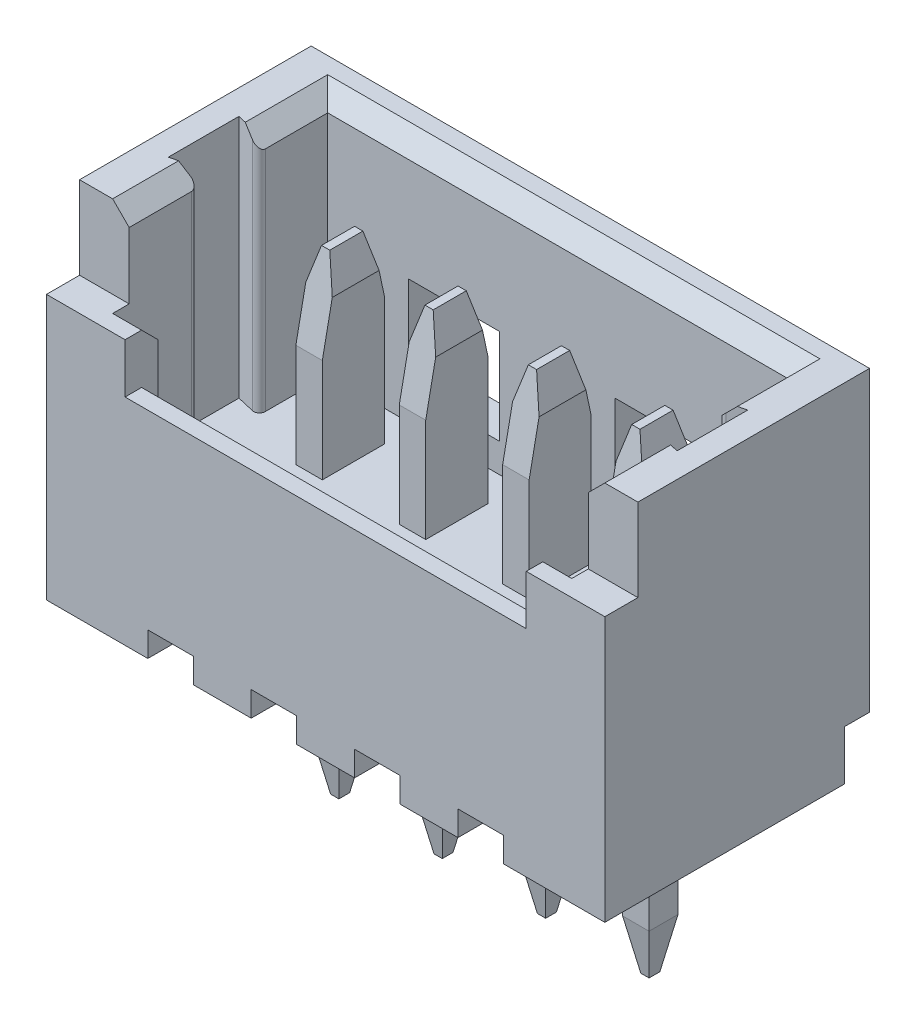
ISO-10303-21;
HEADER;
FILE_DESCRIPTION(('STEP AP214'),'2;1');
FILE_NAME('part.step','',(''),(''),'','','');
FILE_SCHEMA(('AUTOMOTIVE_DESIGN { 1 0 10303 214 1 1 1 1 }'));
ENDSEC;
DATA;
#1=APPLICATION_CONTEXT('core data for automotive mechanical design processes');
#2=APPLICATION_PROTOCOL_DEFINITION('international standard','automotive_design',2000,#1);
#3=PRODUCT_CONTEXT('',#1,'mechanical');
#4=PRODUCT('Part','Part','',(#3));
#5=PRODUCT_RELATED_PRODUCT_CATEGORY('part','',(#4));
#6=PRODUCT_DEFINITION_FORMATION('','',#4);
#7=PRODUCT_DEFINITION_CONTEXT('part definition',#1,'design');
#8=PRODUCT_DEFINITION('design','',#6,#7);
#9=PRODUCT_DEFINITION_SHAPE('','',#8);
#10=(LENGTH_UNIT() NAMED_UNIT(*) SI_UNIT(.MILLI.,.METRE.));
#11=(NAMED_UNIT(*) PLANE_ANGLE_UNIT() SI_UNIT($,.RADIAN.));
#12=(NAMED_UNIT(*) SI_UNIT($,.STERADIAN.) SOLID_ANGLE_UNIT());
#13=UNCERTAINTY_MEASURE_WITH_UNIT(LENGTH_MEASURE(1.E-05),#10,'distance_accuracy_value','');
#14=(GEOMETRIC_REPRESENTATION_CONTEXT(3) GLOBAL_UNCERTAINTY_ASSIGNED_CONTEXT((#13)) GLOBAL_UNIT_ASSIGNED_CONTEXT((#10,
#11,#12)) REPRESENTATION_CONTEXT('',''));
#15=CARTESIAN_POINT('',(0.,0.,0.));
#16=DIRECTION('',(0.,0.,1.));
#17=DIRECTION('',(1.,0.,0.));
#18=AXIS2_PLACEMENT_3D('',#15,#16,#17);
#19=CARTESIAN_POINT('',(-2.8,-2.625,-1.6));
#20=DIRECTION('',(1.,0.,0.));
#21=DIRECTION('',(0.,1.,0.));
#22=AXIS2_PLACEMENT_3D('',#19,#20,#21);
#23=PLANE('',#22);
#24=DIRECTION('',(0.,0.,1.));
#25=VECTOR('',#24,1.);
#26=CARTESIAN_POINT('',(-2.8,-3.225,-1.6));
#27=LINE('',#26,#25);
#28=CARTESIAN_POINT('',(-2.8,-3.225,-1.6));
#29=VERTEX_POINT('',#28);
#30=CARTESIAN_POINT('',(-2.8,-3.225,-1.3));
#31=VERTEX_POINT('',#30);
#32=EDGE_CURVE('E1199',#29,#31,#27,.T.);
#33=ORIENTED_EDGE('',*,*,#32,.T.);
#34=DIRECTION('',(0.,-1.,0.));
#35=VECTOR('',#34,1.);
#36=CARTESIAN_POINT('',(-2.8,-2.625,-1.3));
#37=LINE('',#36,#35);
#38=CARTESIAN_POINT('',(-2.8,-2.625,-1.3));
#39=VERTEX_POINT('',#38);
#40=EDGE_CURVE('E2615',#39,#31,#37,.T.);
#41=ORIENTED_EDGE('',*,*,#40,.F.);
#42=DIRECTION('',(0.,0.,1.));
#43=VECTOR('',#42,1.);
#44=CARTESIAN_POINT('',(-2.8,-2.625,-1.6));
#45=LINE('',#44,#43);
#46=CARTESIAN_POINT('',(-2.8,-2.625,-1.6));
#47=VERTEX_POINT('',#46);
#48=EDGE_CURVE('E11',#47,#39,#45,.T.);
#49=ORIENTED_EDGE('',*,*,#48,.F.);
#50=DIRECTION('',(0.,1.,0.));
#51=VECTOR('',#50,1.);
#52=CARTESIAN_POINT('',(-2.8,-3.225,-1.6));
#53=LINE('',#52,#51);
#54=EDGE_CURVE('E1353',#29,#47,#53,.T.);
#55=ORIENTED_EDGE('',*,*,#54,.F.);
#56=EDGE_LOOP('',(#33,#41,#49,#55));
#57=FACE_BOUND('',#56,.T.);
#58=ADVANCED_FACE('F17',(#57),#23,.F.);
#59=CARTESIAN_POINT('',(-3.375,-2.625,-1.6));
#60=DIRECTION('',(0.,1.,0.));
#61=DIRECTION('',(1.,0.,0.));
#62=AXIS2_PLACEMENT_3D('',#59,#60,#61);
#63=PLANE('',#62);
#64=DIRECTION('',(0.,0.,1.));
#65=VECTOR('',#64,1.);
#66=CARTESIAN_POINT('',(-3.375,-2.625,-1.6));
#67=LINE('',#66,#65);
#68=CARTESIAN_POINT('',(-3.375,-2.625,-1.6));
#69=VERTEX_POINT('',#68);
#70=CARTESIAN_POINT('',(-3.375,-2.625,-1.3));
#71=VERTEX_POINT('',#70);
#72=EDGE_CURVE('E2604',#69,#71,#67,.T.);
#73=ORIENTED_EDGE('',*,*,#72,.F.);
#74=DIRECTION('',(1.,0.,0.));
#75=VECTOR('',#74,1.);
#76=CARTESIAN_POINT('',(-3.375,-2.625,-1.6));
#77=LINE('',#76,#75);
#78=EDGE_CURVE('E1357',#69,#47,#77,.T.);
#79=ORIENTED_EDGE('',*,*,#78,.T.);
#80=ORIENTED_EDGE('',*,*,#48,.T.);
#81=DIRECTION('',(1.,0.,0.));
#82=VECTOR('',#81,1.);
#83=CARTESIAN_POINT('',(-3.375,-2.625,-1.3));
#84=LINE('',#83,#82);
#85=EDGE_CURVE('E2608',#71,#39,#84,.T.);
#86=ORIENTED_EDGE('',*,*,#85,.F.);
#87=EDGE_LOOP('',(#73,#79,#80,#86));
#88=FACE_BOUND('',#87,.T.);
#89=ADVANCED_FACE('F2875',(#88),#63,.F.);
#90=CARTESIAN_POINT('',(1.8,-1.625,-1.6));
#91=DIRECTION('',(0.,-1.,0.));
#92=DIRECTION('',(0.,0.,-1.));
#93=AXIS2_PLACEMENT_3D('',#90,#91,#92);
#94=PLANE('',#93);
#95=DIRECTION('',(-1.,0.,0.));
#96=VECTOR('',#95,1.);
#97=CARTESIAN_POINT('',(1.8,-1.625,-1.6));
#98=LINE('',#97,#96);
#99=CARTESIAN_POINT('',(1.8,-1.625,-1.6));
#100=VERTEX_POINT('',#99);
#101=CARTESIAN_POINT('',(0.7,-1.625,-1.6));
#102=VERTEX_POINT('',#101);
#103=EDGE_CURVE('E1428',#100,#102,#98,.T.);
#104=ORIENTED_EDGE('',*,*,#103,.T.);
#105=DIRECTION('',(0.,0.,1.));
#106=VECTOR('',#105,1.);
#107=CARTESIAN_POINT('',(0.7,-1.625,-1.6));
#108=LINE('',#107,#106);
#109=CARTESIAN_POINT('',(0.7,-1.625,-1.2));
#110=VERTEX_POINT('',#109);
#111=EDGE_CURVE('E25',#102,#110,#108,.T.);
#112=ORIENTED_EDGE('',*,*,#111,.T.);
#113=DIRECTION('',(-1.,0.,0.));
#114=VECTOR('',#113,1.);
#115=CARTESIAN_POINT('',(1.8,-1.625,-1.2));
#116=LINE('',#115,#114);
#117=CARTESIAN_POINT('',(1.8,-1.625,-1.2));
#118=VERTEX_POINT('',#117);
#119=EDGE_CURVE('E1427',#118,#110,#116,.T.);
#120=ORIENTED_EDGE('',*,*,#119,.F.);
#121=DIRECTION('',(0.,0.,1.));
#122=VECTOR('',#121,1.);
#123=CARTESIAN_POINT('',(1.8,-1.625,-1.6));
#124=LINE('',#123,#122);
#125=EDGE_CURVE('E2507',#100,#118,#124,.T.);
#126=ORIENTED_EDGE('',*,*,#125,.F.);
#127=EDGE_LOOP('',(#104,#112,#120,#126));
#128=FACE_BOUND('',#127,.T.);
#129=ADVANCED_FACE('F2520',(#128),#94,.F.);
#130=CARTESIAN_POINT('',(0.7,-1.625,-1.6));
#131=DIRECTION('',(-1.,0.,0.));
#132=DIRECTION('',(0.,0.,1.));
#133=AXIS2_PLACEMENT_3D('',#130,#131,#132);
#134=PLANE('',#133);
#135=DIRECTION('',(0.,-1.,0.));
#136=VECTOR('',#135,1.);
#137=CARTESIAN_POINT('',(0.7,-0.475,-1.6));
#138=LINE('',#137,#136);
#139=CARTESIAN_POINT('',(0.7,-0.475,-1.6));
#140=VERTEX_POINT('',#139);
#141=EDGE_CURVE('E1394',#140,#102,#138,.T.);
#142=ORIENTED_EDGE('',*,*,#141,.F.);
#143=DIRECTION('',(0.,0.,1.));
#144=VECTOR('',#143,1.);
#145=CARTESIAN_POINT('',(0.7,-0.475,-1.6));
#146=LINE('',#145,#144);
#147=CARTESIAN_POINT('',(0.7,-0.475,-1.2));
#148=VERTEX_POINT('',#147);
#149=EDGE_CURVE('E2513',#140,#148,#146,.T.);
#150=ORIENTED_EDGE('',*,*,#149,.T.);
#151=DIRECTION('',(0.,-1.,0.));
#152=VECTOR('',#151,1.);
#153=CARTESIAN_POINT('',(0.7,-0.475,-1.2));
#154=LINE('',#153,#152);
#155=EDGE_CURVE('E1423',#148,#110,#154,.T.);
#156=ORIENTED_EDGE('',*,*,#155,.T.);
#157=ORIENTED_EDGE('',*,*,#111,.F.);
#158=EDGE_LOOP('',(#142,#150,#156,#157));
#159=FACE_BOUND('',#158,.T.);
#160=ADVANCED_FACE('F2527',(#159),#134,.F.);
#161=CARTESIAN_POINT('',(0.7,-0.475,-1.6));
#162=DIRECTION('',(0.,1.,0.));
#163=DIRECTION('',(1.,0.,0.));
#164=AXIS2_PLACEMENT_3D('',#161,#162,#163);
#165=PLANE('',#164);
#166=DIRECTION('',(1.,0.,0.));
#167=VECTOR('',#166,1.);
#168=CARTESIAN_POINT('',(0.7,-0.475,-1.6));
#169=LINE('',#168,#167);
#170=CARTESIAN_POINT('',(1.8,-0.475,-1.6));
#171=VERTEX_POINT('',#170);
#172=EDGE_CURVE('E1390',#140,#171,#169,.T.);
#173=ORIENTED_EDGE('',*,*,#172,.T.);
#174=DIRECTION('',(0.,0.,1.));
#175=VECTOR('',#174,1.);
#176=CARTESIAN_POINT('',(1.8,-0.475,-1.6));
#177=LINE('',#176,#175);
#178=CARTESIAN_POINT('',(1.8,-0.475,-1.2));
#179=VERTEX_POINT('',#178);
#180=EDGE_CURVE('E2510',#171,#179,#177,.T.);
#181=ORIENTED_EDGE('',*,*,#180,.T.);
#182=DIRECTION('',(1.,0.,0.));
#183=VECTOR('',#182,1.);
#184=CARTESIAN_POINT('',(0.7,-0.475,-1.2));
#185=LINE('',#184,#183);
#186=EDGE_CURVE('E1303',#148,#179,#185,.T.);
#187=ORIENTED_EDGE('',*,*,#186,.F.);
#188=ORIENTED_EDGE('',*,*,#149,.F.);
#189=EDGE_LOOP('',(#173,#181,#187,#188));
#190=FACE_BOUND('',#189,.T.);
#191=ADVANCED_FACE('F3201',(#190),#165,.F.);
#192=CARTESIAN_POINT('',(1.8,-0.475,-1.6));
#193=DIRECTION('',(1.,0.,0.));
#194=DIRECTION('',(0.,1.,0.));
#195=AXIS2_PLACEMENT_3D('',#192,#193,#194);
#196=PLANE('',#195);
#197=DIRECTION('',(0.,-1.,0.));
#198=VECTOR('',#197,1.);
#199=CARTESIAN_POINT('',(1.8,-0.475,-1.6));
#200=LINE('',#199,#198);
#201=EDGE_CURVE('E1432',#171,#100,#200,.T.);
#202=ORIENTED_EDGE('',*,*,#201,.T.);
#203=ORIENTED_EDGE('',*,*,#125,.T.);
#204=DIRECTION('',(0.,-1.,0.));
#205=VECTOR('',#204,1.);
#206=CARTESIAN_POINT('',(1.8,-0.475,-1.2));
#207=LINE('',#206,#205);
#208=EDGE_CURVE('E1483',#179,#118,#207,.T.);
#209=ORIENTED_EDGE('',*,*,#208,.F.);
#210=ORIENTED_EDGE('',*,*,#180,.F.);
#211=EDGE_LOOP('',(#202,#203,#209,#210));
#212=FACE_BOUND('',#211,.T.);
#213=ADVANCED_FACE('F3197',(#212),#196,.F.);
#214=CARTESIAN_POINT('',(-1.875,-0.85,-0.075));
#215=DIRECTION('',(0.,0.,1.));
#216=DIRECTION('',(1.,0.,0.));
#217=AXIS2_PLACEMENT_3D('',#214,#215,#216);
#218=PLANE('',#217);
#219=DIRECTION('',(1.,0.,0.));
#220=VECTOR('',#219,1.);
#221=CARTESIAN_POINT('',(-2.035,-0.725,-0.075));
#222=LINE('',#221,#220);
#223=CARTESIAN_POINT('',(-2.035,-0.725,-0.075));
#224=VERTEX_POINT('',#223);
#225=CARTESIAN_POINT('',(-1.715,-0.725,-0.075));
#226=VERTEX_POINT('',#225);
#227=EDGE_CURVE('E2492',#224,#226,#222,.T.);
#228=ORIENTED_EDGE('',*,*,#227,.F.);
#229=DIRECTION('',(0.,1.,0.));
#230=VECTOR('',#229,1.);
#231=CARTESIAN_POINT('',(-2.035,-1.975,-0.075));
#232=LINE('',#231,#230);
#233=CARTESIAN_POINT('',(-2.035,-1.975,-0.075));
#234=VERTEX_POINT('',#233);
#235=EDGE_CURVE('E1813',#234,#224,#232,.T.);
#236=ORIENTED_EDGE('',*,*,#235,.F.);
#237=DIRECTION('',(1.,0.,0.));
#238=VECTOR('',#237,1.);
#239=CARTESIAN_POINT('',(-2.035,-1.975,-0.075));
#240=LINE('',#239,#238);
#241=CARTESIAN_POINT('',(-1.715,-1.975,-0.075));
#242=VERTEX_POINT('',#241);
#243=EDGE_CURVE('E1701',#234,#242,#240,.T.);
#244=ORIENTED_EDGE('',*,*,#243,.T.);
#245=DIRECTION('',(0.,1.,0.));
#246=VECTOR('',#245,1.);
#247=CARTESIAN_POINT('',(-1.715,-1.975,-0.075));
#248=LINE('',#247,#246);
#249=EDGE_CURVE('E2476',#242,#226,#248,.T.);
#250=ORIENTED_EDGE('',*,*,#249,.T.);
#251=EDGE_LOOP('',(#228,#236,#244,#250));
#252=FACE_BOUND('',#251,.T.);
#253=ADVANCED_FACE('F3194',(#252),#218,.T.);
#254=CARTESIAN_POINT('',(-3.375,0.275,-1.6));
#255=DIRECTION('',(0.,1.,0.));
#256=DIRECTION('',(1.,0.,0.));
#257=AXIS2_PLACEMENT_3D('',#254,#255,#256);
#258=PLANE('',#257);
#259=DIRECTION('',(0.,0.,-1.));
#260=VECTOR('',#259,1.);
#261=CARTESIAN_POINT('',(-1.825,0.275,-0.275));
#262=LINE('',#261,#260);
#263=CARTESIAN_POINT('',(-1.825,0.275,-0.275));
#264=VERTEX_POINT('',#263);
#265=CARTESIAN_POINT('',(-1.825,0.275,-0.675));
#266=VERTEX_POINT('',#265);
#267=EDGE_CURVE('E2441',#264,#266,#262,.T.);
#268=ORIENTED_EDGE('',*,*,#267,.T.);
#269=DIRECTION('',(-1.,0.,0.));
#270=VECTOR('',#269,1.);
#271=CARTESIAN_POINT('',(-1.825,0.275,-0.675));
#272=LINE('',#271,#270);
#273=CARTESIAN_POINT('',(-1.925,0.275,-0.675));
#274=VERTEX_POINT('',#273);
#275=EDGE_CURVE('E37',#266,#274,#272,.T.);
#276=ORIENTED_EDGE('',*,*,#275,.T.);
#277=DIRECTION('',(0.,0.,1.));
#278=VECTOR('',#277,1.);
#279=CARTESIAN_POINT('',(-1.925,0.275,-0.675));
#280=LINE('',#279,#278);
#281=CARTESIAN_POINT('',(-1.925,0.275,-0.275));
#282=VERTEX_POINT('',#281);
#283=EDGE_CURVE('E44',#274,#282,#280,.T.);
#284=ORIENTED_EDGE('',*,*,#283,.T.);
#285=DIRECTION('',(1.,0.,0.));
#286=VECTOR('',#285,1.);
#287=CARTESIAN_POINT('',(-1.925,0.275,-0.275));
#288=LINE('',#287,#286);
#289=EDGE_CURVE('E2495',#282,#264,#288,.T.);
#290=ORIENTED_EDGE('',*,*,#289,.T.);
#291=EDGE_LOOP('',(#268,#276,#284,#290));
#292=FACE_BOUND('',#291,.T.);
#293=ADVANCED_FACE('F3190',(#292),#258,.T.);
#294=CARTESIAN_POINT('',(-1.875,-0.85,-0.825));
#295=DIRECTION('',(0.,0.,-1.));
#296=DIRECTION('',(0.,-1.,0.));
#297=AXIS2_PLACEMENT_3D('',#294,#295,#296);
#298=PLANE('',#297);
#299=DIRECTION('',(-1.,0.,0.));
#300=VECTOR('',#299,1.);
#301=CARTESIAN_POINT('',(-1.715,-0.425,-0.825));
#302=LINE('',#301,#300);
#303=CARTESIAN_POINT('',(-1.715,-0.425,-0.825));
#304=VERTEX_POINT('',#303);
#305=CARTESIAN_POINT('',(-2.035,-0.425,-0.825));
#306=VERTEX_POINT('',#305);
#307=EDGE_CURVE('E1233',#304,#306,#302,.T.);
#308=ORIENTED_EDGE('',*,*,#307,.F.);
#309=DIRECTION('',(0.,1.,0.));
#310=VECTOR('',#309,1.);
#311=CARTESIAN_POINT('',(-1.715,-1.975,-0.825));
#312=LINE('',#311,#310);
#313=CARTESIAN_POINT('',(-1.715,-1.975,-0.825));
#314=VERTEX_POINT('',#313);
#315=EDGE_CURVE('E2327',#314,#304,#312,.T.);
#316=ORIENTED_EDGE('',*,*,#315,.F.);
#317=DIRECTION('',(-1.,0.,0.));
#318=VECTOR('',#317,1.);
#319=CARTESIAN_POINT('',(-1.715,-1.975,-0.825));
#320=LINE('',#319,#318);
#321=CARTESIAN_POINT('',(-2.035,-1.975,-0.825));
#322=VERTEX_POINT('',#321);
#323=EDGE_CURVE('E1569',#314,#322,#320,.T.);
#324=ORIENTED_EDGE('',*,*,#323,.T.);
#325=DIRECTION('',(0.,1.,0.));
#326=VECTOR('',#325,1.);
#327=CARTESIAN_POINT('',(-2.035,-1.975,-0.825));
#328=LINE('',#327,#326);
#329=EDGE_CURVE('E1818',#322,#306,#328,.T.);
#330=ORIENTED_EDGE('',*,*,#329,.T.);
#331=EDGE_LOOP('',(#308,#316,#324,#330));
#332=FACE_BOUND('',#331,.T.);
#333=ADVANCED_FACE('F3186',(#332),#298,.T.);
#334=CARTESIAN_POINT('',(-1.875,-0.075,-0.75));
#335=DIRECTION('',(0.,0.209529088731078,-0.977802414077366));
#336=DIRECTION('',(-1.,0.,0.));
#337=AXIS2_PLACEMENT_3D('',#334,#335,#336);
#338=PLANE('',#337);
#339=DIRECTION('',(0.259671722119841,0.94426080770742,0.202341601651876));
#340=VECTOR('',#339,1.);
#341=CARTESIAN_POINT('',(-2.035,-0.125,-0.760714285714));
#342=LINE('',#341,#340);
#343=CARTESIAN_POINT('',(-2.035,-0.125,-0.760714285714));
#344=VERTEX_POINT('',#343);
#345=EDGE_CURVE('E1234',#344,#274,#342,.T.);
#346=ORIENTED_EDGE('',*,*,#345,.T.);
#347=ORIENTED_EDGE('',*,*,#275,.F.);
#348=DIRECTION('',(-0.259671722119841,0.94426080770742,0.202341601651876));
#349=VECTOR('',#348,1.);
#350=CARTESIAN_POINT('',(-1.715,-0.125,-0.760714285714));
#351=LINE('',#350,#349);
#352=CARTESIAN_POINT('',(-1.715,-0.125,-0.760714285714));
#353=VERTEX_POINT('',#352);
#354=EDGE_CURVE('E2437',#353,#266,#351,.T.);
#355=ORIENTED_EDGE('',*,*,#354,.F.);
#356=DIRECTION('',(0.,0.977802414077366,0.209529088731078));
#357=VECTOR('',#356,1.);
#358=CARTESIAN_POINT('',(-1.715,-0.425,-0.825));
#359=LINE('',#358,#357);
#360=EDGE_CURVE('E2322',#304,#353,#359,.T.);
#361=ORIENTED_EDGE('',*,*,#360,.F.);
#362=ORIENTED_EDGE('',*,*,#307,.T.);
#363=DIRECTION('',(0.,-0.977802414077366,-0.209529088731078));
#364=VECTOR('',#363,1.);
#365=CARTESIAN_POINT('',(-2.035,-0.125,-0.760714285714));
#366=LINE('',#365,#364);
#367=EDGE_CURVE('E2397',#344,#306,#366,.T.);
#368=ORIENTED_EDGE('',*,*,#367,.F.);
#369=EDGE_LOOP('',(#346,#347,#355,#361,#362,#368));
#370=FACE_BOUND('',#369,.T.);
#371=ADVANCED_FACE('F3183',(#370),#338,.T.);
#372=CARTESIAN_POINT('',(-1.98,0.075,-0.45));
#373=DIRECTION('',(-0.964205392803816,0.265156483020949,0.));
#374=DIRECTION('',(0.,0.,1.));
#375=AXIS2_PLACEMENT_3D('',#372,#373,#374);
#376=PLANE('',#375);
#377=ORIENTED_EDGE('',*,*,#283,.F.);
#378=ORIENTED_EDGE('',*,*,#345,.F.);
#379=DIRECTION('',(0.,0.,1.));
#380=VECTOR('',#379,1.);
#381=CARTESIAN_POINT('',(-2.035,-0.125,-0.760714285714));
#382=LINE('',#381,#380);
#383=CARTESIAN_POINT('',(-2.035,-0.125,-0.195));
#384=VERTEX_POINT('',#383);
#385=EDGE_CURVE('E2393',#344,#384,#382,.T.);
#386=ORIENTED_EDGE('',*,*,#385,.T.);
#387=DIRECTION('',(0.260359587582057,0.946762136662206,-0.189352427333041));
#388=VECTOR('',#387,1.);
#389=CARTESIAN_POINT('',(-2.035,-0.125,-0.195));
#390=LINE('',#389,#388);
#391=EDGE_CURVE('E2498',#384,#282,#390,.T.);
#392=ORIENTED_EDGE('',*,*,#391,.T.);
#393=EDGE_LOOP('',(#377,#378,#386,#392));
#394=FACE_BOUND('',#393,.T.);
#395=ADVANCED_FACE('F3181',(#394),#376,.T.);
#396=CARTESIAN_POINT('',(-1.875,-0.225,-0.175));
#397=DIRECTION('',(0.,0.196116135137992,0.980580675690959));
#398=DIRECTION('',(1.,0.,0.));
#399=AXIS2_PLACEMENT_3D('',#396,#397,#398);
#400=PLANE('',#399);
#401=DIRECTION('',(0.,0.980580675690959,-0.196116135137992));
#402=VECTOR('',#401,1.);
#403=CARTESIAN_POINT('',(-2.035,-0.725,-0.075));
#404=LINE('',#403,#402);
#405=EDGE_CURVE('E1817',#224,#384,#404,.T.);
#406=ORIENTED_EDGE('',*,*,#405,.F.);
#407=ORIENTED_EDGE('',*,*,#227,.T.);
#408=DIRECTION('',(0.,-0.980580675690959,0.196116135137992));
#409=VECTOR('',#408,1.);
#410=CARTESIAN_POINT('',(-1.715,-0.125,-0.195));
#411=LINE('',#410,#409);
#412=CARTESIAN_POINT('',(-1.715,-0.125,-0.195));
#413=VERTEX_POINT('',#412);
#414=EDGE_CURVE('E2472',#413,#226,#411,.T.);
#415=ORIENTED_EDGE('',*,*,#414,.F.);
#416=DIRECTION('',(-0.260359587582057,0.946762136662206,-0.189352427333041));
#417=VECTOR('',#416,1.);
#418=CARTESIAN_POINT('',(-1.715,-0.125,-0.195));
#419=LINE('',#418,#417);
#420=EDGE_CURVE('E2488',#413,#264,#419,.T.);
#421=ORIENTED_EDGE('',*,*,#420,.T.);
#422=ORIENTED_EDGE('',*,*,#289,.F.);
#423=ORIENTED_EDGE('',*,*,#391,.F.);
#424=EDGE_LOOP('',(#406,#407,#415,#421,#422,#423));
#425=FACE_BOUND('',#424,.T.);
#426=ADVANCED_FACE('F3146',(#425),#400,.T.);
#427=CARTESIAN_POINT('',(-1.77,0.075,-0.45));
#428=DIRECTION('',(0.964205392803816,0.265156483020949,0.));
#429=DIRECTION('',(0.,0.,-1.));
#430=AXIS2_PLACEMENT_3D('',#427,#428,#429);
#431=PLANE('',#430);
#432=DIRECTION('',(0.,0.,-1.));
#433=VECTOR('',#432,1.);
#434=CARTESIAN_POINT('',(-1.715,-0.125,-0.195));
#435=LINE('',#434,#433);
#436=EDGE_CURVE('E2326',#413,#353,#435,.T.);
#437=ORIENTED_EDGE('',*,*,#436,.T.);
#438=ORIENTED_EDGE('',*,*,#354,.T.);
#439=ORIENTED_EDGE('',*,*,#267,.F.);
#440=ORIENTED_EDGE('',*,*,#420,.F.);
#441=EDGE_LOOP('',(#437,#438,#439,#440));
#442=FACE_BOUND('',#441,.T.);
#443=ADVANCED_FACE('F3142',(#442),#431,.T.);
#444=CARTESIAN_POINT('',(-1.715,-4.3,-0.45));
#445=DIRECTION('',(1.,0.,0.));
#446=DIRECTION('',(0.,1.,0.));
#447=AXIS2_PLACEMENT_3D('',#444,#445,#446);
#448=PLANE('',#447);
#449=ORIENTED_EDGE('',*,*,#414,.T.);
#450=ORIENTED_EDGE('',*,*,#249,.F.);
#451=DIRECTION('',(0.,0.,-1.));
#452=VECTOR('',#451,1.);
#453=CARTESIAN_POINT('',(-1.715,-1.975,-0.075));
#454=LINE('',#453,#452);
#455=EDGE_CURVE('E1573',#242,#314,#454,.T.);
#456=ORIENTED_EDGE('',*,*,#455,.T.);
#457=ORIENTED_EDGE('',*,*,#315,.T.);
#458=ORIENTED_EDGE('',*,*,#360,.T.);
#459=ORIENTED_EDGE('',*,*,#436,.F.);
#460=EDGE_LOOP('',(#449,#450,#456,#457,#458,#459));
#461=FACE_BOUND('',#460,.T.);
#462=ADVANCED_FACE('F3145',(#461),#448,.T.);
#463=CARTESIAN_POINT('',(-1.715,-4.3,-0.45));
#464=DIRECTION('',(1.,0.,0.));
#465=DIRECTION('',(0.,1.,0.));
#466=AXIS2_PLACEMENT_3D('',#463,#464,#465);
#467=PLANE('',#466);
#468=DIRECTION('',(0.,0.,1.));
#469=VECTOR('',#468,1.);
#470=CARTESIAN_POINT('',(-1.715,-4.925,-0.625));
#471=LINE('',#470,#469);
#472=CARTESIAN_POINT('',(-1.715,-4.925,-0.625));
#473=VERTEX_POINT('',#472);
#474=CARTESIAN_POINT('',(-1.715,-4.925,-0.275));
#475=VERTEX_POINT('',#474);
#476=EDGE_CURVE('E2469',#473,#475,#471,.T.);
#477=ORIENTED_EDGE('',*,*,#476,.F.);
#478=DIRECTION('',(0.,1.,0.));
#479=VECTOR('',#478,1.);
#480=CARTESIAN_POINT('',(-1.715,-4.925,-0.625));
#481=LINE('',#480,#479);
#482=CARTESIAN_POINT('',(-1.715,-3.125,-0.625));
#483=VERTEX_POINT('',#482);
#484=EDGE_CURVE('E2451',#473,#483,#481,.T.);
#485=ORIENTED_EDGE('',*,*,#484,.T.);
#486=DIRECTION('',(0.,0.,-1.));
#487=VECTOR('',#486,1.);
#488=CARTESIAN_POINT('',(-1.715,-3.125,-0.275));
#489=LINE('',#488,#487);
#490=CARTESIAN_POINT('',(-1.715,-3.125,-0.275));
#491=VERTEX_POINT('',#490);
#492=EDGE_CURVE('E2428',#491,#483,#489,.T.);
#493=ORIENTED_EDGE('',*,*,#492,.F.);
#494=DIRECTION('',(0.,1.,0.));
#495=VECTOR('',#494,1.);
#496=CARTESIAN_POINT('',(-1.715,-4.925,-0.275));
#497=LINE('',#496,#495);
#498=EDGE_CURVE('E1804',#475,#491,#497,.T.);
#499=ORIENTED_EDGE('',*,*,#498,.F.);
#500=EDGE_LOOP('',(#477,#485,#493,#499));
#501=FACE_BOUND('',#500,.T.);
#502=ADVANCED_FACE('F3172',(#501),#467,.T.);
#503=CARTESIAN_POINT('',(-1.77,-5.225,-0.45));
#504=DIRECTION('',(0.983606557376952,-0.180327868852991,0.));
#505=DIRECTION('',(0.,0.,-1.));
#506=AXIS2_PLACEMENT_3D('',#503,#504,#505);
#507=PLANE('',#506);
#508=DIRECTION('',(-0.177465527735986,-0.967993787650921,-0.177465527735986));
#509=VECTOR('',#508,1.);
#510=CARTESIAN_POINT('',(-1.715,-4.925,-0.275));
#511=LINE('',#510,#509);
#512=CARTESIAN_POINT('',(-1.825,-5.525,-0.385));
#513=VERTEX_POINT('',#512);
#514=EDGE_CURVE('E2237',#475,#513,#511,.T.);
#515=ORIENTED_EDGE('',*,*,#514,.T.);
#516=DIRECTION('',(0.,0.,1.));
#517=VECTOR('',#516,1.);
#518=CARTESIAN_POINT('',(-1.825,-5.525,-0.515));
#519=LINE('',#518,#517);
#520=CARTESIAN_POINT('',(-1.825,-5.525,-0.515));
#521=VERTEX_POINT('',#520);
#522=EDGE_CURVE('E2466',#521,#513,#519,.T.);
#523=ORIENTED_EDGE('',*,*,#522,.F.);
#524=DIRECTION('',(-0.177465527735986,-0.967993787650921,0.177465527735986));
#525=VECTOR('',#524,1.);
#526=CARTESIAN_POINT('',(-1.715,-4.925,-0.625));
#527=LINE('',#526,#525);
#528=EDGE_CURVE('E2458',#473,#521,#527,.T.);
#529=ORIENTED_EDGE('',*,*,#528,.F.);
#530=ORIENTED_EDGE('',*,*,#476,.T.);
#531=EDGE_LOOP('',(#515,#523,#529,#530));
#532=FACE_BOUND('',#531,.T.);
#533=ADVANCED_FACE('F3170',(#532),#507,.T.);
#534=CARTESIAN_POINT('',(-3.375,-5.525,-1.6));
#535=DIRECTION('',(0.,1.,0.));
#536=DIRECTION('',(1.,0.,0.));
#537=AXIS2_PLACEMENT_3D('',#534,#535,#536);
#538=PLANE('',#537);
#539=DIRECTION('',(1.,0.,0.));
#540=VECTOR('',#539,1.);
#541=CARTESIAN_POINT('',(-1.925,-5.525,-0.515));
#542=LINE('',#541,#540);
#543=CARTESIAN_POINT('',(-1.925,-5.525,-0.515));
#544=VERTEX_POINT('',#543);
#545=EDGE_CURVE('E2462',#544,#521,#542,.T.);
#546=ORIENTED_EDGE('',*,*,#545,.T.);
#547=ORIENTED_EDGE('',*,*,#522,.T.);
#548=DIRECTION('',(-1.,0.,0.));
#549=VECTOR('',#548,1.);
#550=CARTESIAN_POINT('',(-1.825,-5.525,-0.385));
#551=LINE('',#550,#549);
#552=CARTESIAN_POINT('',(-1.925,-5.525,-0.385));
#553=VERTEX_POINT('',#552);
#554=EDGE_CURVE('E2413',#513,#553,#551,.T.);
#555=ORIENTED_EDGE('',*,*,#554,.T.);
#556=DIRECTION('',(0.,0.,-1.));
#557=VECTOR('',#556,1.);
#558=CARTESIAN_POINT('',(-1.925,-5.525,-0.385));
#559=LINE('',#558,#557);
#560=EDGE_CURVE('E2405',#553,#544,#559,.T.);
#561=ORIENTED_EDGE('',*,*,#560,.T.);
#562=EDGE_LOOP('',(#546,#547,#555,#561));
#563=FACE_BOUND('',#562,.T.);
#564=ADVANCED_FACE('F3166',(#563),#538,.F.);
#565=CARTESIAN_POINT('',(-1.875,-5.225,-0.57));
#566=DIRECTION('',(0.,-0.180327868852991,-0.983606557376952));
#567=DIRECTION('',(0.,-0.983606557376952,0.180327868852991));
#568=AXIS2_PLACEMENT_3D('',#565,#566,#567);
#569=PLANE('',#568);
#570=DIRECTION('',(1.,0.,0.));
#571=VECTOR('',#570,1.);
#572=CARTESIAN_POINT('',(-2.035,-4.925,-0.625));
#573=LINE('',#572,#571);
#574=CARTESIAN_POINT('',(-2.035,-4.925,-0.625));
#575=VERTEX_POINT('',#574);
#576=EDGE_CURVE('E2454',#575,#473,#573,.T.);
#577=ORIENTED_EDGE('',*,*,#576,.T.);
#578=ORIENTED_EDGE('',*,*,#528,.T.);
#579=ORIENTED_EDGE('',*,*,#545,.F.);
#580=DIRECTION('',(0.177465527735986,-0.967993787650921,0.177465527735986));
#581=VECTOR('',#580,1.);
#582=CARTESIAN_POINT('',(-2.035,-4.925,-0.625));
#583=LINE('',#582,#581);
#584=EDGE_CURVE('E2401',#575,#544,#583,.T.);
#585=ORIENTED_EDGE('',*,*,#584,.F.);
#586=EDGE_LOOP('',(#577,#578,#579,#585));
#587=FACE_BOUND('',#586,.T.);
#588=ADVANCED_FACE('F3162',(#587),#569,.T.);
#589=CARTESIAN_POINT('',(-1.875,-4.3,-0.625));
#590=DIRECTION('',(0.,0.,-1.));
#591=DIRECTION('',(0.,-1.,0.));
#592=AXIS2_PLACEMENT_3D('',#589,#590,#591);
#593=PLANE('',#592);
#594=DIRECTION('',(0.,1.,0.));
#595=VECTOR('',#594,1.);
#596=CARTESIAN_POINT('',(-2.035,-4.925,-0.625));
#597=LINE('',#596,#595);
#598=CARTESIAN_POINT('',(-2.035,-3.125,-0.625));
#599=VERTEX_POINT('',#598);
#600=EDGE_CURVE('E2382',#575,#599,#597,.T.);
#601=ORIENTED_EDGE('',*,*,#600,.T.);
#602=DIRECTION('',(-1.,0.,0.));
#603=VECTOR('',#602,1.);
#604=CARTESIAN_POINT('',(-1.715,-3.125,-0.625));
#605=LINE('',#604,#603);
#606=EDGE_CURVE('E2432',#483,#599,#605,.T.);
#607=ORIENTED_EDGE('',*,*,#606,.F.);
#608=ORIENTED_EDGE('',*,*,#484,.F.);
#609=ORIENTED_EDGE('',*,*,#576,.F.);
#610=EDGE_LOOP('',(#601,#607,#608,#609));
#611=FACE_BOUND('',#610,.T.);
#612=ADVANCED_FACE('F3159',(#611),#593,.T.);
#613=CARTESIAN_POINT('',(-1.6,-3.125,0.4));
#614=DIRECTION('',(0.,0.,-1.));
#615=DIRECTION('',(0.,-1.,0.));
#616=AXIS2_PLACEMENT_3D('',#613,#614,#615);
#617=PLANE('',#616);
#618=DIRECTION('',(0.,1.,0.));
#619=VECTOR('',#618,1.);
#620=CARTESIAN_POINT('',(-1.6,-3.125,0.4));
#621=LINE('',#620,#619);
#622=CARTESIAN_POINT('',(-1.6,-3.125,0.4));
#623=VERTEX_POINT('',#622);
#624=CARTESIAN_POINT('',(-1.6,-2.925,0.4));
#625=VERTEX_POINT('',#624);
#626=EDGE_CURVE('E1328',#623,#625,#621,.T.);
#627=ORIENTED_EDGE('',*,*,#626,.T.);
#628=DIRECTION('',(-1.,0.,0.));
#629=VECTOR('',#628,1.);
#630=CARTESIAN_POINT('',(-1.6,-2.925,0.4));
#631=LINE('',#630,#629);
#632=CARTESIAN_POINT('',(-2.15,-2.925,0.4));
#633=VERTEX_POINT('',#632);
#634=EDGE_CURVE('E2448',#625,#633,#631,.T.);
#635=ORIENTED_EDGE('',*,*,#634,.T.);
#636=DIRECTION('',(0.,1.,0.));
#637=VECTOR('',#636,1.);
#638=CARTESIAN_POINT('',(-2.15,-3.125,0.4));
#639=LINE('',#638,#637);
#640=CARTESIAN_POINT('',(-2.15,-3.125,0.4));
#641=VERTEX_POINT('',#640);
#642=EDGE_CURVE('E2436',#641,#633,#639,.T.);
#643=ORIENTED_EDGE('',*,*,#642,.F.);
#644=DIRECTION('',(-1.,0.,0.));
#645=VECTOR('',#644,1.);
#646=CARTESIAN_POINT('',(-1.6,-3.125,0.4));
#647=LINE('',#646,#645);
#648=EDGE_CURVE('E2106',#623,#641,#647,.T.);
#649=ORIENTED_EDGE('',*,*,#648,.F.);
#650=EDGE_LOOP('',(#627,#635,#643,#649));
#651=FACE_BOUND('',#650,.T.);
#652=ADVANCED_FACE('F2797',(#651),#617,.F.);
#653=CARTESIAN_POINT('',(-1.6,-2.925,0.4));
#654=DIRECTION('',(0.,1.,0.));
#655=DIRECTION('',(1.,0.,0.));
#656=AXIS2_PLACEMENT_3D('',#653,#654,#655);
#657=PLANE('',#656);
#658=DIRECTION('',(0.,0.,1.));
#659=VECTOR('',#658,1.);
#660=CARTESIAN_POINT('',(-1.6,-2.925,0.4));
#661=LINE('',#660,#659);
#662=CARTESIAN_POINT('',(-1.6,-2.925,1.6));
#663=VERTEX_POINT('',#662);
#664=EDGE_CURVE('E1257',#625,#663,#661,.T.);
#665=ORIENTED_EDGE('',*,*,#664,.T.);
#666=DIRECTION('',(1.,0.,0.));
#667=VECTOR('',#666,1.);
#668=CARTESIAN_POINT('',(-2.15,-2.925,1.6));
#669=LINE('',#668,#667);
#670=CARTESIAN_POINT('',(-2.15,-2.925,1.6));
#671=VERTEX_POINT('',#670);
#672=EDGE_CURVE('E1323',#671,#663,#669,.T.);
#673=ORIENTED_EDGE('',*,*,#672,.F.);
#674=DIRECTION('',(0.,0.,1.));
#675=VECTOR('',#674,1.);
#676=CARTESIAN_POINT('',(-2.15,-2.925,0.4));
#677=LINE('',#676,#675);
#678=EDGE_CURVE('E2445',#633,#671,#677,.T.);
#679=ORIENTED_EDGE('',*,*,#678,.F.);
#680=ORIENTED_EDGE('',*,*,#634,.F.);
#681=EDGE_LOOP('',(#665,#673,#679,#680));
#682=FACE_BOUND('',#681,.T.);
#683=ADVANCED_FACE('F2799',(#682),#657,.F.);
#684=CARTESIAN_POINT('',(-2.15,0.,0.));
#685=DIRECTION('',(1.,0.,0.));
#686=DIRECTION('',(0.,1.,0.));
#687=AXIS2_PLACEMENT_3D('',#684,#685,#686);
#688=PLANE('',#687);
#689=DIRECTION('',(0.,-1.,0.));
#690=VECTOR('',#689,1.);
#691=CARTESIAN_POINT('',(-2.15,-2.625,-1.3));
#692=LINE('',#691,#690);
#693=CARTESIAN_POINT('',(-2.15,-2.625,-1.3));
#694=VERTEX_POINT('',#693);
#695=CARTESIAN_POINT('',(-2.15,-3.125,-1.3));
#696=VERTEX_POINT('',#695);
#697=EDGE_CURVE('E2433',#694,#696,#692,.T.);
#698=ORIENTED_EDGE('',*,*,#697,.T.);
#699=DIRECTION('',(0.,0.,1.));
#700=VECTOR('',#699,1.);
#701=CARTESIAN_POINT('',(-2.15,-3.125,-1.3));
#702=LINE('',#701,#700);
#703=EDGE_CURVE('E2101',#696,#641,#702,.T.);
#704=ORIENTED_EDGE('',*,*,#703,.T.);
#705=ORIENTED_EDGE('',*,*,#642,.T.);
#706=ORIENTED_EDGE('',*,*,#678,.T.);
#707=DIRECTION('',(0.,1.,0.));
#708=VECTOR('',#707,1.);
#709=CARTESIAN_POINT('',(-2.15,-3.225,1.6));
#710=LINE('',#709,#708);
#711=CARTESIAN_POINT('',(-2.15,-3.225,1.6));
#712=VERTEX_POINT('',#711);
#713=EDGE_CURVE('E1319',#712,#671,#710,.T.);
#714=ORIENTED_EDGE('',*,*,#713,.F.);
#715=DIRECTION('',(0.,0.,-1.));
#716=VECTOR('',#715,1.);
#717=CARTESIAN_POINT('',(-2.15,-3.225,1.6));
#718=LINE('',#717,#716);
#719=CARTESIAN_POINT('',(-2.15,-3.225,-1.6));
#720=VERTEX_POINT('',#719);
#721=EDGE_CURVE('E1210',#712,#720,#718,.T.);
#722=ORIENTED_EDGE('',*,*,#721,.T.);
#723=DIRECTION('',(0.,1.,0.));
#724=VECTOR('',#723,1.);
#725=CARTESIAN_POINT('',(-2.15,-3.225,-1.6));
#726=LINE('',#725,#724);
#727=CARTESIAN_POINT('',(-2.15,-2.625,-1.6));
#728=VERTEX_POINT('',#727);
#729=EDGE_CURVE('E1350',#720,#728,#726,.T.);
#730=ORIENTED_EDGE('',*,*,#729,.T.);
#731=DIRECTION('',(0.,0.,1.));
#732=VECTOR('',#731,1.);
#733=CARTESIAN_POINT('',(-2.15,-2.625,-1.6));
#734=LINE('',#733,#732);
#735=EDGE_CURVE('E1346',#728,#694,#734,.T.);
#736=ORIENTED_EDGE('',*,*,#735,.T.);
#737=EDGE_LOOP('',(#698,#704,#705,#706,#714,#722,#730,#736));
#738=FACE_BOUND('',#737,.T.);
#739=ADVANCED_FACE('F2779',(#738),#688,.T.);
#740=CARTESIAN_POINT('',(-1.6,-2.625,-1.3));
#741=DIRECTION('',(0.,0.,1.));
#742=DIRECTION('',(1.,0.,0.));
#743=AXIS2_PLACEMENT_3D('',#740,#741,#742);
#744=PLANE('',#743);
#745=DIRECTION('',(0.,-1.,0.));
#746=VECTOR('',#745,1.);
#747=CARTESIAN_POINT('',(-1.6,-2.625,-1.3));
#748=LINE('',#747,#746);
#749=CARTESIAN_POINT('',(-1.6,-2.625,-1.3));
#750=VERTEX_POINT('',#749);
#751=CARTESIAN_POINT('',(-1.6,-3.125,-1.3));
#752=VERTEX_POINT('',#751);
#753=EDGE_CURVE('E1338',#750,#752,#748,.T.);
#754=ORIENTED_EDGE('',*,*,#753,.T.);
#755=DIRECTION('',(-1.,0.,0.));
#756=VECTOR('',#755,1.);
#757=CARTESIAN_POINT('',(-1.6,-3.125,-1.3));
#758=LINE('',#757,#756);
#759=EDGE_CURVE('E2105',#752,#696,#758,.T.);
#760=ORIENTED_EDGE('',*,*,#759,.T.);
#761=ORIENTED_EDGE('',*,*,#697,.F.);
#762=DIRECTION('',(-1.,0.,0.));
#763=VECTOR('',#762,1.);
#764=CARTESIAN_POINT('',(-1.6,-2.625,-1.3));
#765=LINE('',#764,#763);
#766=EDGE_CURVE('E1342',#750,#694,#765,.T.);
#767=ORIENTED_EDGE('',*,*,#766,.F.);
#768=EDGE_LOOP('',(#754,#760,#761,#767));
#769=FACE_BOUND('',#768,.T.);
#770=ADVANCED_FACE('F2785',(#769),#744,.F.);
#771=CARTESIAN_POINT('',(-1.6,-3.125,-1.3));
#772=DIRECTION('',(0.,1.,0.));
#773=DIRECTION('',(1.,0.,0.));
#774=AXIS2_PLACEMENT_3D('',#771,#772,#773);
#775=PLANE('',#774);
#776=DIRECTION('',(0.,0.,1.));
#777=VECTOR('',#776,1.);
#778=CARTESIAN_POINT('',(-2.035,-3.125,-0.625));
#779=LINE('',#778,#777);
#780=CARTESIAN_POINT('',(-2.035,-3.125,-0.275));
#781=VERTEX_POINT('',#780);
#782=EDGE_CURVE('E2378',#599,#781,#779,.T.);
#783=ORIENTED_EDGE('',*,*,#782,.T.);
#784=DIRECTION('',(1.,0.,0.));
#785=VECTOR('',#784,1.);
#786=CARTESIAN_POINT('',(-2.035,-3.125,-0.275));
#787=LINE('',#786,#785);
#788=EDGE_CURVE('E1808',#781,#491,#787,.T.);
#789=ORIENTED_EDGE('',*,*,#788,.T.);
#790=ORIENTED_EDGE('',*,*,#492,.T.);
#791=ORIENTED_EDGE('',*,*,#606,.T.);
#792=EDGE_LOOP('',(#783,#789,#790,#791));
#793=FACE_BOUND('',#792,.T.);
#794=DIRECTION('',(0.,0.,1.));
#795=VECTOR('',#794,1.);
#796=CARTESIAN_POINT('',(-1.6,-3.125,-1.3));
#797=LINE('',#796,#795);
#798=EDGE_CURVE('E1337',#752,#623,#797,.T.);
#799=ORIENTED_EDGE('',*,*,#798,.T.);
#800=ORIENTED_EDGE('',*,*,#648,.T.);
#801=ORIENTED_EDGE('',*,*,#703,.F.);
#802=ORIENTED_EDGE('',*,*,#759,.F.);
#803=EDGE_LOOP('',(#799,#800,#801,#802));
#804=FACE_BOUND('',#803,.T.);
#805=ADVANCED_FACE('F2792',(#793,#804),#775,.F.);
#806=CARTESIAN_POINT('',(-1.875,-4.3,-0.275));
#807=DIRECTION('',(0.,0.,1.));
#808=DIRECTION('',(1.,0.,0.));
#809=AXIS2_PLACEMENT_3D('',#806,#807,#808);
#810=PLANE('',#809);
#811=ORIENTED_EDGE('',*,*,#498,.T.);
#812=ORIENTED_EDGE('',*,*,#788,.F.);
#813=DIRECTION('',(0.,1.,0.));
#814=VECTOR('',#813,1.);
#815=CARTESIAN_POINT('',(-2.035,-4.925,-0.275));
#816=LINE('',#815,#814);
#817=CARTESIAN_POINT('',(-2.035,-4.925,-0.275));
#818=VERTEX_POINT('',#817);
#819=EDGE_CURVE('E1658',#818,#781,#816,.T.);
#820=ORIENTED_EDGE('',*,*,#819,.F.);
#821=DIRECTION('',(-1.,0.,0.));
#822=VECTOR('',#821,1.);
#823=CARTESIAN_POINT('',(-1.715,-4.925,-0.275));
#824=LINE('',#823,#822);
#825=EDGE_CURVE('E1809',#475,#818,#824,.T.);
#826=ORIENTED_EDGE('',*,*,#825,.F.);
#827=EDGE_LOOP('',(#811,#812,#820,#826));
#828=FACE_BOUND('',#827,.T.);
#829=ADVANCED_FACE('F3137',(#828),#810,.T.);
#830=CARTESIAN_POINT('',(-1.875,-5.225,-0.33));
#831=DIRECTION('',(0.,-0.180327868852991,0.983606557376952));
#832=DIRECTION('',(-1.,0.,0.));
#833=AXIS2_PLACEMENT_3D('',#830,#831,#832);
#834=PLANE('',#833);
#835=ORIENTED_EDGE('',*,*,#554,.F.);
#836=ORIENTED_EDGE('',*,*,#514,.F.);
#837=ORIENTED_EDGE('',*,*,#825,.T.);
#838=DIRECTION('',(0.177465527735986,-0.967993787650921,-0.177465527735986));
#839=VECTOR('',#838,1.);
#840=CARTESIAN_POINT('',(-2.035,-4.925,-0.275));
#841=LINE('',#840,#839);
#842=EDGE_CURVE('E2409',#818,#553,#841,.T.);
#843=ORIENTED_EDGE('',*,*,#842,.T.);
#844=EDGE_LOOP('',(#835,#836,#837,#843));
#845=FACE_BOUND('',#844,.T.);
#846=ADVANCED_FACE('F3133',(#845),#834,.T.);
#847=CARTESIAN_POINT('',(-1.98,-5.225,-0.45));
#848=DIRECTION('',(-0.983606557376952,-0.180327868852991,0.));
#849=DIRECTION('',(-0.180327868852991,0.983606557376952,0.));
#850=AXIS2_PLACEMENT_3D('',#847,#848,#849);
#851=PLANE('',#850);
#852=DIRECTION('',(0.,0.,-1.));
#853=VECTOR('',#852,1.);
#854=CARTESIAN_POINT('',(-2.035,-4.925,-0.275));
#855=LINE('',#854,#853);
#856=EDGE_CURVE('E2383',#818,#575,#855,.T.);
#857=ORIENTED_EDGE('',*,*,#856,.T.);
#858=ORIENTED_EDGE('',*,*,#584,.T.);
#859=ORIENTED_EDGE('',*,*,#560,.F.);
#860=ORIENTED_EDGE('',*,*,#842,.F.);
#861=EDGE_LOOP('',(#857,#858,#859,#860));
#862=FACE_BOUND('',#861,.T.);
#863=ADVANCED_FACE('F3129',(#862),#851,.T.);
#864=CARTESIAN_POINT('',(-2.035,-4.3,-0.45));
#865=DIRECTION('',(-1.,0.,0.));
#866=DIRECTION('',(0.,0.,1.));
#867=AXIS2_PLACEMENT_3D('',#864,#865,#866);
#868=PLANE('',#867);
#869=ORIENTED_EDGE('',*,*,#329,.F.);
#870=DIRECTION('',(0.,0.,1.));
#871=VECTOR('',#870,1.);
#872=CARTESIAN_POINT('',(-2.035,-1.975,-0.825));
#873=LINE('',#872,#871);
#874=EDGE_CURVE('E1705',#322,#234,#873,.T.);
#875=ORIENTED_EDGE('',*,*,#874,.T.);
#876=ORIENTED_EDGE('',*,*,#235,.T.);
#877=ORIENTED_EDGE('',*,*,#405,.T.);
#878=ORIENTED_EDGE('',*,*,#385,.F.);
#879=ORIENTED_EDGE('',*,*,#367,.T.);
#880=EDGE_LOOP('',(#869,#875,#876,#877,#878,#879));
#881=FACE_BOUND('',#880,.T.);
#882=ADVANCED_FACE('F3126',(#881),#868,.T.);
#883=CARTESIAN_POINT('',(-2.035,-4.3,-0.45));
#884=DIRECTION('',(-1.,0.,0.));
#885=DIRECTION('',(0.,0.,1.));
#886=AXIS2_PLACEMENT_3D('',#883,#884,#885);
#887=PLANE('',#886);
#888=ORIENTED_EDGE('',*,*,#819,.T.);
#889=ORIENTED_EDGE('',*,*,#782,.F.);
#890=ORIENTED_EDGE('',*,*,#600,.F.);
#891=ORIENTED_EDGE('',*,*,#856,.F.);
#892=EDGE_LOOP('',(#888,#889,#890,#891));
#893=FACE_BOUND('',#892,.T.);
#894=ADVANCED_FACE('F3082',(#893),#887,.T.);
#895=CARTESIAN_POINT('',(-0.625,-0.85,-0.075));
#896=DIRECTION('',(0.,0.,1.));
#897=DIRECTION('',(1.,0.,0.));
#898=AXIS2_PLACEMENT_3D('',#895,#896,#897);
#899=PLANE('',#898);
#900=DIRECTION('',(1.,0.,0.));
#901=VECTOR('',#900,1.);
#902=CARTESIAN_POINT('',(-0.785,-0.725,-0.075));
#903=LINE('',#902,#901);
#904=CARTESIAN_POINT('',(-0.785,-0.725,-0.075));
#905=VERTEX_POINT('',#904);
#906=CARTESIAN_POINT('',(-0.465,-0.725,-0.075));
#907=VERTEX_POINT('',#906);
#908=EDGE_CURVE('E2361',#905,#907,#903,.T.);
#909=ORIENTED_EDGE('',*,*,#908,.F.);
#910=DIRECTION('',(0.,1.,0.));
#911=VECTOR('',#910,1.);
#912=CARTESIAN_POINT('',(-0.785,-1.975,-0.075));
#913=LINE('',#912,#911);
#914=CARTESIAN_POINT('',(-0.785,-1.975,-0.075));
#915=VERTEX_POINT('',#914);
#916=EDGE_CURVE('E2230',#915,#905,#913,.T.);
#917=ORIENTED_EDGE('',*,*,#916,.F.);
#918=DIRECTION('',(1.,0.,0.));
#919=VECTOR('',#918,1.);
#920=CARTESIAN_POINT('',(-0.785,-1.975,-0.075));
#921=LINE('',#920,#919);
#922=CARTESIAN_POINT('',(-0.465,-1.975,-0.075));
#923=VERTEX_POINT('',#922);
#924=EDGE_CURVE('E1453',#915,#923,#921,.T.);
#925=ORIENTED_EDGE('',*,*,#924,.T.);
#926=DIRECTION('',(0.,1.,0.));
#927=VECTOR('',#926,1.);
#928=CARTESIAN_POINT('',(-0.465,-1.975,-0.075));
#929=LINE('',#928,#927);
#930=EDGE_CURVE('E2205',#923,#907,#929,.T.);
#931=ORIENTED_EDGE('',*,*,#930,.T.);
#932=EDGE_LOOP('',(#909,#917,#925,#931));
#933=FACE_BOUND('',#932,.T.);
#934=ADVANCED_FACE('F3018',(#933),#899,.T.);
#935=CARTESIAN_POINT('',(-3.375,0.275,-1.6));
#936=DIRECTION('',(0.,1.,0.));
#937=DIRECTION('',(1.,0.,0.));
#938=AXIS2_PLACEMENT_3D('',#935,#936,#937);
#939=PLANE('',#938);
#940=DIRECTION('',(0.,0.,-1.));
#941=VECTOR('',#940,1.);
#942=CARTESIAN_POINT('',(-0.575,0.275,-0.275));
#943=LINE('',#942,#941);
#944=CARTESIAN_POINT('',(-0.575,0.275,-0.275));
#945=VERTEX_POINT('',#944);
#946=CARTESIAN_POINT('',(-0.575,0.275,-0.675));
#947=VERTEX_POINT('',#946);
#948=EDGE_CURVE('E2353',#945,#947,#943,.T.);
#949=ORIENTED_EDGE('',*,*,#948,.T.);
#950=DIRECTION('',(-1.,0.,0.));
#951=VECTOR('',#950,1.);
#952=CARTESIAN_POINT('',(-0.575,0.275,-0.675));
#953=LINE('',#952,#951);
#954=CARTESIAN_POINT('',(-0.675,0.275,-0.675));
#955=VERTEX_POINT('',#954);
#956=EDGE_CURVE('E1659',#947,#955,#953,.T.);
#957=ORIENTED_EDGE('',*,*,#956,.T.);
#958=DIRECTION('',(0.,0.,1.));
#959=VECTOR('',#958,1.);
#960=CARTESIAN_POINT('',(-0.675,0.275,-0.675));
#961=LINE('',#960,#959);
#962=CARTESIAN_POINT('',(-0.675,0.275,-0.275));
#963=VERTEX_POINT('',#962);
#964=EDGE_CURVE('E2288',#955,#963,#961,.T.);
#965=ORIENTED_EDGE('',*,*,#964,.T.);
#966=DIRECTION('',(1.,0.,0.));
#967=VECTOR('',#966,1.);
#968=CARTESIAN_POINT('',(-0.675,0.275,-0.275));
#969=LINE('',#968,#967);
#970=EDGE_CURVE('E2364',#963,#945,#969,.T.);
#971=ORIENTED_EDGE('',*,*,#970,.T.);
#972=EDGE_LOOP('',(#949,#957,#965,#971));
#973=FACE_BOUND('',#972,.T.);
#974=ADVANCED_FACE('F3015',(#973),#939,.T.);
#975=CARTESIAN_POINT('',(-0.625,-0.85,-0.825));
#976=DIRECTION('',(0.,0.,-1.));
#977=DIRECTION('',(0.,-1.,0.));
#978=AXIS2_PLACEMENT_3D('',#975,#976,#977);
#979=PLANE('',#978);
#980=DIRECTION('',(-1.,0.,0.));
#981=VECTOR('',#980,1.);
#982=CARTESIAN_POINT('',(-0.465,-0.425,-0.825));
#983=LINE('',#982,#981);
#984=CARTESIAN_POINT('',(-0.465,-0.425,-0.825));
#985=VERTEX_POINT('',#984);
#986=CARTESIAN_POINT('',(-0.785,-0.425,-0.825));
#987=VERTEX_POINT('',#986);
#988=EDGE_CURVE('E1655',#985,#987,#983,.T.);
#989=ORIENTED_EDGE('',*,*,#988,.F.);
#990=DIRECTION('',(0.,1.,0.));
#991=VECTOR('',#990,1.);
#992=CARTESIAN_POINT('',(-0.465,-1.975,-0.825));
#993=LINE('',#992,#991);
#994=CARTESIAN_POINT('',(-0.465,-1.975,-0.825));
#995=VERTEX_POINT('',#994);
#996=EDGE_CURVE('E2200',#995,#985,#993,.T.);
#997=ORIENTED_EDGE('',*,*,#996,.F.);
#998=DIRECTION('',(-1.,0.,0.));
#999=VECTOR('',#998,1.);
#1000=CARTESIAN_POINT('',(-0.465,-1.975,-0.825));
#1001=LINE('',#1000,#999);
#1002=CARTESIAN_POINT('',(-0.785,-1.975,-0.825));
#1003=VERTEX_POINT('',#1002);
#1004=EDGE_CURVE('E1688',#995,#1003,#1001,.T.);
#1005=ORIENTED_EDGE('',*,*,#1004,.T.);
#1006=DIRECTION('',(0.,1.,0.));
#1007=VECTOR('',#1006,1.);
#1008=CARTESIAN_POINT('',(-0.785,-1.975,-0.825));
#1009=LINE('',#1008,#1007);
#1010=EDGE_CURVE('E1475',#1003,#987,#1009,.T.);
#1011=ORIENTED_EDGE('',*,*,#1010,.T.);
#1012=EDGE_LOOP('',(#989,#997,#1005,#1011));
#1013=FACE_BOUND('',#1012,.T.);
#1014=ADVANCED_FACE('F2948',(#1013),#979,.T.);
#1015=CARTESIAN_POINT('',(-0.625,-0.075,-0.75));
#1016=DIRECTION('',(0.,0.209529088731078,-0.977802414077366));
#1017=DIRECTION('',(-1.,0.,0.));
#1018=AXIS2_PLACEMENT_3D('',#1015,#1016,#1017);
#1019=PLANE('',#1018);
#1020=DIRECTION('',(0.259671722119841,0.94426080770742,0.202341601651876));
#1021=VECTOR('',#1020,1.);
#1022=CARTESIAN_POINT('',(-0.785,-0.125,-0.760714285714));
#1023=LINE('',#1022,#1021);
#1024=CARTESIAN_POINT('',(-0.785,-0.125,-0.760714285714));
#1025=VERTEX_POINT('',#1024);
#1026=EDGE_CURVE('E2284',#1025,#955,#1023,.T.);
#1027=ORIENTED_EDGE('',*,*,#1026,.T.);
#1028=ORIENTED_EDGE('',*,*,#956,.F.);
#1029=DIRECTION('',(-0.259671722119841,0.94426080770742,0.202341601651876));
#1030=VECTOR('',#1029,1.);
#1031=CARTESIAN_POINT('',(-0.465,-0.125,-0.760714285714));
#1032=LINE('',#1031,#1030);
#1033=CARTESIAN_POINT('',(-0.465,-0.125,-0.760714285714));
#1034=VERTEX_POINT('',#1033);
#1035=EDGE_CURVE('E2349',#1034,#947,#1032,.T.);
#1036=ORIENTED_EDGE('',*,*,#1035,.F.);
#1037=DIRECTION('',(0.,0.977802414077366,0.209529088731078));
#1038=VECTOR('',#1037,1.);
#1039=CARTESIAN_POINT('',(-0.465,-0.425,-0.825));
#1040=LINE('',#1039,#1038);
#1041=EDGE_CURVE('E2204',#985,#1034,#1040,.T.);
#1042=ORIENTED_EDGE('',*,*,#1041,.F.);
#1043=ORIENTED_EDGE('',*,*,#988,.T.);
#1044=DIRECTION('',(0.,-0.977802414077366,-0.209529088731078));
#1045=VECTOR('',#1044,1.);
#1046=CARTESIAN_POINT('',(-0.785,-0.125,-0.760714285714));
#1047=LINE('',#1046,#1045);
#1048=EDGE_CURVE('E1921',#1025,#987,#1047,.T.);
#1049=ORIENTED_EDGE('',*,*,#1048,.F.);
#1050=EDGE_LOOP('',(#1027,#1028,#1036,#1042,#1043,#1049));
#1051=FACE_BOUND('',#1050,.T.);
#1052=ADVANCED_FACE('F3124',(#1051),#1019,.T.);
#1053=CARTESIAN_POINT('',(-0.73,0.075,-0.45));
#1054=DIRECTION('',(-0.964205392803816,0.265156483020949,0.));
#1055=DIRECTION('',(0.,0.,1.));
#1056=AXIS2_PLACEMENT_3D('',#1053,#1054,#1055);
#1057=PLANE('',#1056);
#1058=ORIENTED_EDGE('',*,*,#964,.F.);
#1059=ORIENTED_EDGE('',*,*,#1026,.F.);
#1060=DIRECTION('',(0.,0.,1.));
#1061=VECTOR('',#1060,1.);
#1062=CARTESIAN_POINT('',(-0.785,-0.125,-0.760714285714));
#1063=LINE('',#1062,#1061);
#1064=CARTESIAN_POINT('',(-0.785,-0.125,-0.195));
#1065=VERTEX_POINT('',#1064);
#1066=EDGE_CURVE('E1926',#1025,#1065,#1063,.T.);
#1067=ORIENTED_EDGE('',*,*,#1066,.T.);
#1068=DIRECTION('',(0.260359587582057,0.946762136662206,-0.189352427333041));
#1069=VECTOR('',#1068,1.);
#1070=CARTESIAN_POINT('',(-0.785,-0.125,-0.195));
#1071=LINE('',#1070,#1069);
#1072=EDGE_CURVE('E2367',#1065,#963,#1071,.T.);
#1073=ORIENTED_EDGE('',*,*,#1072,.T.);
#1074=EDGE_LOOP('',(#1058,#1059,#1067,#1073));
#1075=FACE_BOUND('',#1074,.T.);
#1076=ADVANCED_FACE('F3120',(#1075),#1057,.T.);
#1077=CARTESIAN_POINT('',(-0.625,-0.225,-0.175));
#1078=DIRECTION('',(0.,0.196116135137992,0.980580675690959));
#1079=DIRECTION('',(1.,0.,0.));
#1080=AXIS2_PLACEMENT_3D('',#1077,#1078,#1079);
#1081=PLANE('',#1080);
#1082=DIRECTION('',(0.,0.980580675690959,-0.196116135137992));
#1083=VECTOR('',#1082,1.);
#1084=CARTESIAN_POINT('',(-0.785,-0.725,-0.075));
#1085=LINE('',#1084,#1083);
#1086=EDGE_CURVE('E2234',#905,#1065,#1085,.T.);
#1087=ORIENTED_EDGE('',*,*,#1086,.F.);
#1088=ORIENTED_EDGE('',*,*,#908,.T.);
#1089=DIRECTION('',(0.,-0.980580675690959,0.196116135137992));
#1090=VECTOR('',#1089,1.);
#1091=CARTESIAN_POINT('',(-0.465,-0.125,-0.195));
#1092=LINE('',#1091,#1090);
#1093=CARTESIAN_POINT('',(-0.465,-0.125,-0.195));
#1094=VERTEX_POINT('',#1093);
#1095=EDGE_CURVE('E2259',#1094,#907,#1092,.T.);
#1096=ORIENTED_EDGE('',*,*,#1095,.F.);
#1097=DIRECTION('',(-0.260359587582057,0.946762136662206,-0.189352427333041));
#1098=VECTOR('',#1097,1.);
#1099=CARTESIAN_POINT('',(-0.465,-0.125,-0.195));
#1100=LINE('',#1099,#1098);
#1101=EDGE_CURVE('E2357',#1094,#945,#1100,.T.);
#1102=ORIENTED_EDGE('',*,*,#1101,.T.);
#1103=ORIENTED_EDGE('',*,*,#970,.F.);
#1104=ORIENTED_EDGE('',*,*,#1072,.F.);
#1105=EDGE_LOOP('',(#1087,#1088,#1096,#1102,#1103,#1104));
#1106=FACE_BOUND('',#1105,.T.);
#1107=ADVANCED_FACE('F3117',(#1106),#1081,.T.);
#1108=CARTESIAN_POINT('',(-0.52,0.075,-0.45));
#1109=DIRECTION('',(0.964205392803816,0.265156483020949,0.));
#1110=DIRECTION('',(0.,0.,-1.));
#1111=AXIS2_PLACEMENT_3D('',#1108,#1109,#1110);
#1112=PLANE('',#1111);
#1113=DIRECTION('',(0.,0.,-1.));
#1114=VECTOR('',#1113,1.);
#1115=CARTESIAN_POINT('',(-0.465,-0.125,-0.195));
#1116=LINE('',#1115,#1114);
#1117=EDGE_CURVE('E2345',#1094,#1034,#1116,.T.);
#1118=ORIENTED_EDGE('',*,*,#1117,.T.);
#1119=ORIENTED_EDGE('',*,*,#1035,.T.);
#1120=ORIENTED_EDGE('',*,*,#948,.F.);
#1121=ORIENTED_EDGE('',*,*,#1101,.F.);
#1122=EDGE_LOOP('',(#1118,#1119,#1120,#1121));
#1123=FACE_BOUND('',#1122,.T.);
#1124=ADVANCED_FACE('F2943',(#1123),#1112,.T.);
#1125=CARTESIAN_POINT('',(-0.465,-4.3,-0.45));
#1126=DIRECTION('',(1.,0.,0.));
#1127=DIRECTION('',(0.,1.,0.));
#1128=AXIS2_PLACEMENT_3D('',#1125,#1126,#1127);
#1129=PLANE('',#1128);
#1130=ORIENTED_EDGE('',*,*,#1095,.T.);
#1131=ORIENTED_EDGE('',*,*,#930,.F.);
#1132=DIRECTION('',(0.,0.,-1.));
#1133=VECTOR('',#1132,1.);
#1134=CARTESIAN_POINT('',(-0.465,-1.975,-0.075));
#1135=LINE('',#1134,#1133);
#1136=EDGE_CURVE('E1458',#923,#995,#1135,.T.);
#1137=ORIENTED_EDGE('',*,*,#1136,.T.);
#1138=ORIENTED_EDGE('',*,*,#996,.T.);
#1139=ORIENTED_EDGE('',*,*,#1041,.T.);
#1140=ORIENTED_EDGE('',*,*,#1117,.F.);
#1141=EDGE_LOOP('',(#1130,#1131,#1137,#1138,#1139,#1140));
#1142=FACE_BOUND('',#1141,.T.);
#1143=ADVANCED_FACE('F2934',(#1142),#1129,.T.);
#1144=CARTESIAN_POINT('',(-0.465,-4.3,-0.45));
#1145=DIRECTION('',(1.,0.,0.));
#1146=DIRECTION('',(0.,1.,0.));
#1147=AXIS2_PLACEMENT_3D('',#1144,#1145,#1146);
#1148=PLANE('',#1147);
#1149=DIRECTION('',(0.,0.,1.));
#1150=VECTOR('',#1149,1.);
#1151=CARTESIAN_POINT('',(-0.465,-4.925,-0.625));
#1152=LINE('',#1151,#1150);
#1153=CARTESIAN_POINT('',(-0.465,-4.925,-0.625));
#1154=VERTEX_POINT('',#1153);
#1155=CARTESIAN_POINT('',(-0.465,-4.925,-0.275));
#1156=VERTEX_POINT('',#1155);
#1157=EDGE_CURVE('E2336',#1154,#1156,#1152,.T.);
#1158=ORIENTED_EDGE('',*,*,#1157,.F.);
#1159=DIRECTION('',(0.,1.,0.));
#1160=VECTOR('',#1159,1.);
#1161=CARTESIAN_POINT('',(-0.465,-4.925,-0.625));
#1162=LINE('',#1161,#1160);
#1163=CARTESIAN_POINT('',(-0.465,-3.125,-0.625));
#1164=VERTEX_POINT('',#1163);
#1165=EDGE_CURVE('E1514',#1154,#1164,#1162,.T.);
#1166=ORIENTED_EDGE('',*,*,#1165,.T.);
#1167=DIRECTION('',(0.,0.,-1.));
#1168=VECTOR('',#1167,1.);
#1169=CARTESIAN_POINT('',(-0.465,-3.125,-0.275));
#1170=LINE('',#1169,#1168);
#1171=CARTESIAN_POINT('',(-0.465,-3.125,-0.275));
#1172=VERTEX_POINT('',#1171);
#1173=EDGE_CURVE('E2292',#1172,#1164,#1170,.T.);
#1174=ORIENTED_EDGE('',*,*,#1173,.F.);
#1175=DIRECTION('',(0.,1.,0.));
#1176=VECTOR('',#1175,1.);
#1177=CARTESIAN_POINT('',(-0.465,-4.925,-0.275));
#1178=LINE('',#1177,#1176);
#1179=EDGE_CURVE('E2273',#1156,#1172,#1178,.T.);
#1180=ORIENTED_EDGE('',*,*,#1179,.F.);
#1181=EDGE_LOOP('',(#1158,#1166,#1174,#1180));
#1182=FACE_BOUND('',#1181,.T.);
#1183=ADVANCED_FACE('F2932',(#1182),#1148,.T.);
#1184=CARTESIAN_POINT('',(-0.52,-5.225,-0.45));
#1185=DIRECTION('',(0.983606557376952,-0.180327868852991,0.));
#1186=DIRECTION('',(0.,0.,-1.));
#1187=AXIS2_PLACEMENT_3D('',#1184,#1185,#1186);
#1188=PLANE('',#1187);
#1189=DIRECTION('',(-0.177465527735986,-0.967993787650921,-0.177465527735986));
#1190=VECTOR('',#1189,1.);
#1191=CARTESIAN_POINT('',(-0.465,-4.925,-0.275));
#1192=LINE('',#1191,#1190);
#1193=CARTESIAN_POINT('',(-0.575,-5.525,-0.385));
#1194=VERTEX_POINT('',#1193);
#1195=EDGE_CURVE('E2266',#1156,#1194,#1192,.T.);
#1196=ORIENTED_EDGE('',*,*,#1195,.T.);
#1197=DIRECTION('',(0.,0.,1.));
#1198=VECTOR('',#1197,1.);
#1199=CARTESIAN_POINT('',(-0.575,-5.525,-0.515));
#1200=LINE('',#1199,#1198);
#1201=CARTESIAN_POINT('',(-0.575,-5.525,-0.515));
#1202=VERTEX_POINT('',#1201);
#1203=EDGE_CURVE('E1710',#1202,#1194,#1200,.T.);
#1204=ORIENTED_EDGE('',*,*,#1203,.F.);
#1205=DIRECTION('',(-0.177465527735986,-0.967993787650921,0.177465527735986));
#1206=VECTOR('',#1205,1.);
#1207=CARTESIAN_POINT('',(-0.465,-4.925,-0.625));
#1208=LINE('',#1207,#1206);
#1209=EDGE_CURVE('E1711',#1154,#1202,#1208,.T.);
#1210=ORIENTED_EDGE('',*,*,#1209,.F.);
#1211=ORIENTED_EDGE('',*,*,#1157,.T.);
#1212=EDGE_LOOP('',(#1196,#1204,#1210,#1211));
#1213=FACE_BOUND('',#1212,.T.);
#1214=ADVANCED_FACE('F2929',(#1213),#1188,.T.);
#1215=CARTESIAN_POINT('',(-3.375,-5.525,-1.6));
#1216=DIRECTION('',(0.,1.,0.));
#1217=DIRECTION('',(1.,0.,0.));
#1218=AXIS2_PLACEMENT_3D('',#1215,#1216,#1217);
#1219=PLANE('',#1218);
#1220=DIRECTION('',(1.,0.,0.));
#1221=VECTOR('',#1220,1.);
#1222=CARTESIAN_POINT('',(-0.675,-5.525,-0.515));
#1223=LINE('',#1222,#1221);
#1224=CARTESIAN_POINT('',(-0.675,-5.525,-0.515));
#1225=VERTEX_POINT('',#1224);
#1226=EDGE_CURVE('E1706',#1225,#1202,#1223,.T.);
#1227=ORIENTED_EDGE('',*,*,#1226,.T.);
#1228=ORIENTED_EDGE('',*,*,#1203,.T.);
#1229=DIRECTION('',(-1.,0.,0.));
#1230=VECTOR('',#1229,1.);
#1231=CARTESIAN_POINT('',(-0.575,-5.525,-0.385));
#1232=LINE('',#1231,#1230);
#1233=CARTESIAN_POINT('',(-0.675,-5.525,-0.385));
#1234=VERTEX_POINT('',#1233);
#1235=EDGE_CURVE('E2263',#1194,#1234,#1232,.T.);
#1236=ORIENTED_EDGE('',*,*,#1235,.T.);
#1237=DIRECTION('',(0.,0.,-1.));
#1238=VECTOR('',#1237,1.);
#1239=CARTESIAN_POINT('',(-0.675,-5.525,-0.385));
#1240=LINE('',#1239,#1238);
#1241=EDGE_CURVE('E2247',#1234,#1225,#1240,.T.);
#1242=ORIENTED_EDGE('',*,*,#1241,.T.);
#1243=EDGE_LOOP('',(#1227,#1228,#1236,#1242));
#1244=FACE_BOUND('',#1243,.T.);
#1245=ADVANCED_FACE('F2941',(#1244),#1219,.F.);
#1246=CARTESIAN_POINT('',(-0.625,-5.225,-0.57));
#1247=DIRECTION('',(0.,-0.180327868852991,-0.983606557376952));
#1248=DIRECTION('',(0.,-0.983606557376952,0.180327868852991));
#1249=AXIS2_PLACEMENT_3D('',#1246,#1247,#1248);
#1250=PLANE('',#1249);
#1251=DIRECTION('',(1.,0.,0.));
#1252=VECTOR('',#1251,1.);
#1253=CARTESIAN_POINT('',(-0.785,-4.925,-0.625));
#1254=LINE('',#1253,#1252);
#1255=CARTESIAN_POINT('',(-0.785,-4.925,-0.625));
#1256=VERTEX_POINT('',#1255);
#1257=EDGE_CURVE('E1517',#1256,#1154,#1254,.T.);
#1258=ORIENTED_EDGE('',*,*,#1257,.T.);
#1259=ORIENTED_EDGE('',*,*,#1209,.T.);
#1260=ORIENTED_EDGE('',*,*,#1226,.F.);
#1261=DIRECTION('',(0.177465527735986,-0.967993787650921,0.177465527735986));
#1262=VECTOR('',#1261,1.);
#1263=CARTESIAN_POINT('',(-0.785,-4.925,-0.625));
#1264=LINE('',#1263,#1262);
#1265=EDGE_CURVE('E1925',#1256,#1225,#1264,.T.);
#1266=ORIENTED_EDGE('',*,*,#1265,.F.);
#1267=EDGE_LOOP('',(#1258,#1259,#1260,#1266));
#1268=FACE_BOUND('',#1267,.T.);
#1269=ADVANCED_FACE('F2920',(#1268),#1250,.T.);
#1270=CARTESIAN_POINT('',(-0.625,-4.3,-0.625));
#1271=DIRECTION('',(0.,0.,-1.));
#1272=DIRECTION('',(0.,-1.,0.));
#1273=AXIS2_PLACEMENT_3D('',#1270,#1271,#1272);
#1274=PLANE('',#1273);
#1275=DIRECTION('',(0.,1.,0.));
#1276=VECTOR('',#1275,1.);
#1277=CARTESIAN_POINT('',(-0.785,-4.925,-0.625));
#1278=LINE('',#1277,#1276);
#1279=CARTESIAN_POINT('',(-0.785,-3.125,-0.625));
#1280=VERTEX_POINT('',#1279);
#1281=EDGE_CURVE('E1476',#1256,#1280,#1278,.T.);
#1282=ORIENTED_EDGE('',*,*,#1281,.T.);
#1283=DIRECTION('',(-1.,0.,0.));
#1284=VECTOR('',#1283,1.);
#1285=CARTESIAN_POINT('',(-0.465,-3.125,-0.625));
#1286=LINE('',#1285,#1284);
#1287=EDGE_CURVE('E2296',#1164,#1280,#1286,.T.);
#1288=ORIENTED_EDGE('',*,*,#1287,.F.);
#1289=ORIENTED_EDGE('',*,*,#1165,.F.);
#1290=ORIENTED_EDGE('',*,*,#1257,.F.);
#1291=EDGE_LOOP('',(#1282,#1288,#1289,#1290));
#1292=FACE_BOUND('',#1291,.T.);
#1293=ADVANCED_FACE('F2917',(#1292),#1274,.T.);
#1294=CARTESIAN_POINT('',(-0.35,-2.625,-1.3));
#1295=DIRECTION('',(0.,0.,1.));
#1296=DIRECTION('',(1.,0.,0.));
#1297=AXIS2_PLACEMENT_3D('',#1294,#1295,#1296);
#1298=PLANE('',#1297);
#1299=DIRECTION('',(0.,-1.,0.));
#1300=VECTOR('',#1299,1.);
#1301=CARTESIAN_POINT('',(-0.35,-2.625,-1.3));
#1302=LINE('',#1301,#1300);
#1303=CARTESIAN_POINT('',(-0.35,-2.625,-1.3));
#1304=VERTEX_POINT('',#1303);
#1305=CARTESIAN_POINT('',(-0.35,-3.125,-1.3));
#1306=VERTEX_POINT('',#1305);
#1307=EDGE_CURVE('E2184',#1304,#1306,#1302,.T.);
#1308=ORIENTED_EDGE('',*,*,#1307,.T.);
#1309=DIRECTION('',(-1.,0.,0.));
#1310=VECTOR('',#1309,1.);
#1311=CARTESIAN_POINT('',(-0.35,-3.125,-1.3));
#1312=LINE('',#1311,#1310);
#1313=CARTESIAN_POINT('',(-0.9,-3.125,-1.3));
#1314=VERTEX_POINT('',#1313);
#1315=EDGE_CURVE('E2283',#1306,#1314,#1312,.T.);
#1316=ORIENTED_EDGE('',*,*,#1315,.T.);
#1317=DIRECTION('',(0.,-1.,0.));
#1318=VECTOR('',#1317,1.);
#1319=CARTESIAN_POINT('',(-0.9,-2.625,-1.3));
#1320=LINE('',#1319,#1318);
#1321=CARTESIAN_POINT('',(-0.9,-2.625,-1.3));
#1322=VERTEX_POINT('',#1321);
#1323=EDGE_CURVE('E2318',#1322,#1314,#1320,.T.);
#1324=ORIENTED_EDGE('',*,*,#1323,.F.);
#1325=DIRECTION('',(-1.,0.,0.));
#1326=VECTOR('',#1325,1.);
#1327=CARTESIAN_POINT('',(-0.35,-2.625,-1.3));
#1328=LINE('',#1327,#1326);
#1329=EDGE_CURVE('E2179',#1304,#1322,#1328,.T.);
#1330=ORIENTED_EDGE('',*,*,#1329,.F.);
#1331=EDGE_LOOP('',(#1308,#1316,#1324,#1330));
#1332=FACE_BOUND('',#1331,.T.);
#1333=ADVANCED_FACE('F2810',(#1332),#1298,.F.);
#1334=CARTESIAN_POINT('',(-0.35,-3.125,0.4));
#1335=DIRECTION('',(0.,0.,-1.));
#1336=DIRECTION('',(0.,-1.,0.));
#1337=AXIS2_PLACEMENT_3D('',#1334,#1335,#1336);
#1338=PLANE('',#1337);
#1339=DIRECTION('',(0.,1.,0.));
#1340=VECTOR('',#1339,1.);
#1341=CARTESIAN_POINT('',(-0.35,-3.125,0.4));
#1342=LINE('',#1341,#1340);
#1343=CARTESIAN_POINT('',(-0.35,-3.125,0.4));
#1344=VERTEX_POINT('',#1343);
#1345=CARTESIAN_POINT('',(-0.35,-2.925,0.4));
#1346=VERTEX_POINT('',#1345);
#1347=EDGE_CURVE('E2306',#1344,#1346,#1342,.T.);
#1348=ORIENTED_EDGE('',*,*,#1347,.T.);
#1349=DIRECTION('',(-1.,0.,0.));
#1350=VECTOR('',#1349,1.);
#1351=CARTESIAN_POINT('',(-0.35,-2.925,0.4));
#1352=LINE('',#1351,#1350);
#1353=CARTESIAN_POINT('',(-0.9,-2.925,0.4));
#1354=VERTEX_POINT('',#1353);
#1355=EDGE_CURVE('E1518',#1346,#1354,#1352,.T.);
#1356=ORIENTED_EDGE('',*,*,#1355,.T.);
#1357=DIRECTION('',(0.,1.,0.));
#1358=VECTOR('',#1357,1.);
#1359=CARTESIAN_POINT('',(-0.9,-3.125,0.4));
#1360=LINE('',#1359,#1358);
#1361=CARTESIAN_POINT('',(-0.9,-3.125,0.4));
#1362=VERTEX_POINT('',#1361);
#1363=EDGE_CURVE('E2321',#1362,#1354,#1360,.T.);
#1364=ORIENTED_EDGE('',*,*,#1363,.F.);
#1365=DIRECTION('',(-1.,0.,0.));
#1366=VECTOR('',#1365,1.);
#1367=CARTESIAN_POINT('',(-0.35,-3.125,0.4));
#1368=LINE('',#1367,#1366);
#1369=EDGE_CURVE('E2160',#1344,#1362,#1368,.T.);
#1370=ORIENTED_EDGE('',*,*,#1369,.F.);
#1371=EDGE_LOOP('',(#1348,#1356,#1364,#1370));
#1372=FACE_BOUND('',#1371,.T.);
#1373=ADVANCED_FACE('F2821',(#1372),#1338,.F.);
#1374=CARTESIAN_POINT('',(-0.35,-2.925,0.4));
#1375=DIRECTION('',(0.,1.,0.));
#1376=DIRECTION('',(1.,0.,0.));
#1377=AXIS2_PLACEMENT_3D('',#1374,#1375,#1376);
#1378=PLANE('',#1377);
#1379=DIRECTION('',(0.,0.,1.));
#1380=VECTOR('',#1379,1.);
#1381=CARTESIAN_POINT('',(-0.35,-2.925,0.4));
#1382=LINE('',#1381,#1380);
#1383=CARTESIAN_POINT('',(-0.35,-2.925,1.6));
#1384=VERTEX_POINT('',#1383);
#1385=EDGE_CURVE('E2303',#1346,#1384,#1382,.T.);
#1386=ORIENTED_EDGE('',*,*,#1385,.T.);
#1387=DIRECTION('',(1.,0.,0.));
#1388=VECTOR('',#1387,1.);
#1389=CARTESIAN_POINT('',(-0.9,-2.925,1.6));
#1390=LINE('',#1389,#1388);
#1391=CARTESIAN_POINT('',(-0.9,-2.925,1.6));
#1392=VERTEX_POINT('',#1391);
#1393=EDGE_CURVE('E1148',#1392,#1384,#1390,.T.);
#1394=ORIENTED_EDGE('',*,*,#1393,.F.);
#1395=DIRECTION('',(0.,0.,1.));
#1396=VECTOR('',#1395,1.);
#1397=CARTESIAN_POINT('',(-0.9,-2.925,0.4));
#1398=LINE('',#1397,#1396);
#1399=EDGE_CURVE('E1143',#1354,#1392,#1398,.T.);
#1400=ORIENTED_EDGE('',*,*,#1399,.F.);
#1401=ORIENTED_EDGE('',*,*,#1355,.F.);
#1402=EDGE_LOOP('',(#1386,#1394,#1400,#1401));
#1403=FACE_BOUND('',#1402,.T.);
#1404=ADVANCED_FACE('F2823',(#1403),#1378,.F.);
#1405=CARTESIAN_POINT('',(-0.9,0.,0.));
#1406=DIRECTION('',(1.,0.,0.));
#1407=DIRECTION('',(0.,1.,0.));
#1408=AXIS2_PLACEMENT_3D('',#1405,#1406,#1407);
#1409=PLANE('',#1408);
#1410=ORIENTED_EDGE('',*,*,#1323,.T.);
#1411=DIRECTION('',(0.,0.,1.));
#1412=VECTOR('',#1411,1.);
#1413=CARTESIAN_POINT('',(-0.9,-3.125,-1.3));
#1414=LINE('',#1413,#1412);
#1415=EDGE_CURVE('E2164',#1314,#1362,#1414,.T.);
#1416=ORIENTED_EDGE('',*,*,#1415,.T.);
#1417=ORIENTED_EDGE('',*,*,#1363,.T.);
#1418=ORIENTED_EDGE('',*,*,#1399,.T.);
#1419=DIRECTION('',(0.,1.,0.));
#1420=VECTOR('',#1419,1.);
#1421=CARTESIAN_POINT('',(-0.9,-3.225,1.6));
#1422=LINE('',#1421,#1420);
#1423=CARTESIAN_POINT('',(-0.9,-3.225,1.6));
#1424=VERTEX_POINT('',#1423);
#1425=EDGE_CURVE('E1134',#1424,#1392,#1422,.T.);
#1426=ORIENTED_EDGE('',*,*,#1425,.F.);
#1427=DIRECTION('',(0.,0.,-1.));
#1428=VECTOR('',#1427,1.);
#1429=CARTESIAN_POINT('',(-0.9,-3.225,1.6));
#1430=LINE('',#1429,#1428);
#1431=CARTESIAN_POINT('',(-0.9,-3.225,-1.6));
#1432=VERTEX_POINT('',#1431);
#1433=EDGE_CURVE('E1139',#1424,#1432,#1430,.T.);
#1434=ORIENTED_EDGE('',*,*,#1433,.T.);
#1435=DIRECTION('',(0.,1.,0.));
#1436=VECTOR('',#1435,1.);
#1437=CARTESIAN_POINT('',(-0.9,-3.225,-1.6));
#1438=LINE('',#1437,#1436);
#1439=CARTESIAN_POINT('',(-0.9,-2.625,-1.6));
#1440=VERTEX_POINT('',#1439);
#1441=EDGE_CURVE('E1197',#1432,#1440,#1438,.T.);
#1442=ORIENTED_EDGE('',*,*,#1441,.T.);
#1443=DIRECTION('',(0.,0.,1.));
#1444=VECTOR('',#1443,1.);
#1445=CARTESIAN_POINT('',(-0.9,-2.625,-1.6));
#1446=LINE('',#1445,#1444);
#1447=EDGE_CURVE('E2183',#1440,#1322,#1446,.T.);
#1448=ORIENTED_EDGE('',*,*,#1447,.T.);
#1449=EDGE_LOOP('',(#1410,#1416,#1417,#1418,#1426,#1434,#1442,#1448));
#1450=FACE_BOUND('',#1449,.T.);
#1451=ADVANCED_FACE('F1136',(#1450),#1409,.T.);
#1452=CARTESIAN_POINT('',(-0.35,-2.625,-1.6));
#1453=DIRECTION('',(0.,1.,0.));
#1454=DIRECTION('',(1.,0.,0.));
#1455=AXIS2_PLACEMENT_3D('',#1452,#1453,#1454);
#1456=PLANE('',#1455);
#1457=DIRECTION('',(0.,0.,1.));
#1458=VECTOR('',#1457,1.);
#1459=CARTESIAN_POINT('',(-0.35,-2.625,-1.6));
#1460=LINE('',#1459,#1458);
#1461=CARTESIAN_POINT('',(-0.35,-2.625,-1.6));
#1462=VERTEX_POINT('',#1461);
#1463=EDGE_CURVE('E2299',#1462,#1304,#1460,.T.);
#1464=ORIENTED_EDGE('',*,*,#1463,.T.);
#1465=ORIENTED_EDGE('',*,*,#1329,.T.);
#1466=ORIENTED_EDGE('',*,*,#1447,.F.);
#1467=DIRECTION('',(1.,0.,0.));
#1468=VECTOR('',#1467,1.);
#1469=CARTESIAN_POINT('',(-0.9,-2.625,-1.6));
#1470=LINE('',#1469,#1468);
#1471=EDGE_CURVE('E1193',#1440,#1462,#1470,.T.);
#1472=ORIENTED_EDGE('',*,*,#1471,.T.);
#1473=EDGE_LOOP('',(#1464,#1465,#1466,#1472));
#1474=FACE_BOUND('',#1473,.T.);
#1475=ADVANCED_FACE('F2807',(#1474),#1456,.F.);
#1476=CARTESIAN_POINT('',(-0.35,0.,0.));
#1477=DIRECTION('',(1.,0.,0.));
#1478=DIRECTION('',(0.,1.,0.));
#1479=AXIS2_PLACEMENT_3D('',#1476,#1477,#1478);
#1480=PLANE('',#1479);
#1481=ORIENTED_EDGE('',*,*,#1463,.F.);
#1482=DIRECTION('',(0.,1.,0.));
#1483=VECTOR('',#1482,1.);
#1484=CARTESIAN_POINT('',(-0.35,-3.225,-1.6));
#1485=LINE('',#1484,#1483);
#1486=CARTESIAN_POINT('',(-0.35,-3.225,-1.6));
#1487=VERTEX_POINT('',#1486);
#1488=EDGE_CURVE('E1198',#1487,#1462,#1485,.T.);
#1489=ORIENTED_EDGE('',*,*,#1488,.F.);
#1490=DIRECTION('',(0.,0.,-1.));
#1491=VECTOR('',#1490,1.);
#1492=CARTESIAN_POINT('',(-0.35,-3.225,1.6));
#1493=LINE('',#1492,#1491);
#1494=CARTESIAN_POINT('',(-0.35,-3.225,1.6));
#1495=VERTEX_POINT('',#1494);
#1496=EDGE_CURVE('E1172',#1495,#1487,#1493,.T.);
#1497=ORIENTED_EDGE('',*,*,#1496,.F.);
#1498=DIRECTION('',(0.,1.,0.));
#1499=VECTOR('',#1498,1.);
#1500=CARTESIAN_POINT('',(-0.35,-3.225,1.6));
#1501=LINE('',#1500,#1499);
#1502=EDGE_CURVE('E1269',#1495,#1384,#1501,.T.);
#1503=ORIENTED_EDGE('',*,*,#1502,.T.);
#1504=ORIENTED_EDGE('',*,*,#1385,.F.);
#1505=ORIENTED_EDGE('',*,*,#1347,.F.);
#1506=DIRECTION('',(0.,0.,1.));
#1507=VECTOR('',#1506,1.);
#1508=CARTESIAN_POINT('',(-0.35,-3.125,-1.3));
#1509=LINE('',#1508,#1507);
#1510=EDGE_CURVE('E2165',#1306,#1344,#1509,.T.);
#1511=ORIENTED_EDGE('',*,*,#1510,.F.);
#1512=ORIENTED_EDGE('',*,*,#1307,.F.);
#1513=EDGE_LOOP('',(#1481,#1489,#1497,#1503,#1504,#1505,#1511,#1512));
#1514=FACE_BOUND('',#1513,.T.);
#1515=ADVANCED_FACE('F2814',(#1514),#1480,.F.);
#1516=CARTESIAN_POINT('',(-0.35,-3.125,-1.3));
#1517=DIRECTION('',(0.,1.,0.));
#1518=DIRECTION('',(1.,0.,0.));
#1519=AXIS2_PLACEMENT_3D('',#1516,#1517,#1518);
#1520=PLANE('',#1519);
#1521=DIRECTION('',(0.,0.,1.));
#1522=VECTOR('',#1521,1.);
#1523=CARTESIAN_POINT('',(-0.785,-3.125,-0.625));
#1524=LINE('',#1523,#1522);
#1525=CARTESIAN_POINT('',(-0.785,-3.125,-0.275));
#1526=VERTEX_POINT('',#1525);
#1527=EDGE_CURVE('E2220',#1280,#1526,#1524,.T.);
#1528=ORIENTED_EDGE('',*,*,#1527,.T.);
#1529=DIRECTION('',(1.,0.,0.));
#1530=VECTOR('',#1529,1.);
#1531=CARTESIAN_POINT('',(-0.785,-3.125,-0.275));
#1532=LINE('',#1531,#1530);
#1533=EDGE_CURVE('E2251',#1526,#1172,#1532,.T.);
#1534=ORIENTED_EDGE('',*,*,#1533,.T.);
#1535=ORIENTED_EDGE('',*,*,#1173,.T.);
#1536=ORIENTED_EDGE('',*,*,#1287,.T.);
#1537=EDGE_LOOP('',(#1528,#1534,#1535,#1536));
#1538=FACE_BOUND('',#1537,.T.);
#1539=ORIENTED_EDGE('',*,*,#1510,.T.);
#1540=ORIENTED_EDGE('',*,*,#1369,.T.);
#1541=ORIENTED_EDGE('',*,*,#1415,.F.);
#1542=ORIENTED_EDGE('',*,*,#1315,.F.);
#1543=EDGE_LOOP('',(#1539,#1540,#1541,#1542));
#1544=FACE_BOUND('',#1543,.T.);
#1545=ADVANCED_FACE('F2818',(#1538,#1544),#1520,.F.);
#1546=CARTESIAN_POINT('',(-0.625,-4.3,-0.275));
#1547=DIRECTION('',(0.,0.,1.));
#1548=DIRECTION('',(1.,0.,0.));
#1549=AXIS2_PLACEMENT_3D('',#1546,#1547,#1548);
#1550=PLANE('',#1549);
#1551=ORIENTED_EDGE('',*,*,#1179,.T.);
#1552=ORIENTED_EDGE('',*,*,#1533,.F.);
#1553=DIRECTION('',(0.,1.,0.));
#1554=VECTOR('',#1553,1.);
#1555=CARTESIAN_POINT('',(-0.785,-4.925,-0.275));
#1556=LINE('',#1555,#1554);
#1557=CARTESIAN_POINT('',(-0.785,-4.925,-0.275));
#1558=VERTEX_POINT('',#1557);
#1559=EDGE_CURVE('E2021',#1558,#1526,#1556,.T.);
#1560=ORIENTED_EDGE('',*,*,#1559,.F.);
#1561=DIRECTION('',(-1.,0.,0.));
#1562=VECTOR('',#1561,1.);
#1563=CARTESIAN_POINT('',(-0.465,-4.925,-0.275));
#1564=LINE('',#1563,#1562);
#1565=EDGE_CURVE('E2270',#1156,#1558,#1564,.T.);
#1566=ORIENTED_EDGE('',*,*,#1565,.F.);
#1567=EDGE_LOOP('',(#1551,#1552,#1560,#1566));
#1568=FACE_BOUND('',#1567,.T.);
#1569=ADVANCED_FACE('F2910',(#1568),#1550,.T.);
#1570=CARTESIAN_POINT('',(-0.625,-5.225,-0.33));
#1571=DIRECTION('',(0.,-0.180327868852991,0.983606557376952));
#1572=DIRECTION('',(-1.,0.,0.));
#1573=AXIS2_PLACEMENT_3D('',#1570,#1571,#1572);
#1574=PLANE('',#1573);
#1575=ORIENTED_EDGE('',*,*,#1235,.F.);
#1576=ORIENTED_EDGE('',*,*,#1195,.F.);
#1577=ORIENTED_EDGE('',*,*,#1565,.T.);
#1578=DIRECTION('',(0.177465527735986,-0.967993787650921,-0.177465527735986));
#1579=VECTOR('',#1578,1.);
#1580=CARTESIAN_POINT('',(-0.785,-4.925,-0.275));
#1581=LINE('',#1580,#1579);
#1582=EDGE_CURVE('E2255',#1558,#1234,#1581,.T.);
#1583=ORIENTED_EDGE('',*,*,#1582,.T.);
#1584=EDGE_LOOP('',(#1575,#1576,#1577,#1583));
#1585=FACE_BOUND('',#1584,.T.);
#1586=ADVANCED_FACE('F2927',(#1585),#1574,.T.);
#1587=CARTESIAN_POINT('',(-0.73,-5.225,-0.45));
#1588=DIRECTION('',(-0.983606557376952,-0.180327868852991,0.));
#1589=DIRECTION('',(-0.180327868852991,0.983606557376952,0.));
#1590=AXIS2_PLACEMENT_3D('',#1587,#1588,#1589);
#1591=PLANE('',#1590);
#1592=DIRECTION('',(0.,0.,-1.));
#1593=VECTOR('',#1592,1.);
#1594=CARTESIAN_POINT('',(-0.785,-4.925,-0.275));
#1595=LINE('',#1594,#1593);
#1596=EDGE_CURVE('E1471',#1558,#1256,#1595,.T.);
#1597=ORIENTED_EDGE('',*,*,#1596,.T.);
#1598=ORIENTED_EDGE('',*,*,#1265,.T.);
#1599=ORIENTED_EDGE('',*,*,#1241,.F.);
#1600=ORIENTED_EDGE('',*,*,#1582,.F.);
#1601=EDGE_LOOP('',(#1597,#1598,#1599,#1600));
#1602=FACE_BOUND('',#1601,.T.);
#1603=ADVANCED_FACE('F2924',(#1602),#1591,.T.);
#1604=CARTESIAN_POINT('',(-0.785,-4.3,-0.45));
#1605=DIRECTION('',(-1.,0.,0.));
#1606=DIRECTION('',(0.,0.,1.));
#1607=AXIS2_PLACEMENT_3D('',#1604,#1605,#1606);
#1608=PLANE('',#1607);
#1609=ORIENTED_EDGE('',*,*,#1010,.F.);
#1610=DIRECTION('',(0.,0.,1.));
#1611=VECTOR('',#1610,1.);
#1612=CARTESIAN_POINT('',(-0.785,-1.975,-0.825));
#1613=LINE('',#1612,#1611);
#1614=EDGE_CURVE('E1457',#1003,#915,#1613,.T.);
#1615=ORIENTED_EDGE('',*,*,#1614,.T.);
#1616=ORIENTED_EDGE('',*,*,#916,.T.);
#1617=ORIENTED_EDGE('',*,*,#1086,.T.);
#1618=ORIENTED_EDGE('',*,*,#1066,.F.);
#1619=ORIENTED_EDGE('',*,*,#1048,.T.);
#1620=EDGE_LOOP('',(#1609,#1615,#1616,#1617,#1618,#1619));
#1621=FACE_BOUND('',#1620,.T.);
#1622=ADVANCED_FACE('F3038',(#1621),#1608,.T.);
#1623=CARTESIAN_POINT('',(-0.785,-4.3,-0.45));
#1624=DIRECTION('',(-1.,0.,0.));
#1625=DIRECTION('',(0.,0.,1.));
#1626=AXIS2_PLACEMENT_3D('',#1623,#1624,#1625);
#1627=PLANE('',#1626);
#1628=ORIENTED_EDGE('',*,*,#1559,.T.);
#1629=ORIENTED_EDGE('',*,*,#1527,.F.);
#1630=ORIENTED_EDGE('',*,*,#1281,.F.);
#1631=ORIENTED_EDGE('',*,*,#1596,.F.);
#1632=EDGE_LOOP('',(#1628,#1629,#1630,#1631));
#1633=FACE_BOUND('',#1632,.T.);
#1634=ADVANCED_FACE('F2906',(#1633),#1627,.T.);
#1635=CARTESIAN_POINT('',(0.625,-0.85,-0.075));
#1636=DIRECTION('',(0.,0.,1.));
#1637=DIRECTION('',(1.,0.,0.));
#1638=AXIS2_PLACEMENT_3D('',#1635,#1636,#1637);
#1639=PLANE('',#1638);
#1640=DIRECTION('',(1.,0.,0.));
#1641=VECTOR('',#1640,1.);
#1642=CARTESIAN_POINT('',(0.465,-0.725,-0.075));
#1643=LINE('',#1642,#1641);
#1644=CARTESIAN_POINT('',(0.465,-0.725,-0.075));
#1645=VERTEX_POINT('',#1644);
#1646=CARTESIAN_POINT('',(0.785,-0.725,-0.075));
#1647=VERTEX_POINT('',#1646);
#1648=EDGE_CURVE('E2209',#1645,#1647,#1643,.T.);
#1649=ORIENTED_EDGE('',*,*,#1648,.F.);
#1650=DIRECTION('',(0.,1.,0.));
#1651=VECTOR('',#1650,1.);
#1652=CARTESIAN_POINT('',(0.465,-1.975,-0.075));
#1653=LINE('',#1652,#1651);
#1654=CARTESIAN_POINT('',(0.465,-1.975,-0.075));
#1655=VERTEX_POINT('',#1654);
#1656=EDGE_CURVE('E2065',#1655,#1645,#1653,.T.);
#1657=ORIENTED_EDGE('',*,*,#1656,.F.);
#1658=DIRECTION('',(1.,0.,0.));
#1659=VECTOR('',#1658,1.);
#1660=CARTESIAN_POINT('',(0.465,-1.975,-0.075));
#1661=LINE('',#1660,#1659);
#1662=CARTESIAN_POINT('',(0.785,-1.975,-0.075));
#1663=VERTEX_POINT('',#1662);
#1664=EDGE_CURVE('E1680',#1655,#1663,#1661,.T.);
#1665=ORIENTED_EDGE('',*,*,#1664,.T.);
#1666=DIRECTION('',(0.,1.,0.));
#1667=VECTOR('',#1666,1.);
#1668=CARTESIAN_POINT('',(0.785,-1.975,-0.075));
#1669=LINE('',#1668,#1667);
#1670=EDGE_CURVE('E2175',#1663,#1647,#1669,.T.);
#1671=ORIENTED_EDGE('',*,*,#1670,.T.);
#1672=EDGE_LOOP('',(#1649,#1657,#1665,#1671));
#1673=FACE_BOUND('',#1672,.T.);
#1674=ADVANCED_FACE('F3013',(#1673),#1639,.T.);
#1675=CARTESIAN_POINT('',(-3.375,0.275,-1.6));
#1676=DIRECTION('',(0.,1.,0.));
#1677=DIRECTION('',(1.,0.,0.));
#1678=AXIS2_PLACEMENT_3D('',#1675,#1676,#1677);
#1679=PLANE('',#1678);
#1680=DIRECTION('',(0.,0.,-1.));
#1681=VECTOR('',#1680,1.);
#1682=CARTESIAN_POINT('',(0.675,0.275,-0.275));
#1683=LINE('',#1682,#1681);
#1684=CARTESIAN_POINT('',(0.675,0.275,-0.275));
#1685=VERTEX_POINT('',#1684);
#1686=CARTESIAN_POINT('',(0.675,0.275,-0.675));
#1687=VERTEX_POINT('',#1686);
#1688=EDGE_CURVE('E2195',#1685,#1687,#1683,.T.);
#1689=ORIENTED_EDGE('',*,*,#1688,.T.);
#1690=DIRECTION('',(-1.,0.,0.));
#1691=VECTOR('',#1690,1.);
#1692=CARTESIAN_POINT('',(0.675,0.275,-0.675));
#1693=LINE('',#1692,#1691);
#1694=CARTESIAN_POINT('',(0.575,0.275,-0.675));
#1695=VERTEX_POINT('',#1694);
#1696=EDGE_CURVE('E2022',#1687,#1695,#1693,.T.);
#1697=ORIENTED_EDGE('',*,*,#1696,.T.);
#1698=DIRECTION('',(0.,0.,1.));
#1699=VECTOR('',#1698,1.);
#1700=CARTESIAN_POINT('',(0.575,0.275,-0.675));
#1701=LINE('',#1700,#1699);
#1702=CARTESIAN_POINT('',(0.575,0.275,-0.275));
#1703=VERTEX_POINT('',#1702);
#1704=EDGE_CURVE('E1329',#1695,#1703,#1701,.T.);
#1705=ORIENTED_EDGE('',*,*,#1704,.T.);
#1706=DIRECTION('',(1.,0.,0.));
#1707=VECTOR('',#1706,1.);
#1708=CARTESIAN_POINT('',(0.575,0.275,-0.275));
#1709=LINE('',#1708,#1707);
#1710=EDGE_CURVE('E2212',#1703,#1685,#1709,.T.);
#1711=ORIENTED_EDGE('',*,*,#1710,.T.);
#1712=EDGE_LOOP('',(#1689,#1697,#1705,#1711));
#1713=FACE_BOUND('',#1712,.T.);
#1714=ADVANCED_FACE('F3009',(#1713),#1679,.T.);
#1715=CARTESIAN_POINT('',(0.625,-0.85,-0.825));
#1716=DIRECTION('',(0.,0.,-1.));
#1717=DIRECTION('',(0.,-1.,0.));
#1718=AXIS2_PLACEMENT_3D('',#1715,#1716,#1717);
#1719=PLANE('',#1718);
#1720=DIRECTION('',(-1.,0.,0.));
#1721=VECTOR('',#1720,1.);
#1722=CARTESIAN_POINT('',(0.785,-0.425,-0.825));
#1723=LINE('',#1722,#1721);
#1724=CARTESIAN_POINT('',(0.785,-0.425,-0.825));
#1725=VERTEX_POINT('',#1724);
#1726=CARTESIAN_POINT('',(0.465,-0.425,-0.825));
#1727=VERTEX_POINT('',#1726);
#1728=EDGE_CURVE('E2018',#1725,#1727,#1723,.T.);
#1729=ORIENTED_EDGE('',*,*,#1728,.F.);
#1730=DIRECTION('',(0.,1.,0.));
#1731=VECTOR('',#1730,1.);
#1732=CARTESIAN_POINT('',(0.785,-1.975,-0.825));
#1733=LINE('',#1732,#1731);
#1734=CARTESIAN_POINT('',(0.785,-1.975,-0.825));
#1735=VERTEX_POINT('',#1734);
#1736=EDGE_CURVE('E2087',#1735,#1725,#1733,.T.);
#1737=ORIENTED_EDGE('',*,*,#1736,.F.);
#1738=DIRECTION('',(-1.,0.,0.));
#1739=VECTOR('',#1738,1.);
#1740=CARTESIAN_POINT('',(0.785,-1.975,-0.825));
#1741=LINE('',#1740,#1739);
#1742=CARTESIAN_POINT('',(0.465,-1.975,-0.825));
#1743=VERTEX_POINT('',#1742);
#1744=EDGE_CURVE('E1667',#1735,#1743,#1741,.T.);
#1745=ORIENTED_EDGE('',*,*,#1744,.T.);
#1746=DIRECTION('',(0.,1.,0.));
#1747=VECTOR('',#1746,1.);
#1748=CARTESIAN_POINT('',(0.465,-1.975,-0.825));
#1749=LINE('',#1748,#1747);
#1750=EDGE_CURVE('E1627',#1743,#1727,#1749,.T.);
#1751=ORIENTED_EDGE('',*,*,#1750,.T.);
#1752=EDGE_LOOP('',(#1729,#1737,#1745,#1751));
#1753=FACE_BOUND('',#1752,.T.);
#1754=ADVANCED_FACE('F3012',(#1753),#1719,.T.);
#1755=CARTESIAN_POINT('',(0.625,-0.075,-0.75));
#1756=DIRECTION('',(0.,0.209529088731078,-0.977802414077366));
#1757=DIRECTION('',(-1.,0.,0.));
#1758=AXIS2_PLACEMENT_3D('',#1755,#1756,#1757);
#1759=PLANE('',#1758);
#1760=DIRECTION('',(0.259671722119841,0.94426080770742,0.202341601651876));
#1761=VECTOR('',#1760,1.);
#1762=CARTESIAN_POINT('',(0.465,-0.125,-0.760714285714));
#1763=LINE('',#1762,#1761);
#1764=CARTESIAN_POINT('',(0.465,-0.125,-0.760714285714));
#1765=VERTEX_POINT('',#1764);
#1766=EDGE_CURVE('E1332',#1765,#1695,#1763,.T.);
#1767=ORIENTED_EDGE('',*,*,#1766,.T.);
#1768=ORIENTED_EDGE('',*,*,#1696,.F.);
#1769=DIRECTION('',(-0.259671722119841,0.94426080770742,0.202341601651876));
#1770=VECTOR('',#1769,1.);
#1771=CARTESIAN_POINT('',(0.785,-0.125,-0.760714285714));
#1772=LINE('',#1771,#1770);
#1773=CARTESIAN_POINT('',(0.785,-0.125,-0.760714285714));
#1774=VERTEX_POINT('',#1773);
#1775=EDGE_CURVE('E2191',#1774,#1687,#1772,.T.);
#1776=ORIENTED_EDGE('',*,*,#1775,.F.);
#1777=DIRECTION('',(0.,0.977802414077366,0.209529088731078));
#1778=VECTOR('',#1777,1.);
#1779=CARTESIAN_POINT('',(0.785,-0.425,-0.825));
#1780=LINE('',#1779,#1778);
#1781=EDGE_CURVE('E2082',#1725,#1774,#1780,.T.);
#1782=ORIENTED_EDGE('',*,*,#1781,.F.);
#1783=ORIENTED_EDGE('',*,*,#1728,.T.);
#1784=DIRECTION('',(0.,-0.977802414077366,-0.209529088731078));
#1785=VECTOR('',#1784,1.);
#1786=CARTESIAN_POINT('',(0.465,-0.125,-0.760714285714));
#1787=LINE('',#1786,#1785);
#1788=EDGE_CURVE('E2077',#1765,#1727,#1787,.T.);
#1789=ORIENTED_EDGE('',*,*,#1788,.F.);
#1790=EDGE_LOOP('',(#1767,#1768,#1776,#1782,#1783,#1789));
#1791=FACE_BOUND('',#1790,.T.);
#1792=ADVANCED_FACE('F3075',(#1791),#1759,.T.);
#1793=CARTESIAN_POINT('',(0.52,0.075,-0.45));
#1794=DIRECTION('',(-0.964205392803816,0.265156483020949,0.));
#1795=DIRECTION('',(0.,0.,1.));
#1796=AXIS2_PLACEMENT_3D('',#1793,#1794,#1795);
#1797=PLANE('',#1796);
#1798=ORIENTED_EDGE('',*,*,#1704,.F.);
#1799=ORIENTED_EDGE('',*,*,#1766,.F.);
#1800=DIRECTION('',(0.,0.,1.));
#1801=VECTOR('',#1800,1.);
#1802=CARTESIAN_POINT('',(0.465,-0.125,-0.760714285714));
#1803=LINE('',#1802,#1801);
#1804=CARTESIAN_POINT('',(0.465,-0.125,-0.195));
#1805=VERTEX_POINT('',#1804);
#1806=EDGE_CURVE('E2073',#1765,#1805,#1803,.T.);
#1807=ORIENTED_EDGE('',*,*,#1806,.T.);
#1808=DIRECTION('',(0.260359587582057,0.946762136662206,-0.189352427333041));
#1809=VECTOR('',#1808,1.);
#1810=CARTESIAN_POINT('',(0.465,-0.125,-0.195));
#1811=LINE('',#1810,#1809);
#1812=EDGE_CURVE('E1333',#1805,#1703,#1811,.T.);
#1813=ORIENTED_EDGE('',*,*,#1812,.T.);
#1814=EDGE_LOOP('',(#1798,#1799,#1807,#1813));
#1815=FACE_BOUND('',#1814,.T.);
#1816=ADVANCED_FACE('F3097',(#1815),#1797,.T.);
#1817=CARTESIAN_POINT('',(0.625,-0.225,-0.175));
#1818=DIRECTION('',(0.,0.196116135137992,0.980580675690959));
#1819=DIRECTION('',(1.,0.,0.));
#1820=AXIS2_PLACEMENT_3D('',#1817,#1818,#1819);
#1821=PLANE('',#1820);
#1822=DIRECTION('',(0.,0.980580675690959,-0.196116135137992));
#1823=VECTOR('',#1822,1.);
#1824=CARTESIAN_POINT('',(0.465,-0.725,-0.075));
#1825=LINE('',#1824,#1823);
#1826=EDGE_CURVE('E2069',#1645,#1805,#1825,.T.);
#1827=ORIENTED_EDGE('',*,*,#1826,.F.);
#1828=ORIENTED_EDGE('',*,*,#1648,.T.);
#1829=DIRECTION('',(0.,-0.980580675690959,0.196116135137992));
#1830=VECTOR('',#1829,1.);
#1831=CARTESIAN_POINT('',(0.785,-0.125,-0.195));
#1832=LINE('',#1831,#1830);
#1833=CARTESIAN_POINT('',(0.785,-0.125,-0.195));
#1834=VERTEX_POINT('',#1833);
#1835=EDGE_CURVE('E2171',#1834,#1647,#1832,.T.);
#1836=ORIENTED_EDGE('',*,*,#1835,.F.);
#1837=DIRECTION('',(-0.260359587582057,0.946762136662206,-0.189352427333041));
#1838=VECTOR('',#1837,1.);
#1839=CARTESIAN_POINT('',(0.785,-0.125,-0.195));
#1840=LINE('',#1839,#1838);
#1841=EDGE_CURVE('E2199',#1834,#1685,#1840,.T.);
#1842=ORIENTED_EDGE('',*,*,#1841,.T.);
#1843=ORIENTED_EDGE('',*,*,#1710,.F.);
#1844=ORIENTED_EDGE('',*,*,#1812,.F.);
#1845=EDGE_LOOP('',(#1827,#1828,#1836,#1842,#1843,#1844));
#1846=FACE_BOUND('',#1845,.T.);
#1847=ADVANCED_FACE('F3095',(#1846),#1821,.T.);
#1848=CARTESIAN_POINT('',(0.73,0.075,-0.45));
#1849=DIRECTION('',(0.964205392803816,0.265156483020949,0.));
#1850=DIRECTION('',(0.,0.,-1.));
#1851=AXIS2_PLACEMENT_3D('',#1848,#1849,#1850);
#1852=PLANE('',#1851);
#1853=DIRECTION('',(0.,0.,-1.));
#1854=VECTOR('',#1853,1.);
#1855=CARTESIAN_POINT('',(0.785,-0.125,-0.195));
#1856=LINE('',#1855,#1854);
#1857=EDGE_CURVE('E2086',#1834,#1774,#1856,.T.);
#1858=ORIENTED_EDGE('',*,*,#1857,.T.);
#1859=ORIENTED_EDGE('',*,*,#1775,.T.);
#1860=ORIENTED_EDGE('',*,*,#1688,.F.);
#1861=ORIENTED_EDGE('',*,*,#1841,.F.);
#1862=EDGE_LOOP('',(#1858,#1859,#1860,#1861));
#1863=FACE_BOUND('',#1862,.T.);
#1864=ADVANCED_FACE('F3092',(#1863),#1852,.T.);
#1865=CARTESIAN_POINT('',(0.785,-4.3,-0.45));
#1866=DIRECTION('',(1.,0.,0.));
#1867=DIRECTION('',(0.,1.,0.));
#1868=AXIS2_PLACEMENT_3D('',#1865,#1866,#1867);
#1869=PLANE('',#1868);
#1870=ORIENTED_EDGE('',*,*,#1835,.T.);
#1871=ORIENTED_EDGE('',*,*,#1670,.F.);
#1872=DIRECTION('',(0.,0.,-1.));
#1873=VECTOR('',#1872,1.);
#1874=CARTESIAN_POINT('',(0.785,-1.975,-0.075));
#1875=LINE('',#1874,#1873);
#1876=EDGE_CURVE('E1676',#1663,#1735,#1875,.T.);
#1877=ORIENTED_EDGE('',*,*,#1876,.T.);
#1878=ORIENTED_EDGE('',*,*,#1736,.T.);
#1879=ORIENTED_EDGE('',*,*,#1781,.T.);
#1880=ORIENTED_EDGE('',*,*,#1857,.F.);
#1881=EDGE_LOOP('',(#1870,#1871,#1877,#1878,#1879,#1880));
#1882=FACE_BOUND('',#1881,.T.);
#1883=ADVANCED_FACE('F3090',(#1882),#1869,.T.);
#1884=CARTESIAN_POINT('',(0.785,-4.3,-0.45));
#1885=DIRECTION('',(1.,0.,0.));
#1886=DIRECTION('',(0.,1.,0.));
#1887=AXIS2_PLACEMENT_3D('',#1884,#1885,#1886);
#1888=PLANE('',#1887);
#1889=DIRECTION('',(0.,0.,1.));
#1890=VECTOR('',#1889,1.);
#1891=CARTESIAN_POINT('',(0.785,-4.925,-0.625));
#1892=LINE('',#1891,#1890);
#1893=CARTESIAN_POINT('',(0.785,-4.925,-0.625));
#1894=VERTEX_POINT('',#1893);
#1895=CARTESIAN_POINT('',(0.785,-4.925,-0.275));
#1896=VERTEX_POINT('',#1895);
#1897=EDGE_CURVE('E2168',#1894,#1896,#1892,.T.);
#1898=ORIENTED_EDGE('',*,*,#1897,.F.);
#1899=DIRECTION('',(0.,1.,0.));
#1900=VECTOR('',#1899,1.);
#1901=CARTESIAN_POINT('',(0.785,-4.925,-0.625));
#1902=LINE('',#1901,#1900);
#1903=CARTESIAN_POINT('',(0.785,-3.125,-0.625));
#1904=VERTEX_POINT('',#1903);
#1905=EDGE_CURVE('E2003',#1894,#1904,#1902,.T.);
#1906=ORIENTED_EDGE('',*,*,#1905,.T.);
#1907=DIRECTION('',(0.,0.,-1.));
#1908=VECTOR('',#1907,1.);
#1909=CARTESIAN_POINT('',(0.785,-3.125,-0.275));
#1910=LINE('',#1909,#1908);
#1911=CARTESIAN_POINT('',(0.785,-3.125,-0.275));
#1912=VERTEX_POINT('',#1911);
#1913=EDGE_CURVE('E2042',#1912,#1904,#1910,.T.);
#1914=ORIENTED_EDGE('',*,*,#1913,.F.);
#1915=DIRECTION('',(0.,1.,0.));
#1916=VECTOR('',#1915,1.);
#1917=CARTESIAN_POINT('',(0.785,-4.925,-0.275));
#1918=LINE('',#1917,#1916);
#1919=EDGE_CURVE('E1759',#1896,#1912,#1918,.T.);
#1920=ORIENTED_EDGE('',*,*,#1919,.F.);
#1921=EDGE_LOOP('',(#1898,#1906,#1914,#1920));
#1922=FACE_BOUND('',#1921,.T.);
#1923=ADVANCED_FACE('F3087',(#1922),#1888,.T.);
#1924=CARTESIAN_POINT('',(0.73,-5.225,-0.45));
#1925=DIRECTION('',(0.983606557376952,-0.180327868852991,0.));
#1926=DIRECTION('',(0.,0.,-1.));
#1927=AXIS2_PLACEMENT_3D('',#1924,#1925,#1926);
#1928=PLANE('',#1927);
#1929=DIRECTION('',(-0.177465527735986,-0.967993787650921,-0.177465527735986));
#1930=VECTOR('',#1929,1.);
#1931=CARTESIAN_POINT('',(0.785,-4.925,-0.275));
#1932=LINE('',#1931,#1930);
#1933=CARTESIAN_POINT('',(0.675,-5.525,-0.385));
#1934=VERTEX_POINT('',#1933);
#1935=EDGE_CURVE('E1671',#1896,#1934,#1932,.T.);
#1936=ORIENTED_EDGE('',*,*,#1935,.T.);
#1937=DIRECTION('',(0.,0.,1.));
#1938=VECTOR('',#1937,1.);
#1939=CARTESIAN_POINT('',(0.675,-5.525,-0.515));
#1940=LINE('',#1939,#1938);
#1941=CARTESIAN_POINT('',(0.675,-5.525,-0.515));
#1942=VERTEX_POINT('',#1941);
#1943=EDGE_CURVE('E2159',#1942,#1934,#1940,.T.);
#1944=ORIENTED_EDGE('',*,*,#1943,.F.);
#1945=DIRECTION('',(-0.177465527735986,-0.967993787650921,0.177465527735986));
#1946=VECTOR('',#1945,1.);
#1947=CARTESIAN_POINT('',(0.785,-4.925,-0.625));
#1948=LINE('',#1947,#1946);
#1949=EDGE_CURVE('E2151',#1894,#1942,#1948,.T.);
#1950=ORIENTED_EDGE('',*,*,#1949,.F.);
#1951=ORIENTED_EDGE('',*,*,#1897,.T.);
#1952=EDGE_LOOP('',(#1936,#1944,#1950,#1951));
#1953=FACE_BOUND('',#1952,.T.);
#1954=ADVANCED_FACE('F3049',(#1953),#1928,.T.);
#1955=CARTESIAN_POINT('',(-3.375,-5.525,-1.6));
#1956=DIRECTION('',(0.,1.,0.));
#1957=DIRECTION('',(1.,0.,0.));
#1958=AXIS2_PLACEMENT_3D('',#1955,#1956,#1957);
#1959=PLANE('',#1958);
#1960=DIRECTION('',(1.,0.,0.));
#1961=VECTOR('',#1960,1.);
#1962=CARTESIAN_POINT('',(0.575,-5.525,-0.515));
#1963=LINE('',#1962,#1961);
#1964=CARTESIAN_POINT('',(0.575,-5.525,-0.515));
#1965=VERTEX_POINT('',#1964);
#1966=EDGE_CURVE('E2155',#1965,#1942,#1963,.T.);
#1967=ORIENTED_EDGE('',*,*,#1966,.T.);
#1968=ORIENTED_EDGE('',*,*,#1943,.T.);
#1969=DIRECTION('',(-1.,0.,0.));
#1970=VECTOR('',#1969,1.);
#1971=CARTESIAN_POINT('',(0.675,-5.525,-0.385));
#1972=LINE('',#1971,#1970);
#1973=CARTESIAN_POINT('',(0.575,-5.525,-0.385));
#1974=VERTEX_POINT('',#1973);
#1975=EDGE_CURVE('E1668',#1934,#1974,#1972,.T.);
#1976=ORIENTED_EDGE('',*,*,#1975,.T.);
#1977=DIRECTION('',(0.,0.,-1.));
#1978=VECTOR('',#1977,1.);
#1979=CARTESIAN_POINT('',(0.575,-5.525,-0.385));
#1980=LINE('',#1979,#1978);
#1981=EDGE_CURVE('E2091',#1974,#1965,#1980,.T.);
#1982=ORIENTED_EDGE('',*,*,#1981,.T.);
#1983=EDGE_LOOP('',(#1967,#1968,#1976,#1982));
#1984=FACE_BOUND('',#1983,.T.);
#1985=ADVANCED_FACE('F3045',(#1984),#1959,.F.);
#1986=CARTESIAN_POINT('',(0.625,-5.225,-0.57));
#1987=DIRECTION('',(0.,-0.180327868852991,-0.983606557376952));
#1988=DIRECTION('',(0.,-0.983606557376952,0.180327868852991));
#1989=AXIS2_PLACEMENT_3D('',#1986,#1987,#1988);
#1990=PLANE('',#1989);
#1991=DIRECTION('',(1.,0.,0.));
#1992=VECTOR('',#1991,1.);
#1993=CARTESIAN_POINT('',(0.465,-4.925,-0.625));
#1994=LINE('',#1993,#1992);
#1995=CARTESIAN_POINT('',(0.465,-4.925,-0.625));
#1996=VERTEX_POINT('',#1995);
#1997=EDGE_CURVE('E2006',#1996,#1894,#1994,.T.);
#1998=ORIENTED_EDGE('',*,*,#1997,.T.);
#1999=ORIENTED_EDGE('',*,*,#1949,.T.);
#2000=ORIENTED_EDGE('',*,*,#1966,.F.);
#2001=DIRECTION('',(0.177465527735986,-0.967993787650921,0.177465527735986));
#2002=VECTOR('',#2001,1.);
#2003=CARTESIAN_POINT('',(0.465,-4.925,-0.625));
#2004=LINE('',#2003,#2002);
#2005=EDGE_CURVE('E2081',#1996,#1965,#2004,.T.);
#2006=ORIENTED_EDGE('',*,*,#2005,.F.);
#2007=EDGE_LOOP('',(#1998,#1999,#2000,#2006));
#2008=FACE_BOUND('',#2007,.T.);
#2009=ADVANCED_FACE('F3048',(#2008),#1990,.T.);
#2010=CARTESIAN_POINT('',(0.625,-4.3,-0.625));
#2011=DIRECTION('',(0.,0.,-1.));
#2012=DIRECTION('',(0.,-1.,0.));
#2013=AXIS2_PLACEMENT_3D('',#2010,#2011,#2012);
#2014=PLANE('',#2013);
#2015=DIRECTION('',(0.,1.,0.));
#2016=VECTOR('',#2015,1.);
#2017=CARTESIAN_POINT('',(0.465,-4.925,-0.625));
#2018=LINE('',#2017,#2016);
#2019=CARTESIAN_POINT('',(0.465,-3.125,-0.625));
#2020=VERTEX_POINT('',#2019);
#2021=EDGE_CURVE('E1628',#1996,#2020,#2018,.T.);
#2022=ORIENTED_EDGE('',*,*,#2021,.T.);
#2023=DIRECTION('',(-1.,0.,0.));
#2024=VECTOR('',#2023,1.);
#2025=CARTESIAN_POINT('',(0.785,-3.125,-0.625));
#2026=LINE('',#2025,#2024);
#2027=EDGE_CURVE('E2046',#1904,#2020,#2026,.T.);
#2028=ORIENTED_EDGE('',*,*,#2027,.F.);
#2029=ORIENTED_EDGE('',*,*,#1905,.F.);
#2030=ORIENTED_EDGE('',*,*,#1997,.F.);
#2031=EDGE_LOOP('',(#2022,#2028,#2029,#2030));
#2032=FACE_BOUND('',#2031,.T.);
#2033=ADVANCED_FACE('F3072',(#2032),#2014,.T.);
#2034=CARTESIAN_POINT('',(0.9,-2.625,-1.3));
#2035=DIRECTION('',(0.,0.,1.));
#2036=DIRECTION('',(1.,0.,0.));
#2037=AXIS2_PLACEMENT_3D('',#2034,#2035,#2036);
#2038=PLANE('',#2037);
#2039=DIRECTION('',(0.,-1.,0.));
#2040=VECTOR('',#2039,1.);
#2041=CARTESIAN_POINT('',(0.9,-2.625,-1.3));
#2042=LINE('',#2041,#2040);
#2043=CARTESIAN_POINT('',(0.9,-2.625,-1.3));
#2044=VERTEX_POINT('',#2043);
#2045=CARTESIAN_POINT('',(0.9,-3.125,-1.3));
#2046=VERTEX_POINT('',#2045);
#2047=EDGE_CURVE('E2132',#2044,#2046,#2042,.T.);
#2048=ORIENTED_EDGE('',*,*,#2047,.T.);
#2049=DIRECTION('',(-1.,0.,0.));
#2050=VECTOR('',#2049,1.);
#2051=CARTESIAN_POINT('',(0.9,-3.125,-1.3));
#2052=LINE('',#2051,#2050);
#2053=CARTESIAN_POINT('',(0.35,-3.125,-1.3));
#2054=VERTEX_POINT('',#2053);
#2055=EDGE_CURVE('E2047',#2046,#2054,#2052,.T.);
#2056=ORIENTED_EDGE('',*,*,#2055,.T.);
#2057=DIRECTION('',(0.,-1.,0.));
#2058=VECTOR('',#2057,1.);
#2059=CARTESIAN_POINT('',(0.35,-2.625,-1.3));
#2060=LINE('',#2059,#2058);
#2061=CARTESIAN_POINT('',(0.35,-2.625,-1.3));
#2062=VERTEX_POINT('',#2061);
#2063=EDGE_CURVE('E2119',#2062,#2054,#2060,.T.);
#2064=ORIENTED_EDGE('',*,*,#2063,.F.);
#2065=DIRECTION('',(-1.,0.,0.));
#2066=VECTOR('',#2065,1.);
#2067=CARTESIAN_POINT('',(0.9,-2.625,-1.3));
#2068=LINE('',#2067,#2066);
#2069=EDGE_CURVE('E2135',#2044,#2062,#2068,.T.);
#2070=ORIENTED_EDGE('',*,*,#2069,.F.);
#2071=EDGE_LOOP('',(#2048,#2056,#2064,#2070));
#2072=FACE_BOUND('',#2071,.T.);
#2073=ADVANCED_FACE('F2831',(#2072),#2038,.F.);
#2074=CARTESIAN_POINT('',(0.9,-3.125,0.4));
#2075=DIRECTION('',(0.,0.,-1.));
#2076=DIRECTION('',(0.,-1.,0.));
#2077=AXIS2_PLACEMENT_3D('',#2074,#2075,#2076);
#2078=PLANE('',#2077);
#2079=DIRECTION('',(0.,1.,0.));
#2080=VECTOR('',#2079,1.);
#2081=CARTESIAN_POINT('',(0.9,-3.125,0.4));
#2082=LINE('',#2081,#2080);
#2083=CARTESIAN_POINT('',(0.9,-3.125,0.4));
#2084=VERTEX_POINT('',#2083);
#2085=CARTESIAN_POINT('',(0.9,-2.925,0.4));
#2086=VERTEX_POINT('',#2085);
#2087=EDGE_CURVE('E1388',#2084,#2086,#2082,.T.);
#2088=ORIENTED_EDGE('',*,*,#2087,.T.);
#2089=DIRECTION('',(-1.,0.,0.));
#2090=VECTOR('',#2089,1.);
#2091=CARTESIAN_POINT('',(0.9,-2.925,0.4));
#2092=LINE('',#2091,#2090);
#2093=CARTESIAN_POINT('',(0.35,-2.925,0.4));
#2094=VERTEX_POINT('',#2093);
#2095=EDGE_CURVE('E2007',#2086,#2094,#2092,.T.);
#2096=ORIENTED_EDGE('',*,*,#2095,.T.);
#2097=DIRECTION('',(0.,1.,0.));
#2098=VECTOR('',#2097,1.);
#2099=CARTESIAN_POINT('',(0.35,-3.125,0.4));
#2100=LINE('',#2099,#2098);
#2101=CARTESIAN_POINT('',(0.35,-3.125,0.4));
#2102=VERTEX_POINT('',#2101);
#2103=EDGE_CURVE('E2122',#2102,#2094,#2100,.T.);
#2104=ORIENTED_EDGE('',*,*,#2103,.F.);
#2105=DIRECTION('',(-1.,0.,0.));
#2106=VECTOR('',#2105,1.);
#2107=CARTESIAN_POINT('',(0.9,-3.125,0.4));
#2108=LINE('',#2107,#2106);
#2109=EDGE_CURVE('E1791',#2084,#2102,#2108,.T.);
#2110=ORIENTED_EDGE('',*,*,#2109,.F.);
#2111=EDGE_LOOP('',(#2088,#2096,#2104,#2110));
#2112=FACE_BOUND('',#2111,.T.);
#2113=ADVANCED_FACE('F2844',(#2112),#2078,.F.);
#2114=CARTESIAN_POINT('',(0.9,-2.925,0.4));
#2115=DIRECTION('',(0.,1.,0.));
#2116=DIRECTION('',(1.,0.,0.));
#2117=AXIS2_PLACEMENT_3D('',#2114,#2115,#2116);
#2118=PLANE('',#2117);
#2119=DIRECTION('',(0.,0.,1.));
#2120=VECTOR('',#2119,1.);
#2121=CARTESIAN_POINT('',(0.9,-2.925,0.4));
#2122=LINE('',#2121,#2120);
#2123=CARTESIAN_POINT('',(0.9,-2.925,1.6));
#2124=VERTEX_POINT('',#2123);
#2125=EDGE_CURVE('E1385',#2086,#2124,#2122,.T.);
#2126=ORIENTED_EDGE('',*,*,#2125,.T.);
#2127=DIRECTION('',(1.,0.,0.));
#2128=VECTOR('',#2127,1.);
#2129=CARTESIAN_POINT('',(0.35,-2.925,1.6));
#2130=LINE('',#2129,#2128);
#2131=CARTESIAN_POINT('',(0.35,-2.925,1.6));
#2132=VERTEX_POINT('',#2131);
#2133=EDGE_CURVE('E1277',#2132,#2124,#2130,.T.);
#2134=ORIENTED_EDGE('',*,*,#2133,.F.);
#2135=DIRECTION('',(0.,0.,1.));
#2136=VECTOR('',#2135,1.);
#2137=CARTESIAN_POINT('',(0.35,-2.925,0.4));
#2138=LINE('',#2137,#2136);
#2139=EDGE_CURVE('E2145',#2094,#2132,#2138,.T.);
#2140=ORIENTED_EDGE('',*,*,#2139,.F.);
#2141=ORIENTED_EDGE('',*,*,#2095,.F.);
#2142=EDGE_LOOP('',(#2126,#2134,#2140,#2141));
#2143=FACE_BOUND('',#2142,.T.);
#2144=ADVANCED_FACE('F2846',(#2143),#2118,.F.);
#2145=CARTESIAN_POINT('',(0.35,0.,0.));
#2146=DIRECTION('',(1.,0.,0.));
#2147=DIRECTION('',(0.,1.,0.));
#2148=AXIS2_PLACEMENT_3D('',#2145,#2146,#2147);
#2149=PLANE('',#2148);
#2150=ORIENTED_EDGE('',*,*,#2063,.T.);
#2151=DIRECTION('',(0.,0.,1.));
#2152=VECTOR('',#2151,1.);
#2153=CARTESIAN_POINT('',(0.35,-3.125,-1.3));
#2154=LINE('',#2153,#2152);
#2155=EDGE_CURVE('E1795',#2054,#2102,#2154,.T.);
#2156=ORIENTED_EDGE('',*,*,#2155,.T.);
#2157=ORIENTED_EDGE('',*,*,#2103,.T.);
#2158=ORIENTED_EDGE('',*,*,#2139,.T.);
#2159=DIRECTION('',(0.,1.,0.));
#2160=VECTOR('',#2159,1.);
#2161=CARTESIAN_POINT('',(0.35,-3.225,1.6));
#2162=LINE('',#2161,#2160);
#2163=CARTESIAN_POINT('',(0.35,-3.225,1.6));
#2164=VERTEX_POINT('',#2163);
#2165=EDGE_CURVE('E1273',#2164,#2132,#2162,.T.);
#2166=ORIENTED_EDGE('',*,*,#2165,.F.);
#2167=DIRECTION('',(0.,0.,-1.));
#2168=VECTOR('',#2167,1.);
#2169=CARTESIAN_POINT('',(0.35,-3.225,1.6));
#2170=LINE('',#2169,#2168);
#2171=CARTESIAN_POINT('',(0.35,-3.225,-1.6));
#2172=VERTEX_POINT('',#2171);
#2173=EDGE_CURVE('E2567',#2164,#2172,#2170,.T.);
#2174=ORIENTED_EDGE('',*,*,#2173,.T.);
#2175=DIRECTION('',(0.,1.,0.));
#2176=VECTOR('',#2175,1.);
#2177=CARTESIAN_POINT('',(0.35,-3.225,-1.6));
#2178=LINE('',#2177,#2176);
#2179=CARTESIAN_POINT('',(0.35,-2.625,-1.6));
#2180=VERTEX_POINT('',#2179);
#2181=EDGE_CURVE('E1206',#2172,#2180,#2178,.T.);
#2182=ORIENTED_EDGE('',*,*,#2181,.T.);
#2183=DIRECTION('',(0.,0.,1.));
#2184=VECTOR('',#2183,1.);
#2185=CARTESIAN_POINT('',(0.35,-2.625,-1.6));
#2186=LINE('',#2185,#2184);
#2187=EDGE_CURVE('E2123',#2180,#2062,#2186,.T.);
#2188=ORIENTED_EDGE('',*,*,#2187,.T.);
#2189=EDGE_LOOP('',(#2150,#2156,#2157,#2158,#2166,#2174,#2182,#2188));
#2190=FACE_BOUND('',#2189,.T.);
#2191=ADVANCED_FACE('F2826',(#2190),#2149,.T.);
#2192=CARTESIAN_POINT('',(0.9,-2.625,-1.6));
#2193=DIRECTION('',(0.,1.,0.));
#2194=DIRECTION('',(1.,0.,0.));
#2195=AXIS2_PLACEMENT_3D('',#2192,#2193,#2194);
#2196=PLANE('',#2195);
#2197=DIRECTION('',(0.,0.,1.));
#2198=VECTOR('',#2197,1.);
#2199=CARTESIAN_POINT('',(0.9,-2.625,-1.6));
#2200=LINE('',#2199,#2198);
#2201=CARTESIAN_POINT('',(0.9,-2.625,-1.6));
#2202=VERTEX_POINT('',#2201);
#2203=EDGE_CURVE('E1389',#2202,#2044,#2200,.T.);
#2204=ORIENTED_EDGE('',*,*,#2203,.T.);
#2205=ORIENTED_EDGE('',*,*,#2069,.T.);
#2206=ORIENTED_EDGE('',*,*,#2187,.F.);
#2207=DIRECTION('',(1.,0.,0.));
#2208=VECTOR('',#2207,1.);
#2209=CARTESIAN_POINT('',(0.35,-2.625,-1.6));
#2210=LINE('',#2209,#2208);
#2211=EDGE_CURVE('E1410',#2180,#2202,#2210,.T.);
#2212=ORIENTED_EDGE('',*,*,#2211,.T.);
#2213=EDGE_LOOP('',(#2204,#2205,#2206,#2212));
#2214=FACE_BOUND('',#2213,.T.);
#2215=ADVANCED_FACE('F2828',(#2214),#2196,.F.);
#2216=CARTESIAN_POINT('',(0.9,0.,0.));
#2217=DIRECTION('',(1.,0.,0.));
#2218=DIRECTION('',(0.,1.,0.));
#2219=AXIS2_PLACEMENT_3D('',#2216,#2217,#2218);
#2220=PLANE('',#2219);
#2221=ORIENTED_EDGE('',*,*,#2203,.F.);
#2222=DIRECTION('',(0.,1.,0.));
#2223=VECTOR('',#2222,1.);
#2224=CARTESIAN_POINT('',(0.9,-3.225,-1.6));
#2225=LINE('',#2224,#2223);
#2226=CARTESIAN_POINT('',(0.9,-3.225,-1.6));
#2227=VERTEX_POINT('',#2226);
#2228=EDGE_CURVE('E1399',#2227,#2202,#2225,.T.);
#2229=ORIENTED_EDGE('',*,*,#2228,.F.);
#2230=DIRECTION('',(0.,0.,-1.));
#2231=VECTOR('',#2230,1.);
#2232=CARTESIAN_POINT('',(0.9,-3.225,1.6));
#2233=LINE('',#2232,#2231);
#2234=CARTESIAN_POINT('',(0.9,-3.225,1.6));
#2235=VERTEX_POINT('',#2234);
#2236=EDGE_CURVE('E2562',#2235,#2227,#2233,.T.);
#2237=ORIENTED_EDGE('',*,*,#2236,.F.);
#2238=DIRECTION('',(0.,1.,0.));
#2239=VECTOR('',#2238,1.);
#2240=CARTESIAN_POINT('',(0.9,-3.225,1.6));
#2241=LINE('',#2240,#2239);
#2242=EDGE_CURVE('E1287',#2235,#2124,#2241,.T.);
#2243=ORIENTED_EDGE('',*,*,#2242,.T.);
#2244=ORIENTED_EDGE('',*,*,#2125,.F.);
#2245=ORIENTED_EDGE('',*,*,#2087,.F.);
#2246=DIRECTION('',(0.,0.,1.));
#2247=VECTOR('',#2246,1.);
#2248=CARTESIAN_POINT('',(0.9,-3.125,-1.3));
#2249=LINE('',#2248,#2247);
#2250=EDGE_CURVE('E1758',#2046,#2084,#2249,.T.);
#2251=ORIENTED_EDGE('',*,*,#2250,.F.);
#2252=ORIENTED_EDGE('',*,*,#2047,.F.);
#2253=EDGE_LOOP('',(#2221,#2229,#2237,#2243,#2244,#2245,#2251,#2252));
#2254=FACE_BOUND('',#2253,.T.);
#2255=ADVANCED_FACE('F2835',(#2254),#2220,.F.);
#2256=CARTESIAN_POINT('',(0.9,-3.125,-1.3));
#2257=DIRECTION('',(0.,1.,0.));
#2258=DIRECTION('',(1.,0.,0.));
#2259=AXIS2_PLACEMENT_3D('',#2256,#2257,#2258);
#2260=PLANE('',#2259);
#2261=DIRECTION('',(0.,0.,1.));
#2262=VECTOR('',#2261,1.);
#2263=CARTESIAN_POINT('',(0.465,-3.125,-0.625));
#2264=LINE('',#2263,#2262);
#2265=CARTESIAN_POINT('',(0.465,-3.125,-0.275));
#2266=VERTEX_POINT('',#2265);
#2267=EDGE_CURVE('E1892',#2020,#2266,#2264,.T.);
#2268=ORIENTED_EDGE('',*,*,#2267,.T.);
#2269=DIRECTION('',(1.,0.,0.));
#2270=VECTOR('',#2269,1.);
#2271=CARTESIAN_POINT('',(0.465,-3.125,-0.275));
#2272=LINE('',#2271,#2270);
#2273=EDGE_CURVE('E1754',#2266,#1912,#2272,.T.);
#2274=ORIENTED_EDGE('',*,*,#2273,.T.);
#2275=ORIENTED_EDGE('',*,*,#1913,.T.);
#2276=ORIENTED_EDGE('',*,*,#2027,.T.);
#2277=EDGE_LOOP('',(#2268,#2274,#2275,#2276));
#2278=FACE_BOUND('',#2277,.T.);
#2279=ORIENTED_EDGE('',*,*,#2250,.T.);
#2280=ORIENTED_EDGE('',*,*,#2109,.T.);
#2281=ORIENTED_EDGE('',*,*,#2155,.F.);
#2282=ORIENTED_EDGE('',*,*,#2055,.F.);
#2283=EDGE_LOOP('',(#2279,#2280,#2281,#2282));
#2284=FACE_BOUND('',#2283,.T.);
#2285=ADVANCED_FACE('F2839',(#2278,#2284),#2260,.F.);
#2286=CARTESIAN_POINT('',(0.625,-4.3,-0.275));
#2287=DIRECTION('',(0.,0.,1.));
#2288=DIRECTION('',(1.,0.,0.));
#2289=AXIS2_PLACEMENT_3D('',#2286,#2287,#2288);
#2290=PLANE('',#2289);
#2291=ORIENTED_EDGE('',*,*,#1919,.T.);
#2292=ORIENTED_EDGE('',*,*,#2273,.F.);
#2293=DIRECTION('',(0.,1.,0.));
#2294=VECTOR('',#2293,1.);
#2295=CARTESIAN_POINT('',(0.465,-4.925,-0.275));
#2296=LINE('',#2295,#2294);
#2297=CARTESIAN_POINT('',(0.465,-4.925,-0.275));
#2298=VERTEX_POINT('',#2297);
#2299=EDGE_CURVE('E2055',#2298,#2266,#2296,.T.);
#2300=ORIENTED_EDGE('',*,*,#2299,.F.);
#2301=DIRECTION('',(-1.,0.,0.));
#2302=VECTOR('',#2301,1.);
#2303=CARTESIAN_POINT('',(0.785,-4.925,-0.275));
#2304=LINE('',#2303,#2302);
#2305=EDGE_CURVE('E1762',#1896,#2298,#2304,.T.);
#2306=ORIENTED_EDGE('',*,*,#2305,.F.);
#2307=EDGE_LOOP('',(#2291,#2292,#2300,#2306));
#2308=FACE_BOUND('',#2307,.T.);
#2309=ADVANCED_FACE('F3638',(#2308),#2290,.T.);
#2310=CARTESIAN_POINT('',(0.625,-5.225,-0.33));
#2311=DIRECTION('',(0.,-0.180327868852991,0.983606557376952));
#2312=DIRECTION('',(-1.,0.,0.));
#2313=AXIS2_PLACEMENT_3D('',#2310,#2311,#2312);
#2314=PLANE('',#2313);
#2315=ORIENTED_EDGE('',*,*,#1975,.F.);
#2316=ORIENTED_EDGE('',*,*,#1935,.F.);
#2317=ORIENTED_EDGE('',*,*,#2305,.T.);
#2318=DIRECTION('',(0.177465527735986,-0.967993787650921,-0.177465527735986));
#2319=VECTOR('',#2318,1.);
#2320=CARTESIAN_POINT('',(0.465,-4.925,-0.275));
#2321=LINE('',#2320,#2319);
#2322=EDGE_CURVE('E1672',#2298,#1974,#2321,.T.);
#2323=ORIENTED_EDGE('',*,*,#2322,.T.);
#2324=EDGE_LOOP('',(#2315,#2316,#2317,#2323));
#2325=FACE_BOUND('',#2324,.T.);
#2326=ADVANCED_FACE('F3057',(#2325),#2314,.T.);
#2327=CARTESIAN_POINT('',(0.52,-5.225,-0.45));
#2328=DIRECTION('',(-0.983606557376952,-0.180327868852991,0.));
#2329=DIRECTION('',(-0.180327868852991,0.983606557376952,0.));
#2330=AXIS2_PLACEMENT_3D('',#2327,#2328,#2329);
#2331=PLANE('',#2330);
#2332=DIRECTION('',(0.,0.,-1.));
#2333=VECTOR('',#2332,1.);
#2334=CARTESIAN_POINT('',(0.465,-4.925,-0.275));
#2335=LINE('',#2334,#2333);
#2336=EDGE_CURVE('E1623',#2298,#1996,#2335,.T.);
#2337=ORIENTED_EDGE('',*,*,#2336,.T.);
#2338=ORIENTED_EDGE('',*,*,#2005,.T.);
#2339=ORIENTED_EDGE('',*,*,#1981,.F.);
#2340=ORIENTED_EDGE('',*,*,#2322,.F.);
#2341=EDGE_LOOP('',(#2337,#2338,#2339,#2340));
#2342=FACE_BOUND('',#2341,.T.);
#2343=ADVANCED_FACE('F3054',(#2342),#2331,.T.);
#2344=CARTESIAN_POINT('',(0.465,-4.3,-0.45));
#2345=DIRECTION('',(-1.,0.,0.));
#2346=DIRECTION('',(0.,0.,1.));
#2347=AXIS2_PLACEMENT_3D('',#2344,#2345,#2346);
#2348=PLANE('',#2347);
#2349=ORIENTED_EDGE('',*,*,#1750,.F.);
#2350=DIRECTION('',(0.,0.,1.));
#2351=VECTOR('',#2350,1.);
#2352=CARTESIAN_POINT('',(0.465,-1.975,-0.825));
#2353=LINE('',#2352,#2351);
#2354=EDGE_CURVE('E1684',#1743,#1655,#2353,.T.);
#2355=ORIENTED_EDGE('',*,*,#2354,.T.);
#2356=ORIENTED_EDGE('',*,*,#1656,.T.);
#2357=ORIENTED_EDGE('',*,*,#1826,.T.);
#2358=ORIENTED_EDGE('',*,*,#1806,.F.);
#2359=ORIENTED_EDGE('',*,*,#1788,.T.);
#2360=EDGE_LOOP('',(#2349,#2355,#2356,#2357,#2358,#2359));
#2361=FACE_BOUND('',#2360,.T.);
#2362=ADVANCED_FACE('F2985',(#2361),#2348,.T.);
#2363=CARTESIAN_POINT('',(0.465,-4.3,-0.45));
#2364=DIRECTION('',(-1.,0.,0.));
#2365=DIRECTION('',(0.,0.,1.));
#2366=AXIS2_PLACEMENT_3D('',#2363,#2364,#2365);
#2367=PLANE('',#2366);
#2368=ORIENTED_EDGE('',*,*,#2299,.T.);
#2369=ORIENTED_EDGE('',*,*,#2267,.F.);
#2370=ORIENTED_EDGE('',*,*,#2021,.F.);
#2371=ORIENTED_EDGE('',*,*,#2336,.F.);
#2372=EDGE_LOOP('',(#2368,#2369,#2370,#2371));
#2373=FACE_BOUND('',#2372,.T.);
#2374=ADVANCED_FACE('F2981',(#2373),#2367,.T.);
#2375=CARTESIAN_POINT('',(1.875,-0.85,-0.825));
#2376=DIRECTION('',(0.,0.,-1.));
#2377=DIRECTION('',(0.,-1.,0.));
#2378=AXIS2_PLACEMENT_3D('',#2375,#2376,#2377);
#2379=PLANE('',#2378);
#2380=DIRECTION('',(-1.,0.,0.));
#2381=VECTOR('',#2380,1.);
#2382=CARTESIAN_POINT('',(2.035,-0.425,-0.825));
#2383=LINE('',#2382,#2381);
#2384=CARTESIAN_POINT('',(2.035,-0.425,-0.825));
#2385=VERTEX_POINT('',#2384);
#2386=CARTESIAN_POINT('',(1.715,-0.425,-0.825));
#2387=VERTEX_POINT('',#2386);
#2388=EDGE_CURVE('E1610',#2385,#2387,#2383,.T.);
#2389=ORIENTED_EDGE('',*,*,#2388,.F.);
#2390=DIRECTION('',(0.,1.,0.));
#2391=VECTOR('',#2390,1.);
#2392=CARTESIAN_POINT('',(2.035,-1.975,-0.825));
#2393=LINE('',#2392,#2391);
#2394=CARTESIAN_POINT('',(2.035,-1.975,-0.825));
#2395=VERTEX_POINT('',#2394);
#2396=EDGE_CURVE('E1641',#2395,#2385,#2393,.T.);
#2397=ORIENTED_EDGE('',*,*,#2396,.F.);
#2398=DIRECTION('',(-1.,0.,0.));
#2399=VECTOR('',#2398,1.);
#2400=CARTESIAN_POINT('',(2.035,-1.975,-0.825));
#2401=LINE('',#2400,#2399);
#2402=CARTESIAN_POINT('',(1.715,-1.975,-0.825));
#2403=VERTEX_POINT('',#2402);
#2404=EDGE_CURVE('E1640',#2395,#2403,#2401,.T.);
#2405=ORIENTED_EDGE('',*,*,#2404,.T.);
#2406=DIRECTION('',(0.,1.,0.));
#2407=VECTOR('',#2406,1.);
#2408=CARTESIAN_POINT('',(1.715,-1.975,-0.825));
#2409=LINE('',#2408,#2407);
#2410=EDGE_CURVE('E1900',#2403,#2387,#2409,.T.);
#2411=ORIENTED_EDGE('',*,*,#2410,.T.);
#2412=EDGE_LOOP('',(#2389,#2397,#2405,#2411));
#2413=FACE_BOUND('',#2412,.T.);
#2414=ADVANCED_FACE('F2984',(#2413),#2379,.T.);
#2415=CARTESIAN_POINT('',(-3.375,0.275,-1.6));
#2416=DIRECTION('',(0.,1.,0.));
#2417=DIRECTION('',(1.,0.,0.));
#2418=AXIS2_PLACEMENT_3D('',#2415,#2416,#2417);
#2419=PLANE('',#2418);
#2420=DIRECTION('',(0.,0.,-1.));
#2421=VECTOR('',#2420,1.);
#2422=CARTESIAN_POINT('',(1.925,0.275,-0.275));
#2423=LINE('',#2422,#2421);
#2424=CARTESIAN_POINT('',(1.925,0.275,-0.275));
#2425=VERTEX_POINT('',#2424);
#2426=CARTESIAN_POINT('',(1.925,0.275,-0.675));
#2427=VERTEX_POINT('',#2426);
#2428=EDGE_CURVE('E2026',#2425,#2427,#2423,.T.);
#2429=ORIENTED_EDGE('',*,*,#2428,.T.);
#2430=DIRECTION('',(-1.,0.,0.));
#2431=VECTOR('',#2430,1.);
#2432=CARTESIAN_POINT('',(1.925,0.275,-0.675));
#2433=LINE('',#2432,#2431);
#2434=CARTESIAN_POINT('',(1.825,0.275,-0.675));
#2435=VERTEX_POINT('',#2434);
#2436=EDGE_CURVE('E1613',#2427,#2435,#2433,.T.);
#2437=ORIENTED_EDGE('',*,*,#2436,.T.);
#2438=DIRECTION('',(0.,0.,1.));
#2439=VECTOR('',#2438,1.);
#2440=CARTESIAN_POINT('',(1.825,0.275,-0.675));
#2441=LINE('',#2440,#2439);
#2442=CARTESIAN_POINT('',(1.825,0.275,-0.275));
#2443=VERTEX_POINT('',#2442);
#2444=EDGE_CURVE('E2041',#2435,#2443,#2441,.T.);
#2445=ORIENTED_EDGE('',*,*,#2444,.T.);
#2446=DIRECTION('',(1.,0.,0.));
#2447=VECTOR('',#2446,1.);
#2448=CARTESIAN_POINT('',(1.825,0.275,-0.275));
#2449=LINE('',#2448,#2447);
#2450=EDGE_CURVE('E1717',#2443,#2425,#2449,.T.);
#2451=ORIENTED_EDGE('',*,*,#2450,.T.);
#2452=EDGE_LOOP('',(#2429,#2437,#2445,#2451));
#2453=FACE_BOUND('',#2452,.T.);
#2454=ADVANCED_FACE('F3043',(#2453),#2419,.T.);
#2455=CARTESIAN_POINT('',(1.875,-0.075,-0.75));
#2456=DIRECTION('',(0.,0.209529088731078,-0.977802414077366));
#2457=DIRECTION('',(-1.,0.,0.));
#2458=AXIS2_PLACEMENT_3D('',#2455,#2456,#2457);
#2459=PLANE('',#2458);
#2460=DIRECTION('',(0.,0.977802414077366,0.209529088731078));
#2461=VECTOR('',#2460,1.);
#2462=CARTESIAN_POINT('',(2.035,-0.425,-0.825));
#2463=LINE('',#2462,#2461);
#2464=CARTESIAN_POINT('',(2.035,-0.125,-0.760714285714));
#2465=VERTEX_POINT('',#2464);
#2466=EDGE_CURVE('E1645',#2385,#2465,#2463,.T.);
#2467=ORIENTED_EDGE('',*,*,#2466,.F.);
#2468=ORIENTED_EDGE('',*,*,#2388,.T.);
#2469=DIRECTION('',(0.,-0.977802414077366,-0.209529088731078));
#2470=VECTOR('',#2469,1.);
#2471=CARTESIAN_POINT('',(1.715,-0.125,-0.760714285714));
#2472=LINE('',#2471,#2470);
#2473=CARTESIAN_POINT('',(1.715,-0.125,-0.760714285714));
#2474=VERTEX_POINT('',#2473);
#2475=EDGE_CURVE('E1916',#2474,#2387,#2472,.T.);
#2476=ORIENTED_EDGE('',*,*,#2475,.F.);
#2477=DIRECTION('',(0.259671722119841,0.94426080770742,0.202341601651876));
#2478=VECTOR('',#2477,1.);
#2479=CARTESIAN_POINT('',(1.715,-0.125,-0.760714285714));
#2480=LINE('',#2479,#2478);
#2481=EDGE_CURVE('E1614',#2474,#2435,#2480,.T.);
#2482=ORIENTED_EDGE('',*,*,#2481,.T.);
#2483=ORIENTED_EDGE('',*,*,#2436,.F.);
#2484=DIRECTION('',(-0.259671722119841,0.94426080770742,0.202341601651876));
#2485=VECTOR('',#2484,1.);
#2486=CARTESIAN_POINT('',(2.035,-0.125,-0.760714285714));
#2487=LINE('',#2486,#2485);
#2488=EDGE_CURVE('E2017',#2465,#2427,#2487,.T.);
#2489=ORIENTED_EDGE('',*,*,#2488,.F.);
#2490=EDGE_LOOP('',(#2467,#2468,#2476,#2482,#2483,#2489));
#2491=FACE_BOUND('',#2490,.T.);
#2492=ADVANCED_FACE('F3039',(#2491),#2459,.T.);
#2493=CARTESIAN_POINT('',(1.77,0.075,-0.45));
#2494=DIRECTION('',(-0.964205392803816,0.265156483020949,0.));
#2495=DIRECTION('',(0.,0.,1.));
#2496=AXIS2_PLACEMENT_3D('',#2493,#2494,#2495);
#2497=PLANE('',#2496);
#2498=DIRECTION('',(0.260359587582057,0.946762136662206,-0.189352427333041));
#2499=VECTOR('',#2498,1.);
#2500=CARTESIAN_POINT('',(1.715,-0.125,-0.195));
#2501=LINE('',#2500,#2499);
#2502=CARTESIAN_POINT('',(1.715,-0.125,-0.195));
#2503=VERTEX_POINT('',#2502);
#2504=EDGE_CURVE('E1712',#2503,#2443,#2501,.T.);
#2505=ORIENTED_EDGE('',*,*,#2504,.T.);
#2506=ORIENTED_EDGE('',*,*,#2444,.F.);
#2507=ORIENTED_EDGE('',*,*,#2481,.F.);
#2508=DIRECTION('',(0.,0.,1.));
#2509=VECTOR('',#2508,1.);
#2510=CARTESIAN_POINT('',(1.715,-0.125,-0.760714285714));
#2511=LINE('',#2510,#2509);
#2512=EDGE_CURVE('E1912',#2474,#2503,#2511,.T.);
#2513=ORIENTED_EDGE('',*,*,#2512,.T.);
#2514=EDGE_LOOP('',(#2505,#2506,#2507,#2513));
#2515=FACE_BOUND('',#2514,.T.);
#2516=ADVANCED_FACE('F3042',(#2515),#2497,.T.);
#2517=CARTESIAN_POINT('',(1.875,-0.85,-0.075));
#2518=DIRECTION('',(0.,0.,1.));
#2519=DIRECTION('',(1.,0.,0.));
#2520=AXIS2_PLACEMENT_3D('',#2517,#2518,#2519);
#2521=PLANE('',#2520);
#2522=DIRECTION('',(1.,0.,0.));
#2523=VECTOR('',#2522,1.);
#2524=CARTESIAN_POINT('',(1.715,-0.725,-0.075));
#2525=LINE('',#2524,#2523);
#2526=CARTESIAN_POINT('',(1.715,-0.725,-0.075));
#2527=VERTEX_POINT('',#2526);
#2528=CARTESIAN_POINT('',(2.035,-0.725,-0.075));
#2529=VERTEX_POINT('',#2528);
#2530=EDGE_CURVE('E1716',#2527,#2529,#2525,.T.);
#2531=ORIENTED_EDGE('',*,*,#2530,.F.);
#2532=DIRECTION('',(0.,1.,0.));
#2533=VECTOR('',#2532,1.);
#2534=CARTESIAN_POINT('',(1.715,-1.975,-0.075));
#2535=LINE('',#2534,#2533);
#2536=CARTESIAN_POINT('',(1.715,-1.975,-0.075));
#2537=VERTEX_POINT('',#2536);
#2538=EDGE_CURVE('E1904',#2537,#2527,#2535,.T.);
#2539=ORIENTED_EDGE('',*,*,#2538,.F.);
#2540=DIRECTION('',(1.,0.,0.));
#2541=VECTOR('',#2540,1.);
#2542=CARTESIAN_POINT('',(1.715,-1.975,-0.075));
#2543=LINE('',#2542,#2541);
#2544=CARTESIAN_POINT('',(2.035,-1.975,-0.075));
#2545=VERTEX_POINT('',#2544);
#2546=EDGE_CURVE('E1654',#2537,#2545,#2543,.T.);
#2547=ORIENTED_EDGE('',*,*,#2546,.T.);
#2548=DIRECTION('',(0.,1.,0.));
#2549=VECTOR('',#2548,1.);
#2550=CARTESIAN_POINT('',(2.035,-1.975,-0.075));
#2551=LINE('',#2550,#2549);
#2552=EDGE_CURVE('E1646',#2545,#2529,#2551,.T.);
#2553=ORIENTED_EDGE('',*,*,#2552,.T.);
#2554=EDGE_LOOP('',(#2531,#2539,#2547,#2553));
#2555=FACE_BOUND('',#2554,.T.);
#2556=ADVANCED_FACE('F3034',(#2555),#2521,.T.);
#2557=CARTESIAN_POINT('',(1.875,-0.225,-0.175));
#2558=DIRECTION('',(0.,0.196116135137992,0.980580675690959));
#2559=DIRECTION('',(1.,0.,0.));
#2560=AXIS2_PLACEMENT_3D('',#2557,#2558,#2559);
#2561=PLANE('',#2560);
#2562=DIRECTION('',(-0.260359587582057,0.946762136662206,-0.189352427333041));
#2563=VECTOR('',#2562,1.);
#2564=CARTESIAN_POINT('',(2.035,-0.125,-0.195));
#2565=LINE('',#2564,#2563);
#2566=CARTESIAN_POINT('',(2.035,-0.125,-0.195));
#2567=VERTEX_POINT('',#2566);
#2568=EDGE_CURVE('E2030',#2567,#2425,#2565,.T.);
#2569=ORIENTED_EDGE('',*,*,#2568,.T.);
#2570=ORIENTED_EDGE('',*,*,#2450,.F.);
#2571=ORIENTED_EDGE('',*,*,#2504,.F.);
#2572=DIRECTION('',(0.,0.980580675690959,-0.196116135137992));
#2573=VECTOR('',#2572,1.);
#2574=CARTESIAN_POINT('',(1.715,-0.725,-0.075));
#2575=LINE('',#2574,#2573);
#2576=EDGE_CURVE('E1908',#2527,#2503,#2575,.T.);
#2577=ORIENTED_EDGE('',*,*,#2576,.F.);
#2578=ORIENTED_EDGE('',*,*,#2530,.T.);
#2579=DIRECTION('',(0.,-0.980580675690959,0.196116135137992));
#2580=VECTOR('',#2579,1.);
#2581=CARTESIAN_POINT('',(2.035,-0.125,-0.195));
#2582=LINE('',#2581,#2580);
#2583=EDGE_CURVE('E1879',#2567,#2529,#2582,.T.);
#2584=ORIENTED_EDGE('',*,*,#2583,.F.);
#2585=EDGE_LOOP('',(#2569,#2570,#2571,#2577,#2578,#2584));
#2586=FACE_BOUND('',#2585,.T.);
#2587=ADVANCED_FACE('F2964',(#2586),#2561,.T.);
#2588=CARTESIAN_POINT('',(1.98,0.075,-0.45));
#2589=DIRECTION('',(0.964205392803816,0.265156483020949,0.));
#2590=DIRECTION('',(0.,0.,-1.));
#2591=AXIS2_PLACEMENT_3D('',#2588,#2589,#2590);
#2592=PLANE('',#2591);
#2593=ORIENTED_EDGE('',*,*,#2488,.T.);
#2594=ORIENTED_EDGE('',*,*,#2428,.F.);
#2595=ORIENTED_EDGE('',*,*,#2568,.F.);
#2596=DIRECTION('',(0.,0.,-1.));
#2597=VECTOR('',#2596,1.);
#2598=CARTESIAN_POINT('',(2.035,-0.125,-0.195));
#2599=LINE('',#2598,#2597);
#2600=EDGE_CURVE('E1979',#2567,#2465,#2599,.T.);
#2601=ORIENTED_EDGE('',*,*,#2600,.T.);
#2602=EDGE_LOOP('',(#2593,#2594,#2595,#2601));
#2603=FACE_BOUND('',#2602,.T.);
#2604=ADVANCED_FACE('F2960',(#2603),#2592,.T.);
#2605=CARTESIAN_POINT('',(2.15,-3.125,0.4));
#2606=DIRECTION('',(0.,0.,-1.));
#2607=DIRECTION('',(0.,-1.,0.));
#2608=AXIS2_PLACEMENT_3D('',#2605,#2606,#2607);
#2609=PLANE('',#2608);
#2610=DIRECTION('',(0.,1.,0.));
#2611=VECTOR('',#2610,1.);
#2612=CARTESIAN_POINT('',(2.15,-3.125,0.4));
#2613=LINE('',#2612,#2611);
#2614=CARTESIAN_POINT('',(2.15,-3.125,0.4));
#2615=VERTEX_POINT('',#2614);
#2616=CARTESIAN_POINT('',(2.15,-2.925,0.4));
#2617=VERTEX_POINT('',#2616);
#2618=EDGE_CURVE('E1248',#2615,#2617,#2613,.T.);
#2619=ORIENTED_EDGE('',*,*,#2618,.T.);
#2620=DIRECTION('',(-1.,0.,0.));
#2621=VECTOR('',#2620,1.);
#2622=CARTESIAN_POINT('',(2.15,-2.925,0.4));
#2623=LINE('',#2622,#2621);
#2624=CARTESIAN_POINT('',(1.6,-2.925,0.4));
#2625=VERTEX_POINT('',#2624);
#2626=EDGE_CURVE('E2014',#2617,#2625,#2623,.T.);
#2627=ORIENTED_EDGE('',*,*,#2626,.T.);
#2628=DIRECTION('',(0.,1.,0.));
#2629=VECTOR('',#2628,1.);
#2630=CARTESIAN_POINT('',(1.6,-3.125,0.4));
#2631=LINE('',#2630,#2629);
#2632=CARTESIAN_POINT('',(1.6,-3.125,0.4));
#2633=VERTEX_POINT('',#2632);
#2634=EDGE_CURVE('E2002',#2633,#2625,#2631,.T.);
#2635=ORIENTED_EDGE('',*,*,#2634,.F.);
#2636=DIRECTION('',(-1.,0.,0.));
#2637=VECTOR('',#2636,1.);
#2638=CARTESIAN_POINT('',(2.15,-3.125,0.4));
#2639=LINE('',#2638,#2637);
#2640=EDGE_CURVE('E1986',#2615,#2633,#2639,.T.);
#2641=ORIENTED_EDGE('',*,*,#2640,.F.);
#2642=EDGE_LOOP('',(#2619,#2627,#2635,#2641));
#2643=FACE_BOUND('',#2642,.T.);
#2644=ADVANCED_FACE('F2963',(#2643),#2609,.F.);
#2645=CARTESIAN_POINT('',(2.15,-2.925,0.4));
#2646=DIRECTION('',(0.,1.,0.));
#2647=DIRECTION('',(1.,0.,0.));
#2648=AXIS2_PLACEMENT_3D('',#2645,#2646,#2647);
#2649=PLANE('',#2648);
#2650=DIRECTION('',(1.,0.,0.));
#2651=VECTOR('',#2650,1.);
#2652=CARTESIAN_POINT('',(1.6,-2.925,1.6));
#2653=LINE('',#2652,#2651);
#2654=CARTESIAN_POINT('',(1.6,-2.925,1.6));
#2655=VERTEX_POINT('',#2654);
#2656=CARTESIAN_POINT('',(2.15,-2.925,1.6));
#2657=VERTEX_POINT('',#2656);
#2658=EDGE_CURVE('E2595',#2655,#2657,#2653,.T.);
#2659=ORIENTED_EDGE('',*,*,#2658,.F.);
#2660=DIRECTION('',(0.,0.,1.));
#2661=VECTOR('',#2660,1.);
#2662=CARTESIAN_POINT('',(1.6,-2.925,0.4));
#2663=LINE('',#2662,#2661);
#2664=EDGE_CURVE('E2011',#2625,#2655,#2663,.T.);
#2665=ORIENTED_EDGE('',*,*,#2664,.F.);
#2666=ORIENTED_EDGE('',*,*,#2626,.F.);
#2667=DIRECTION('',(0.,0.,1.));
#2668=VECTOR('',#2667,1.);
#2669=CARTESIAN_POINT('',(2.15,-2.925,0.4));
#2670=LINE('',#2669,#2668);
#2671=EDGE_CURVE('E1238',#2617,#2657,#2670,.T.);
#2672=ORIENTED_EDGE('',*,*,#2671,.T.);
#2673=EDGE_LOOP('',(#2659,#2665,#2666,#2672));
#2674=FACE_BOUND('',#2673,.T.);
#2675=ADVANCED_FACE('F2859',(#2674),#2649,.F.);
#2676=CARTESIAN_POINT('',(1.6,0.,0.));
#2677=DIRECTION('',(1.,0.,0.));
#2678=DIRECTION('',(0.,1.,0.));
#2679=AXIS2_PLACEMENT_3D('',#2676,#2677,#2678);
#2680=PLANE('',#2679);
#2681=DIRECTION('',(0.,0.,-1.));
#2682=VECTOR('',#2681,1.);
#2683=CARTESIAN_POINT('',(1.6,-3.225,1.6));
#2684=LINE('',#2683,#2682);
#2685=CARTESIAN_POINT('',(1.6,-3.225,1.6));
#2686=VERTEX_POINT('',#2685);
#2687=CARTESIAN_POINT('',(1.6,-3.225,-1.6));
#2688=VERTEX_POINT('',#2687);
#2689=EDGE_CURVE('E2552',#2686,#2688,#2684,.T.);
#2690=ORIENTED_EDGE('',*,*,#2689,.T.);
#2691=DIRECTION('',(0.,1.,0.));
#2692=VECTOR('',#2691,1.);
#2693=CARTESIAN_POINT('',(1.6,-3.225,-1.6));
#2694=LINE('',#2693,#2692);
#2695=CARTESIAN_POINT('',(1.6,-2.625,-1.6));
#2696=VERTEX_POINT('',#2695);
#2697=EDGE_CURVE('E1395',#2688,#2696,#2694,.T.);
#2698=ORIENTED_EDGE('',*,*,#2697,.T.);
#2699=DIRECTION('',(0.,0.,1.));
#2700=VECTOR('',#2699,1.);
#2701=CARTESIAN_POINT('',(1.6,-2.625,-1.6));
#2702=LINE('',#2701,#2700);
#2703=CARTESIAN_POINT('',(1.6,-2.625,-1.3));
#2704=VERTEX_POINT('',#2703);
#2705=EDGE_CURVE('E1726',#2696,#2704,#2702,.T.);
#2706=ORIENTED_EDGE('',*,*,#2705,.T.);
#2707=DIRECTION('',(0.,-1.,0.));
#2708=VECTOR('',#2707,1.);
#2709=CARTESIAN_POINT('',(1.6,-2.625,-1.3));
#2710=LINE('',#2709,#2708);
#2711=CARTESIAN_POINT('',(1.6,-3.125,-1.3));
#2712=VERTEX_POINT('',#2711);
#2713=EDGE_CURVE('E1727',#2704,#2712,#2710,.T.);
#2714=ORIENTED_EDGE('',*,*,#2713,.T.);
#2715=DIRECTION('',(0.,0.,1.));
#2716=VECTOR('',#2715,1.);
#2717=CARTESIAN_POINT('',(1.6,-3.125,-1.3));
#2718=LINE('',#2717,#2716);
#2719=EDGE_CURVE('E1990',#2712,#2633,#2718,.T.);
#2720=ORIENTED_EDGE('',*,*,#2719,.T.);
#2721=ORIENTED_EDGE('',*,*,#2634,.T.);
#2722=ORIENTED_EDGE('',*,*,#2664,.T.);
#2723=DIRECTION('',(0.,1.,0.));
#2724=VECTOR('',#2723,1.);
#2725=CARTESIAN_POINT('',(1.6,-3.225,1.6));
#2726=LINE('',#2725,#2724);
#2727=EDGE_CURVE('E1297',#2686,#2655,#2726,.T.);
#2728=ORIENTED_EDGE('',*,*,#2727,.F.);
#2729=EDGE_LOOP('',(#2690,#2698,#2706,#2714,#2720,#2721,#2722,#2728));
#2730=FACE_BOUND('',#2729,.T.);
#2731=ADVANCED_FACE('F2854',(#2730),#2680,.T.);
#2732=CARTESIAN_POINT('',(2.15,-2.625,-1.6));
#2733=DIRECTION('',(0.,1.,0.));
#2734=DIRECTION('',(1.,0.,0.));
#2735=AXIS2_PLACEMENT_3D('',#2732,#2733,#2734);
#2736=PLANE('',#2735);
#2737=DIRECTION('',(1.,0.,0.));
#2738=VECTOR('',#2737,1.);
#2739=CARTESIAN_POINT('',(1.6,-2.625,-1.6));
#2740=LINE('',#2739,#2738);
#2741=CARTESIAN_POINT('',(2.15,-2.625,-1.6));
#2742=VERTEX_POINT('',#2741);
#2743=EDGE_CURVE('E1400',#2696,#2742,#2740,.T.);
#2744=ORIENTED_EDGE('',*,*,#2743,.T.);
#2745=DIRECTION('',(0.,0.,1.));
#2746=VECTOR('',#2745,1.);
#2747=CARTESIAN_POINT('',(2.15,-2.625,-1.6));
#2748=LINE('',#2747,#2746);
#2749=CARTESIAN_POINT('',(2.15,-2.625,-1.3));
#2750=VERTEX_POINT('',#2749);
#2751=EDGE_CURVE('E1266',#2742,#2750,#2748,.T.);
#2752=ORIENTED_EDGE('',*,*,#2751,.T.);
#2753=DIRECTION('',(-1.,0.,0.));
#2754=VECTOR('',#2753,1.);
#2755=CARTESIAN_POINT('',(2.15,-2.625,-1.3));
#2756=LINE('',#2755,#2754);
#2757=EDGE_CURVE('E1722',#2750,#2704,#2756,.T.);
#2758=ORIENTED_EDGE('',*,*,#2757,.T.);
#2759=ORIENTED_EDGE('',*,*,#2705,.F.);
#2760=EDGE_LOOP('',(#2744,#2752,#2758,#2759));
#2761=FACE_BOUND('',#2760,.T.);
#2762=ADVANCED_FACE('F3026',(#2761),#2736,.F.);
#2763=CARTESIAN_POINT('',(2.15,-2.625,-1.3));
#2764=DIRECTION('',(0.,0.,1.));
#2765=DIRECTION('',(1.,0.,0.));
#2766=AXIS2_PLACEMENT_3D('',#2763,#2764,#2765);
#2767=PLANE('',#2766);
#2768=DIRECTION('',(0.,-1.,0.));
#2769=VECTOR('',#2768,1.);
#2770=CARTESIAN_POINT('',(2.15,-2.625,-1.3));
#2771=LINE('',#2770,#2769);
#2772=CARTESIAN_POINT('',(2.15,-3.125,-1.3));
#2773=VERTEX_POINT('',#2772);
#2774=EDGE_CURVE('E1262',#2750,#2773,#2771,.T.);
#2775=ORIENTED_EDGE('',*,*,#2774,.T.);
#2776=DIRECTION('',(-1.,0.,0.));
#2777=VECTOR('',#2776,1.);
#2778=CARTESIAN_POINT('',(2.15,-3.125,-1.3));
#2779=LINE('',#2778,#2777);
#2780=EDGE_CURVE('E1994',#2773,#2712,#2779,.T.);
#2781=ORIENTED_EDGE('',*,*,#2780,.T.);
#2782=ORIENTED_EDGE('',*,*,#2713,.F.);
#2783=ORIENTED_EDGE('',*,*,#2757,.F.);
#2784=EDGE_LOOP('',(#2775,#2781,#2782,#2783));
#2785=FACE_BOUND('',#2784,.T.);
#2786=ADVANCED_FACE('F3022',(#2785),#2767,.F.);
#2787=CARTESIAN_POINT('',(2.15,-3.125,-1.3));
#2788=DIRECTION('',(0.,1.,0.));
#2789=DIRECTION('',(1.,0.,0.));
#2790=AXIS2_PLACEMENT_3D('',#2787,#2788,#2789);
#2791=PLANE('',#2790);
#2792=DIRECTION('',(0.,0.,1.));
#2793=VECTOR('',#2792,1.);
#2794=CARTESIAN_POINT('',(1.715,-3.125,-0.625));
#2795=LINE('',#2794,#2793);
#2796=CARTESIAN_POINT('',(1.715,-3.125,-0.625));
#2797=VERTEX_POINT('',#2796);
#2798=CARTESIAN_POINT('',(1.715,-3.125,-0.275));
#2799=VERTEX_POINT('',#2798);
#2800=EDGE_CURVE('E1884',#2797,#2799,#2795,.T.);
#2801=ORIENTED_EDGE('',*,*,#2800,.T.);
#2802=DIRECTION('',(1.,0.,0.));
#2803=VECTOR('',#2802,1.);
#2804=CARTESIAN_POINT('',(1.715,-3.125,-0.275));
#2805=LINE('',#2804,#2803);
#2806=CARTESIAN_POINT('',(2.035,-3.125,-0.275));
#2807=VERTEX_POINT('',#2806);
#2808=EDGE_CURVE('E1983',#2799,#2807,#2805,.T.);
#2809=ORIENTED_EDGE('',*,*,#2808,.T.);
#2810=DIRECTION('',(0.,0.,-1.));
#2811=VECTOR('',#2810,1.);
#2812=CARTESIAN_POINT('',(2.035,-3.125,-0.275));
#2813=LINE('',#2812,#2811);
#2814=CARTESIAN_POINT('',(2.035,-3.125,-0.625));
#2815=VERTEX_POINT('',#2814);
#2816=EDGE_CURVE('E1964',#2807,#2815,#2813,.T.);
#2817=ORIENTED_EDGE('',*,*,#2816,.T.);
#2818=DIRECTION('',(-1.,0.,0.));
#2819=VECTOR('',#2818,1.);
#2820=CARTESIAN_POINT('',(2.035,-3.125,-0.625));
#2821=LINE('',#2820,#2819);
#2822=EDGE_CURVE('E1957',#2815,#2797,#2821,.T.);
#2823=ORIENTED_EDGE('',*,*,#2822,.T.);
#2824=EDGE_LOOP('',(#2801,#2809,#2817,#2823));
#2825=FACE_BOUND('',#2824,.T.);
#2826=DIRECTION('',(0.,0.,1.));
#2827=VECTOR('',#2826,1.);
#2828=CARTESIAN_POINT('',(2.15,-3.125,-1.3));
#2829=LINE('',#2828,#2827);
#2830=EDGE_CURVE('E1261',#2773,#2615,#2829,.T.);
#2831=ORIENTED_EDGE('',*,*,#2830,.T.);
#2832=ORIENTED_EDGE('',*,*,#2640,.T.);
#2833=ORIENTED_EDGE('',*,*,#2719,.F.);
#2834=ORIENTED_EDGE('',*,*,#2780,.F.);
#2835=EDGE_LOOP('',(#2831,#2832,#2833,#2834));
#2836=FACE_BOUND('',#2835,.T.);
#2837=ADVANCED_FACE('F3007',(#2825,#2836),#2791,.F.);
#2838=CARTESIAN_POINT('',(1.875,-4.3,-0.275));
#2839=DIRECTION('',(0.,0.,1.));
#2840=DIRECTION('',(1.,0.,0.));
#2841=AXIS2_PLACEMENT_3D('',#2838,#2839,#2840);
#2842=PLANE('',#2841);
#2843=DIRECTION('',(-1.,0.,0.));
#2844=VECTOR('',#2843,1.);
#2845=CARTESIAN_POINT('',(2.035,-4.925,-0.275));
#2846=LINE('',#2845,#2844);
#2847=CARTESIAN_POINT('',(2.035,-4.925,-0.275));
#2848=VERTEX_POINT('',#2847);
#2849=CARTESIAN_POINT('',(1.715,-4.925,-0.275));
#2850=VERTEX_POINT('',#2849);
#2851=EDGE_CURVE('E1942',#2848,#2850,#2846,.T.);
#2852=ORIENTED_EDGE('',*,*,#2851,.F.);
#2853=DIRECTION('',(0.,1.,0.));
#2854=VECTOR('',#2853,1.);
#2855=CARTESIAN_POINT('',(2.035,-4.925,-0.275));
#2856=LINE('',#2855,#2854);
#2857=EDGE_CURVE('E1880',#2848,#2807,#2856,.T.);
#2858=ORIENTED_EDGE('',*,*,#2857,.T.);
#2859=ORIENTED_EDGE('',*,*,#2808,.F.);
#2860=DIRECTION('',(0.,1.,0.));
#2861=VECTOR('',#2860,1.);
#2862=CARTESIAN_POINT('',(1.715,-4.925,-0.275));
#2863=LINE('',#2862,#2861);
#2864=EDGE_CURVE('E1875',#2850,#2799,#2863,.T.);
#2865=ORIENTED_EDGE('',*,*,#2864,.F.);
#2866=EDGE_LOOP('',(#2852,#2858,#2859,#2865));
#2867=FACE_BOUND('',#2866,.T.);
#2868=ADVANCED_FACE('F3003',(#2867),#2842,.T.);
#2869=CARTESIAN_POINT('',(1.98,-5.225,-0.45));
#2870=DIRECTION('',(0.983606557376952,-0.180327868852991,0.));
#2871=DIRECTION('',(0.,0.,-1.));
#2872=AXIS2_PLACEMENT_3D('',#2869,#2870,#2871);
#2873=PLANE('',#2872);
#2874=DIRECTION('',(0.,0.,1.));
#2875=VECTOR('',#2874,1.);
#2876=CARTESIAN_POINT('',(1.925,-5.525,-0.515));
#2877=LINE('',#2876,#2875);
#2878=CARTESIAN_POINT('',(1.925,-5.525,-0.515));
#2879=VERTEX_POINT('',#2878);
#2880=CARTESIAN_POINT('',(1.925,-5.525,-0.385));
#2881=VERTEX_POINT('',#2880);
#2882=EDGE_CURVE('E1253',#2879,#2881,#2877,.T.);
#2883=ORIENTED_EDGE('',*,*,#2882,.F.);
#2884=DIRECTION('',(-0.177465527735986,-0.967993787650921,0.177465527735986));
#2885=VECTOR('',#2884,1.);
#2886=CARTESIAN_POINT('',(2.035,-4.925,-0.625));
#2887=LINE('',#2886,#2885);
#2888=CARTESIAN_POINT('',(2.035,-4.925,-0.625));
#2889=VERTEX_POINT('',#2888);
#2890=EDGE_CURVE('E1249',#2889,#2879,#2887,.T.);
#2891=ORIENTED_EDGE('',*,*,#2890,.F.);
#2892=DIRECTION('',(0.,0.,1.));
#2893=VECTOR('',#2892,1.);
#2894=CARTESIAN_POINT('',(2.035,-4.925,-0.625));
#2895=LINE('',#2894,#2893);
#2896=EDGE_CURVE('E1876',#2889,#2848,#2895,.T.);
#2897=ORIENTED_EDGE('',*,*,#2896,.T.);
#2898=DIRECTION('',(-0.177465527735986,-0.967993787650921,-0.177465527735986));
#2899=VECTOR('',#2898,1.);
#2900=CARTESIAN_POINT('',(2.035,-4.925,-0.275));
#2901=LINE('',#2900,#2899);
#2902=EDGE_CURVE('E1938',#2848,#2881,#2901,.T.);
#2903=ORIENTED_EDGE('',*,*,#2902,.T.);
#2904=EDGE_LOOP('',(#2883,#2891,#2897,#2903));
#2905=FACE_BOUND('',#2904,.T.);
#2906=ADVANCED_FACE('F2996',(#2905),#2873,.T.);
#2907=CARTESIAN_POINT('',(2.035,-4.3,-0.45));
#2908=DIRECTION('',(1.,0.,0.));
#2909=DIRECTION('',(0.,1.,0.));
#2910=AXIS2_PLACEMENT_3D('',#2907,#2908,#2909);
#2911=PLANE('',#2910);
#2912=ORIENTED_EDGE('',*,*,#2583,.T.);
#2913=ORIENTED_EDGE('',*,*,#2552,.F.);
#2914=DIRECTION('',(0.,0.,-1.));
#2915=VECTOR('',#2914,1.);
#2916=CARTESIAN_POINT('',(2.035,-1.975,-0.075));
#2917=LINE('',#2916,#2915);
#2918=EDGE_CURVE('E1650',#2545,#2395,#2917,.T.);
#2919=ORIENTED_EDGE('',*,*,#2918,.T.);
#2920=ORIENTED_EDGE('',*,*,#2396,.T.);
#2921=ORIENTED_EDGE('',*,*,#2466,.T.);
#2922=ORIENTED_EDGE('',*,*,#2600,.F.);
#2923=EDGE_LOOP('',(#2912,#2913,#2919,#2920,#2921,#2922));
#2924=FACE_BOUND('',#2923,.T.);
#2925=ADVANCED_FACE('F2993',(#2924),#2911,.T.);
#2926=CARTESIAN_POINT('',(2.035,-4.3,-0.45));
#2927=DIRECTION('',(1.,0.,0.));
#2928=DIRECTION('',(0.,1.,0.));
#2929=AXIS2_PLACEMENT_3D('',#2926,#2927,#2928);
#2930=PLANE('',#2929);
#2931=DIRECTION('',(0.,1.,0.));
#2932=VECTOR('',#2931,1.);
#2933=CARTESIAN_POINT('',(2.035,-4.925,-0.625));
#2934=LINE('',#2933,#2932);
#2935=EDGE_CURVE('E1960',#2889,#2815,#2934,.T.);
#2936=ORIENTED_EDGE('',*,*,#2935,.T.);
#2937=ORIENTED_EDGE('',*,*,#2816,.F.);
#2938=ORIENTED_EDGE('',*,*,#2857,.F.);
#2939=ORIENTED_EDGE('',*,*,#2896,.F.);
#2940=EDGE_LOOP('',(#2936,#2937,#2938,#2939));
#2941=FACE_BOUND('',#2940,.T.);
#2942=ADVANCED_FACE('F2990',(#2941),#2930,.T.);
#2943=CARTESIAN_POINT('',(1.875,-4.3,-0.625));
#2944=DIRECTION('',(0.,0.,-1.));
#2945=DIRECTION('',(0.,-1.,0.));
#2946=AXIS2_PLACEMENT_3D('',#2943,#2944,#2945);
#2947=PLANE('',#2946);
#2948=DIRECTION('',(0.,1.,0.));
#2949=VECTOR('',#2948,1.);
#2950=CARTESIAN_POINT('',(1.715,-4.925,-0.625));
#2951=LINE('',#2950,#2949);
#2952=CARTESIAN_POINT('',(1.715,-4.925,-0.625));
#2953=VERTEX_POINT('',#2952);
#2954=EDGE_CURVE('E1888',#2953,#2797,#2951,.T.);
#2955=ORIENTED_EDGE('',*,*,#2954,.T.);
#2956=ORIENTED_EDGE('',*,*,#2822,.F.);
#2957=ORIENTED_EDGE('',*,*,#2935,.F.);
#2958=DIRECTION('',(1.,0.,0.));
#2959=VECTOR('',#2958,1.);
#2960=CARTESIAN_POINT('',(1.715,-4.925,-0.625));
#2961=LINE('',#2960,#2959);
#2962=EDGE_CURVE('E1252',#2953,#2889,#2961,.T.);
#2963=ORIENTED_EDGE('',*,*,#2962,.F.);
#2964=EDGE_LOOP('',(#2955,#2956,#2957,#2963));
#2965=FACE_BOUND('',#2964,.T.);
#2966=ADVANCED_FACE('F2979',(#2965),#2947,.T.);
#2967=CARTESIAN_POINT('',(1.875,-5.225,-0.57));
#2968=DIRECTION('',(0.,-0.180327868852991,-0.983606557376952));
#2969=DIRECTION('',(0.,-0.983606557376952,0.180327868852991));
#2970=AXIS2_PLACEMENT_3D('',#2967,#2968,#2969);
#2971=PLANE('',#2970);
#2972=ORIENTED_EDGE('',*,*,#2890,.T.);
#2973=DIRECTION('',(1.,0.,0.));
#2974=VECTOR('',#2973,1.);
#2975=CARTESIAN_POINT('',(1.825,-5.525,-0.515));
#2976=LINE('',#2975,#2974);
#2977=CARTESIAN_POINT('',(1.825,-5.525,-0.515));
#2978=VERTEX_POINT('',#2977);
#2979=EDGE_CURVE('E1948',#2978,#2879,#2976,.T.);
#2980=ORIENTED_EDGE('',*,*,#2979,.F.);
#2981=DIRECTION('',(0.177465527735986,-0.967993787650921,0.177465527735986));
#2982=VECTOR('',#2981,1.);
#2983=CARTESIAN_POINT('',(1.715,-4.925,-0.625));
#2984=LINE('',#2983,#2982);
#2985=EDGE_CURVE('E1920',#2953,#2978,#2984,.T.);
#2986=ORIENTED_EDGE('',*,*,#2985,.F.);
#2987=ORIENTED_EDGE('',*,*,#2962,.T.);
#2988=EDGE_LOOP('',(#2972,#2980,#2986,#2987));
#2989=FACE_BOUND('',#2988,.T.);
#2990=ADVANCED_FACE('F2973',(#2989),#2971,.T.);
#2991=CARTESIAN_POINT('',(-3.375,-5.525,-1.6));
#2992=DIRECTION('',(0.,1.,0.));
#2993=DIRECTION('',(1.,0.,0.));
#2994=AXIS2_PLACEMENT_3D('',#2991,#2992,#2993);
#2995=PLANE('',#2994);
#2996=ORIENTED_EDGE('',*,*,#2979,.T.);
#2997=ORIENTED_EDGE('',*,*,#2882,.T.);
#2998=DIRECTION('',(-1.,0.,0.));
#2999=VECTOR('',#2998,1.);
#3000=CARTESIAN_POINT('',(1.925,-5.525,-0.385));
#3001=LINE('',#3000,#2999);
#3002=CARTESIAN_POINT('',(1.825,-5.525,-0.385));
#3003=VERTEX_POINT('',#3002);
#3004=EDGE_CURVE('E1945',#2881,#3003,#3001,.T.);
#3005=ORIENTED_EDGE('',*,*,#3004,.T.);
#3006=DIRECTION('',(0.,0.,-1.));
#3007=VECTOR('',#3006,1.);
#3008=CARTESIAN_POINT('',(1.825,-5.525,-0.385));
#3009=LINE('',#3008,#3007);
#3010=EDGE_CURVE('E1930',#3003,#2978,#3009,.T.);
#3011=ORIENTED_EDGE('',*,*,#3010,.T.);
#3012=EDGE_LOOP('',(#2996,#2997,#3005,#3011));
#3013=FACE_BOUND('',#3012,.T.);
#3014=ADVANCED_FACE('F2970',(#3013),#2995,.F.);
#3015=CARTESIAN_POINT('',(1.875,-5.225,-0.33));
#3016=DIRECTION('',(0.,-0.180327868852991,0.983606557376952));
#3017=DIRECTION('',(-1.,0.,0.));
#3018=AXIS2_PLACEMENT_3D('',#3015,#3016,#3017);
#3019=PLANE('',#3018);
#3020=ORIENTED_EDGE('',*,*,#2902,.F.);
#3021=ORIENTED_EDGE('',*,*,#2851,.T.);
#3022=DIRECTION('',(0.177465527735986,-0.967993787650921,-0.177465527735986));
#3023=VECTOR('',#3022,1.);
#3024=CARTESIAN_POINT('',(1.715,-4.925,-0.275));
#3025=LINE('',#3024,#3023);
#3026=EDGE_CURVE('E1934',#2850,#3003,#3025,.T.);
#3027=ORIENTED_EDGE('',*,*,#3026,.T.);
#3028=ORIENTED_EDGE('',*,*,#3004,.F.);
#3029=EDGE_LOOP('',(#3020,#3021,#3027,#3028));
#3030=FACE_BOUND('',#3029,.T.);
#3031=ADVANCED_FACE('F2968',(#3030),#3019,.T.);
#3032=CARTESIAN_POINT('',(1.77,-5.225,-0.45));
#3033=DIRECTION('',(-0.983606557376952,-0.180327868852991,0.));
#3034=DIRECTION('',(-0.180327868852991,0.983606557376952,0.));
#3035=AXIS2_PLACEMENT_3D('',#3032,#3033,#3034);
#3036=PLANE('',#3035);
#3037=ORIENTED_EDGE('',*,*,#2985,.T.);
#3038=ORIENTED_EDGE('',*,*,#3010,.F.);
#3039=ORIENTED_EDGE('',*,*,#3026,.F.);
#3040=DIRECTION('',(0.,0.,-1.));
#3041=VECTOR('',#3040,1.);
#3042=CARTESIAN_POINT('',(1.715,-4.925,-0.275));
#3043=LINE('',#3042,#3041);
#3044=EDGE_CURVE('E1896',#2850,#2953,#3043,.T.);
#3045=ORIENTED_EDGE('',*,*,#3044,.T.);
#3046=EDGE_LOOP('',(#3037,#3038,#3039,#3045));
#3047=FACE_BOUND('',#3046,.T.);
#3048=ADVANCED_FACE('F2958',(#3047),#3036,.T.);
#3049=CARTESIAN_POINT('',(1.715,-4.3,-0.45));
#3050=DIRECTION('',(-1.,0.,0.));
#3051=DIRECTION('',(0.,0.,1.));
#3052=AXIS2_PLACEMENT_3D('',#3049,#3050,#3051);
#3053=PLANE('',#3052);
#3054=ORIENTED_EDGE('',*,*,#2410,.F.);
#3055=DIRECTION('',(0.,0.,1.));
#3056=VECTOR('',#3055,1.);
#3057=CARTESIAN_POINT('',(1.715,-1.975,-0.825));
#3058=LINE('',#3057,#3056);
#3059=EDGE_CURVE('E1663',#2403,#2537,#3058,.T.);
#3060=ORIENTED_EDGE('',*,*,#3059,.T.);
#3061=ORIENTED_EDGE('',*,*,#2538,.T.);
#3062=ORIENTED_EDGE('',*,*,#2576,.T.);
#3063=ORIENTED_EDGE('',*,*,#2512,.F.);
#3064=ORIENTED_EDGE('',*,*,#2475,.T.);
#3065=EDGE_LOOP('',(#3054,#3060,#3061,#3062,#3063,#3064));
#3066=FACE_BOUND('',#3065,.T.);
#3067=ADVANCED_FACE('F2954',(#3066),#3053,.T.);
#3068=CARTESIAN_POINT('',(1.715,-4.3,-0.45));
#3069=DIRECTION('',(-1.,0.,0.));
#3070=DIRECTION('',(0.,0.,1.));
#3071=AXIS2_PLACEMENT_3D('',#3068,#3069,#3070);
#3072=PLANE('',#3071);
#3073=ORIENTED_EDGE('',*,*,#2864,.T.);
#3074=ORIENTED_EDGE('',*,*,#2800,.F.);
#3075=ORIENTED_EDGE('',*,*,#2954,.F.);
#3076=ORIENTED_EDGE('',*,*,#3044,.F.);
#3077=EDGE_LOOP('',(#3073,#3074,#3075,#3076));
#3078=FACE_BOUND('',#3077,.T.);
#3079=ADVANCED_FACE('F2950',(#3078),#3072,.T.);
#3080=CARTESIAN_POINT('',(2.845,0.975,-0.445));
#3081=DIRECTION('',(0.,1.,0.));
#3082=DIRECTION('',(-1.,0.,0.));
#3083=AXIS2_PLACEMENT_3D('',#3080,#3081,#3082);
#3084=CYLINDRICAL_SURFACE('',#3083,0.07);
#3085=CARTESIAN_POINT('',(2.845,-1.975,-0.445));
#3086=DIRECTION('',(0.,-1.,0.));
#3087=DIRECTION('',(0.227437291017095,0.,0.973792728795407));
#3088=AXIS2_PLACEMENT_3D('',#3085,#3086,#3087);
#3089=CIRCLE('',#3088,0.07);
#3090=CARTESIAN_POINT('',(2.860920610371,-1.975,-0.376834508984));
#3091=VERTEX_POINT('',#3090);
#3092=CARTESIAN_POINT('',(2.775,-1.975,-0.445));
#3093=VERTEX_POINT('',#3092);
#3094=EDGE_CURVE('E1588',#3091,#3093,#3089,.T.);
#3095=ORIENTED_EDGE('',*,*,#3094,.F.);
#3096=DIRECTION('',(0.,-1.,0.));
#3097=VECTOR('',#3096,1.);
#3098=CARTESIAN_POINT('',(2.860920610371,0.860920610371,-0.376834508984));
#3099=LINE('',#3098,#3097);
#3100=CARTESIAN_POINT('',(2.860920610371,0.860920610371,-0.376834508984));
#3101=VERTEX_POINT('',#3100);
#3102=EDGE_CURVE('E1184',#3101,#3091,#3099,.T.);
#3103=ORIENTED_EDGE('',*,*,#3102,.F.);
#3104=CARTESIAN_POINT('',(2.845,0.845,-0.445));
#3105=DIRECTION('',(-0.707106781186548,0.707106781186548,0.));
#3106=DIRECTION('',(-0.707106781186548,-0.707106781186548,0.));
#3107=AXIS2_PLACEMENT_3D('',#3104,#3105,#3106);
#3108=ELLIPSE('',#3107,0.0989949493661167,0.07);
#3109=CARTESIAN_POINT('',(2.775,0.775,-0.445));
#3110=VERTEX_POINT('',#3109);
#3111=EDGE_CURVE('E1553',#3110,#3101,#3108,.T.);
#3112=ORIENTED_EDGE('',*,*,#3111,.F.);
#3113=DIRECTION('',(0.,1.,0.));
#3114=VECTOR('',#3113,1.);
#3115=CARTESIAN_POINT('',(2.775,-1.975,-0.445));
#3116=LINE('',#3115,#3114);
#3117=EDGE_CURVE('E1860',#3093,#3110,#3116,.T.);
#3118=ORIENTED_EDGE('',*,*,#3117,.F.);
#3119=EDGE_LOOP('',(#3095,#3103,#3112,#3118));
#3120=FACE_BOUND('',#3119,.T.);
#3121=ADVANCED_FACE('F2953',(#3120),#3084,.T.);
#3122=CARTESIAN_POINT('',(2.8,-3.225,-1.6));
#3123=DIRECTION('',(-1.,0.,0.));
#3124=DIRECTION('',(0.,0.,1.));
#3125=AXIS2_PLACEMENT_3D('',#3122,#3123,#3124);
#3126=PLANE('',#3125);
#3127=DIRECTION('',(0.,0.,1.));
#3128=VECTOR('',#3127,1.);
#3129=CARTESIAN_POINT('',(2.8,-3.225,-1.6));
#3130=LINE('',#3129,#3128);
#3131=CARTESIAN_POINT('',(2.8,-3.225,-1.6));
#3132=VERTEX_POINT('',#3131);
#3133=CARTESIAN_POINT('',(2.8,-3.225,-1.3));
#3134=VERTEX_POINT('',#3133);
#3135=EDGE_CURVE('E2653',#3132,#3134,#3130,.T.);
#3136=ORIENTED_EDGE('',*,*,#3135,.F.);
#3137=DIRECTION('',(0.,1.,0.));
#3138=VECTOR('',#3137,1.);
#3139=CARTESIAN_POINT('',(2.8,-3.225,-1.6));
#3140=LINE('',#3139,#3138);
#3141=CARTESIAN_POINT('',(2.8,-2.625,-1.6));
#3142=VERTEX_POINT('',#3141);
#3143=EDGE_CURVE('E1379',#3132,#3142,#3140,.T.);
#3144=ORIENTED_EDGE('',*,*,#3143,.T.);
#3145=DIRECTION('',(0.,0.,1.));
#3146=VECTOR('',#3145,1.);
#3147=CARTESIAN_POINT('',(2.8,-2.625,-1.6));
#3148=LINE('',#3147,#3146);
#3149=CARTESIAN_POINT('',(2.8,-2.625,-1.3));
#3150=VERTEX_POINT('',#3149);
#3151=EDGE_CURVE('E1872',#3142,#3150,#3148,.T.);
#3152=ORIENTED_EDGE('',*,*,#3151,.T.);
#3153=DIRECTION('',(0.,1.,0.));
#3154=VECTOR('',#3153,1.);
#3155=CARTESIAN_POINT('',(2.8,-3.225,-1.3));
#3156=LINE('',#3155,#3154);
#3157=EDGE_CURVE('E2622',#3134,#3150,#3156,.T.);
#3158=ORIENTED_EDGE('',*,*,#3157,.F.);
#3159=EDGE_LOOP('',(#3136,#3144,#3152,#3158));
#3160=FACE_BOUND('',#3159,.T.);
#3161=ADVANCED_FACE('F2696',(#3160),#3126,.F.);
#3162=CARTESIAN_POINT('',(2.8,-2.625,-1.6));
#3163=DIRECTION('',(0.,1.,0.));
#3164=DIRECTION('',(1.,0.,0.));
#3165=AXIS2_PLACEMENT_3D('',#3162,#3163,#3164);
#3166=PLANE('',#3165);
#3167=DIRECTION('',(0.,0.,1.));
#3168=VECTOR('',#3167,1.);
#3169=CARTESIAN_POINT('',(3.375,-2.625,-1.6));
#3170=LINE('',#3169,#3168);
#3171=CARTESIAN_POINT('',(3.375,-2.625,-1.6));
#3172=VERTEX_POINT('',#3171);
#3173=CARTESIAN_POINT('',(3.375,-2.625,-1.3));
#3174=VERTEX_POINT('',#3173);
#3175=EDGE_CURVE('E1869',#3172,#3174,#3170,.T.);
#3176=ORIENTED_EDGE('',*,*,#3175,.T.);
#3177=DIRECTION('',(1.,0.,0.));
#3178=VECTOR('',#3177,1.);
#3179=CARTESIAN_POINT('',(2.8,-2.625,-1.3));
#3180=LINE('',#3179,#3178);
#3181=EDGE_CURVE('E2633',#3150,#3174,#3180,.T.);
#3182=ORIENTED_EDGE('',*,*,#3181,.F.);
#3183=ORIENTED_EDGE('',*,*,#3151,.F.);
#3184=DIRECTION('',(-1.,0.,0.));
#3185=VECTOR('',#3184,1.);
#3186=CARTESIAN_POINT('',(3.375,-2.625,-1.6));
#3187=LINE('',#3186,#3185);
#3188=EDGE_CURVE('E1375',#3172,#3142,#3187,.T.);
#3189=ORIENTED_EDGE('',*,*,#3188,.F.);
#3190=EDGE_LOOP('',(#3176,#3182,#3183,#3189));
#3191=FACE_BOUND('',#3190,.T.);
#3192=ADVANCED_FACE('F3739',(#3191),#3166,.F.);
#3193=CARTESIAN_POINT('',(3.375,0.,0.));
#3194=DIRECTION('',(1.,0.,0.));
#3195=DIRECTION('',(0.,1.,0.));
#3196=AXIS2_PLACEMENT_3D('',#3193,#3194,#3195);
#3197=PLANE('',#3196);
#3198=DIRECTION('',(0.,1.,0.));
#3199=VECTOR('',#3198,1.);
#3200=CARTESIAN_POINT('',(3.375,-2.625,-1.6));
#3201=LINE('',#3200,#3199);
#3202=CARTESIAN_POINT('',(3.375,0.975,-1.6));
#3203=VERTEX_POINT('',#3202);
#3204=EDGE_CURVE('E1367',#3172,#3203,#3201,.T.);
#3205=ORIENTED_EDGE('',*,*,#3204,.T.);
#3206=DIRECTION('',(0.,0.,1.));
#3207=VECTOR('',#3206,1.);
#3208=CARTESIAN_POINT('',(3.375,0.975,-1.6));
#3209=LINE('',#3208,#3207);
#3210=CARTESIAN_POINT('',(3.375,0.975,1.2));
#3211=VERTEX_POINT('',#3210);
#3212=EDGE_CURVE('E1384',#3203,#3211,#3209,.T.);
#3213=ORIENTED_EDGE('',*,*,#3212,.T.);
#3214=DIRECTION('',(0.,-1.,0.));
#3215=VECTOR('',#3214,1.);
#3216=CARTESIAN_POINT('',(3.375,0.975,1.2));
#3217=LINE('',#3216,#3215);
#3218=CARTESIAN_POINT('',(3.375,-0.025,1.2));
#3219=VERTEX_POINT('',#3218);
#3220=EDGE_CURVE('E1866',#3211,#3219,#3217,.T.);
#3221=ORIENTED_EDGE('',*,*,#3220,.T.);
#3222=DIRECTION('',(0.,0.,-1.));
#3223=VECTOR('',#3222,1.);
#3224=CARTESIAN_POINT('',(3.375,-0.025,1.6));
#3225=LINE('',#3224,#3223);
#3226=CARTESIAN_POINT('',(3.375,-0.025,1.6));
#3227=VERTEX_POINT('',#3226);
#3228=EDGE_CURVE('E1848',#3227,#3219,#3225,.T.);
#3229=ORIENTED_EDGE('',*,*,#3228,.F.);
#3230=DIRECTION('',(0.,-1.,0.));
#3231=VECTOR('',#3230,1.);
#3232=CARTESIAN_POINT('',(3.375,-0.025,1.6));
#3233=LINE('',#3232,#3231);
#3234=CARTESIAN_POINT('',(3.375,-3.225,1.6));
#3235=VERTEX_POINT('',#3234);
#3236=EDGE_CURVE('E1230',#3227,#3235,#3233,.T.);
#3237=ORIENTED_EDGE('',*,*,#3236,.T.);
#3238=DIRECTION('',(0.,0.,-1.));
#3239=VECTOR('',#3238,1.);
#3240=CARTESIAN_POINT('',(3.375,-3.225,1.6));
#3241=LINE('',#3240,#3239);
#3242=CARTESIAN_POINT('',(3.375,-3.225,-1.3));
#3243=VERTEX_POINT('',#3242);
#3244=EDGE_CURVE('E2661',#3235,#3243,#3241,.T.);
#3245=ORIENTED_EDGE('',*,*,#3244,.T.);
#3246=DIRECTION('',(0.,1.,0.));
#3247=VECTOR('',#3246,1.);
#3248=CARTESIAN_POINT('',(3.375,-3.225,-1.3));
#3249=LINE('',#3248,#3247);
#3250=EDGE_CURVE('E2644',#3243,#3174,#3249,.T.);
#3251=ORIENTED_EDGE('',*,*,#3250,.T.);
#3252=ORIENTED_EDGE('',*,*,#3175,.F.);
#3253=EDGE_LOOP('',(#3205,#3213,#3221,#3229,#3237,#3245,#3251,#3252));
#3254=FACE_BOUND('',#3253,.T.);
#3255=ADVANCED_FACE('F2703',(#3254),#3197,.T.);
#3256=CARTESIAN_POINT('',(-3.375,-0.025,1.6));
#3257=DIRECTION('',(0.,-1.,0.));
#3258=DIRECTION('',(0.,0.,-1.));
#3259=AXIS2_PLACEMENT_3D('',#3256,#3257,#3258);
#3260=PLANE('',#3259);
#3261=DIRECTION('',(1.,0.,0.));
#3262=VECTOR('',#3261,1.);
#3263=CARTESIAN_POINT('',(-2.775,-0.025,1.4));
#3264=LINE('',#3263,#3262);
#3265=CARTESIAN_POINT('',(-2.775,-0.025,1.4));
#3266=VERTEX_POINT('',#3265);
#3267=CARTESIAN_POINT('',(-2.425,-0.025,1.4));
#3268=VERTEX_POINT('',#3267);
#3269=EDGE_CURVE('E1790',#3266,#3268,#3264,.T.);
#3270=ORIENTED_EDGE('',*,*,#3269,.F.);
#3271=DIRECTION('',(0.,0.,-1.));
#3272=VECTOR('',#3271,1.);
#3273=CARTESIAN_POINT('',(-2.775,-0.025,1.4));
#3274=LINE('',#3273,#3272);
#3275=CARTESIAN_POINT('',(-2.775,-0.025,1.2));
#3276=VERTEX_POINT('',#3275);
#3277=EDGE_CURVE('E1737',#3266,#3276,#3274,.T.);
#3278=ORIENTED_EDGE('',*,*,#3277,.T.);
#3279=DIRECTION('',(1.,0.,0.));
#3280=VECTOR('',#3279,1.);
#3281=CARTESIAN_POINT('',(-3.375,-0.025,1.2));
#3282=LINE('',#3281,#3280);
#3283=CARTESIAN_POINT('',(-3.375,-0.025,1.2));
#3284=VERTEX_POINT('',#3283);
#3285=EDGE_CURVE('E1863',#3284,#3276,#3282,.T.);
#3286=ORIENTED_EDGE('',*,*,#3285,.F.);
#3287=DIRECTION('',(0.,0.,-1.));
#3288=VECTOR('',#3287,1.);
#3289=CARTESIAN_POINT('',(-3.375,-0.025,1.6));
#3290=LINE('',#3289,#3288);
#3291=CARTESIAN_POINT('',(-3.375,-0.025,1.6));
#3292=VERTEX_POINT('',#3291);
#3293=EDGE_CURVE('E2726',#3292,#3284,#3290,.T.);
#3294=ORIENTED_EDGE('',*,*,#3293,.F.);
#3295=DIRECTION('',(1.,0.,0.));
#3296=VECTOR('',#3295,1.);
#3297=CARTESIAN_POINT('',(-3.375,-0.025,1.6));
#3298=LINE('',#3297,#3296);
#3299=CARTESIAN_POINT('',(-2.425,-0.025,1.6));
#3300=VERTEX_POINT('',#3299);
#3301=EDGE_CURVE('E1282',#3292,#3300,#3298,.T.);
#3302=ORIENTED_EDGE('',*,*,#3301,.T.);
#3303=DIRECTION('',(0.,0.,-1.));
#3304=VECTOR('',#3303,1.);
#3305=CARTESIAN_POINT('',(-2.425,-0.025,1.6));
#3306=LINE('',#3305,#3304);
#3307=EDGE_CURVE('E1803',#3300,#3268,#3306,.T.);
#3308=ORIENTED_EDGE('',*,*,#3307,.T.);
#3309=EDGE_LOOP('',(#3270,#3278,#3286,#3294,#3302,#3308));
#3310=FACE_BOUND('',#3309,.T.);
#3311=ADVANCED_FACE('F2724',(#3310),#3260,.F.);
#3312=CARTESIAN_POINT('',(-2.775,0.975,1.2));
#3313=DIRECTION('',(0.,0.,1.));
#3314=DIRECTION('',(1.,0.,0.));
#3315=AXIS2_PLACEMENT_3D('',#3312,#3313,#3314);
#3316=PLANE('',#3315);
#3317=DIRECTION('',(-0.707106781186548,-0.707106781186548,0.));
#3318=VECTOR('',#3317,1.);
#3319=CARTESIAN_POINT('',(2.975,0.975,1.2));
#3320=LINE('',#3319,#3318);
#3321=CARTESIAN_POINT('',(2.975,0.975,1.2));
#3322=VERTEX_POINT('',#3321);
#3323=CARTESIAN_POINT('',(2.775,0.775,1.2));
#3324=VERTEX_POINT('',#3323);
#3325=EDGE_CURVE('E1189',#3322,#3324,#3320,.T.);
#3326=ORIENTED_EDGE('',*,*,#3325,.T.);
#3327=DIRECTION('',(0.,-1.,0.));
#3328=VECTOR('',#3327,1.);
#3329=CARTESIAN_POINT('',(2.775,0.775,1.2));
#3330=LINE('',#3329,#3328);
#3331=CARTESIAN_POINT('',(2.775,-0.025,1.2));
#3332=VERTEX_POINT('',#3331);
#3333=EDGE_CURVE('E1593',#3324,#3332,#3330,.T.);
#3334=ORIENTED_EDGE('',*,*,#3333,.T.);
#3335=DIRECTION('',(1.,0.,0.));
#3336=VECTOR('',#3335,1.);
#3337=CARTESIAN_POINT('',(2.775,-0.025,1.2));
#3338=LINE('',#3337,#3336);
#3339=EDGE_CURVE('E1594',#3332,#3219,#3338,.T.);
#3340=ORIENTED_EDGE('',*,*,#3339,.T.);
#3341=ORIENTED_EDGE('',*,*,#3220,.F.);
#3342=DIRECTION('',(1.,0.,0.));
#3343=VECTOR('',#3342,1.);
#3344=CARTESIAN_POINT('',(2.975,0.975,1.2));
#3345=LINE('',#3344,#3343);
#3346=EDGE_CURVE('E1452',#3322,#3211,#3345,.T.);
#3347=ORIENTED_EDGE('',*,*,#3346,.F.);
#3348=EDGE_LOOP('',(#3326,#3334,#3340,#3341,#3347));
#3349=FACE_BOUND('',#3348,.T.);
#3350=ADVANCED_FACE('F3768',(#3349),#3316,.T.);
#3351=CARTESIAN_POINT('',(-2.775,0.975,1.2));
#3352=DIRECTION('',(0.,0.,1.));
#3353=DIRECTION('',(1.,0.,0.));
#3354=AXIS2_PLACEMENT_3D('',#3351,#3352,#3353);
#3355=PLANE('',#3354);
#3356=DIRECTION('',(-0.707106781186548,0.707106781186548,0.));
#3357=VECTOR('',#3356,1.);
#3358=CARTESIAN_POINT('',(-2.775,0.775,1.2));
#3359=LINE('',#3358,#3357);
#3360=CARTESIAN_POINT('',(-2.775,0.775,1.2));
#3361=VERTEX_POINT('',#3360);
#3362=CARTESIAN_POINT('',(-2.975,0.975,1.2));
#3363=VERTEX_POINT('',#3362);
#3364=EDGE_CURVE('E1490',#3361,#3363,#3359,.T.);
#3365=ORIENTED_EDGE('',*,*,#3364,.T.);
#3366=DIRECTION('',(1.,0.,0.));
#3367=VECTOR('',#3366,1.);
#3368=CARTESIAN_POINT('',(-3.375,0.975,1.2));
#3369=LINE('',#3368,#3367);
#3370=CARTESIAN_POINT('',(-3.375,0.975,1.2));
#3371=VERTEX_POINT('',#3370);
#3372=EDGE_CURVE('E1380',#3371,#3363,#3369,.T.);
#3373=ORIENTED_EDGE('',*,*,#3372,.F.);
#3374=DIRECTION('',(0.,-1.,0.));
#3375=VECTOR('',#3374,1.);
#3376=CARTESIAN_POINT('',(-3.375,0.975,1.2));
#3377=LINE('',#3376,#3375);
#3378=EDGE_CURVE('E2732',#3371,#3284,#3377,.T.);
#3379=ORIENTED_EDGE('',*,*,#3378,.T.);
#3380=ORIENTED_EDGE('',*,*,#3285,.T.);
#3381=DIRECTION('',(0.,-1.,0.));
#3382=VECTOR('',#3381,1.);
#3383=CARTESIAN_POINT('',(-2.775,0.775,1.2));
#3384=LINE('',#3383,#3382);
#3385=EDGE_CURVE('E1733',#3361,#3276,#3384,.T.);
#3386=ORIENTED_EDGE('',*,*,#3385,.F.);
#3387=EDGE_LOOP('',(#3365,#3373,#3379,#3380,#3386));
#3388=FACE_BOUND('',#3387,.T.);
#3389=ADVANCED_FACE('F3778',(#3388),#3355,.T.);
#3390=CARTESIAN_POINT('',(2.845,0.975,0.445));
#3391=DIRECTION('',(0.,1.,0.));
#3392=DIRECTION('',(-1.,0.,0.));
#3393=AXIS2_PLACEMENT_3D('',#3390,#3391,#3392);
#3394=CYLINDRICAL_SURFACE('',#3393,0.07);
#3395=CARTESIAN_POINT('',(2.845,0.845,0.445));
#3396=DIRECTION('',(-0.707106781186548,0.707106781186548,0.));
#3397=DIRECTION('',(-0.707106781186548,-0.707106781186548,0.));
#3398=AXIS2_PLACEMENT_3D('',#3395,#3396,#3397);
#3399=ELLIPSE('',#3398,0.0989949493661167,0.07);
#3400=CARTESIAN_POINT('',(2.860920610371,0.860920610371,0.376834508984));
#3401=VERTEX_POINT('',#3400);
#3402=CARTESIAN_POINT('',(2.775,0.775,0.445));
#3403=VERTEX_POINT('',#3402);
#3404=EDGE_CURVE('E1561',#3401,#3403,#3399,.T.);
#3405=ORIENTED_EDGE('',*,*,#3404,.F.);
#3406=DIRECTION('',(0.,-1.,0.));
#3407=VECTOR('',#3406,1.);
#3408=CARTESIAN_POINT('',(2.860920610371,0.860920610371,0.376834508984));
#3409=LINE('',#3408,#3407);
#3410=CARTESIAN_POINT('',(2.860920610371,-1.975,0.376834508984));
#3411=VERTEX_POINT('',#3410);
#3412=EDGE_CURVE('E1541',#3401,#3411,#3409,.T.);
#3413=ORIENTED_EDGE('',*,*,#3412,.T.);
#3414=CARTESIAN_POINT('',(2.845,-1.975,0.445));
#3415=DIRECTION('',(0.,-1.,0.));
#3416=DIRECTION('',(-1.,0.,0.));
#3417=AXIS2_PLACEMENT_3D('',#3414,#3415,#3416);
#3418=CIRCLE('',#3417,0.07);
#3419=CARTESIAN_POINT('',(2.775,-1.975,0.445));
#3420=VERTEX_POINT('',#3419);
#3421=EDGE_CURVE('E1585',#3420,#3411,#3418,.T.);
#3422=ORIENTED_EDGE('',*,*,#3421,.F.);
#3423=DIRECTION('',(0.,1.,0.));
#3424=VECTOR('',#3423,1.);
#3425=CARTESIAN_POINT('',(2.775,-1.975,0.445));
#3426=LINE('',#3425,#3424);
#3427=EDGE_CURVE('E1857',#3420,#3403,#3426,.T.);
#3428=ORIENTED_EDGE('',*,*,#3427,.T.);
#3429=EDGE_LOOP('',(#3405,#3413,#3422,#3428));
#3430=FACE_BOUND('',#3429,.T.);
#3431=ADVANCED_FACE('F3789',(#3430),#3394,.T.);
#3432=CARTESIAN_POINT('',(2.775,0.975,1.2));
#3433=DIRECTION('',(1.,0.,0.));
#3434=DIRECTION('',(0.,1.,0.));
#3435=AXIS2_PLACEMENT_3D('',#3432,#3433,#3434);
#3436=PLANE('',#3435);
#3437=DIRECTION('',(0.,0.,-1.));
#3438=VECTOR('',#3437,1.);
#3439=CARTESIAN_POINT('',(2.775,-1.975,-0.445));
#3440=LINE('',#3439,#3438);
#3441=CARTESIAN_POINT('',(2.775,-1.975,-1.2));
#3442=VERTEX_POINT('',#3441);
#3443=EDGE_CURVE('E1598',#3093,#3442,#3440,.T.);
#3444=ORIENTED_EDGE('',*,*,#3443,.F.);
#3445=ORIENTED_EDGE('',*,*,#3117,.T.);
#3446=DIRECTION('',(0.,0.,1.));
#3447=VECTOR('',#3446,1.);
#3448=CARTESIAN_POINT('',(2.775,0.775,-1.2));
#3449=LINE('',#3448,#3447);
#3450=CARTESIAN_POINT('',(2.775,0.775,-1.2));
#3451=VERTEX_POINT('',#3450);
#3452=EDGE_CURVE('E1549',#3451,#3110,#3449,.T.);
#3453=ORIENTED_EDGE('',*,*,#3452,.F.);
#3454=DIRECTION('',(0.,-1.,0.));
#3455=VECTOR('',#3454,1.);
#3456=CARTESIAN_POINT('',(2.775,0.775,-1.2));
#3457=LINE('',#3456,#3455);
#3458=EDGE_CURVE('E1314',#3451,#3442,#3457,.T.);
#3459=ORIENTED_EDGE('',*,*,#3458,.T.);
#3460=EDGE_LOOP('',(#3444,#3445,#3453,#3459));
#3461=FACE_BOUND('',#3460,.T.);
#3462=ADVANCED_FACE('F3800',(#3461),#3436,.F.);
#3463=CARTESIAN_POINT('',(2.775,0.975,1.2));
#3464=DIRECTION('',(1.,0.,0.));
#3465=DIRECTION('',(0.,1.,0.));
#3466=AXIS2_PLACEMENT_3D('',#3463,#3464,#3465);
#3467=PLANE('',#3466);
#3468=DIRECTION('',(0.,0.,-1.));
#3469=VECTOR('',#3468,1.);
#3470=CARTESIAN_POINT('',(2.775,-1.975,1.2));
#3471=LINE('',#3470,#3469);
#3472=CARTESIAN_POINT('',(2.775,-1.975,1.2));
#3473=VERTEX_POINT('',#3472);
#3474=EDGE_CURVE('E1581',#3473,#3420,#3471,.T.);
#3475=ORIENTED_EDGE('',*,*,#3474,.F.);
#3476=DIRECTION('',(0.,-1.,0.));
#3477=VECTOR('',#3476,1.);
#3478=CARTESIAN_POINT('',(2.775,-0.225,1.2));
#3479=LINE('',#3478,#3477);
#3480=CARTESIAN_POINT('',(2.775,-0.225,1.2));
#3481=VERTEX_POINT('',#3480);
#3482=EDGE_CURVE('E1787',#3481,#3473,#3479,.T.);
#3483=ORIENTED_EDGE('',*,*,#3482,.F.);
#3484=DIRECTION('',(0.,0.707106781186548,0.707106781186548));
#3485=VECTOR('',#3484,1.);
#3486=CARTESIAN_POINT('',(2.775,-0.225,1.2));
#3487=LINE('',#3486,#3485);
#3488=CARTESIAN_POINT('',(2.775,-0.025,1.4));
#3489=VERTEX_POINT('',#3488);
#3490=EDGE_CURVE('E1840',#3481,#3489,#3487,.T.);
#3491=ORIENTED_EDGE('',*,*,#3490,.T.);
#3492=DIRECTION('',(0.,0.,-1.));
#3493=VECTOR('',#3492,1.);
#3494=CARTESIAN_POINT('',(2.775,-0.025,1.4));
#3495=LINE('',#3494,#3493);
#3496=EDGE_CURVE('E1589',#3489,#3332,#3495,.T.);
#3497=ORIENTED_EDGE('',*,*,#3496,.T.);
#3498=ORIENTED_EDGE('',*,*,#3333,.F.);
#3499=DIRECTION('',(0.,0.,1.));
#3500=VECTOR('',#3499,1.);
#3501=CARTESIAN_POINT('',(2.775,0.775,0.445));
#3502=LINE('',#3501,#3500);
#3503=EDGE_CURVE('E1565',#3403,#3324,#3502,.T.);
#3504=ORIENTED_EDGE('',*,*,#3503,.F.);
#3505=ORIENTED_EDGE('',*,*,#3427,.F.);
#3506=EDGE_LOOP('',(#3475,#3483,#3491,#3497,#3498,#3504,#3505));
#3507=FACE_BOUND('',#3506,.T.);
#3508=ADVANCED_FACE('F3811',(#3507),#3467,.F.);
#3509=CARTESIAN_POINT('',(2.425,-0.025,1.6));
#3510=DIRECTION('',(0.,-1.,0.));
#3511=DIRECTION('',(0.,0.,-1.));
#3512=AXIS2_PLACEMENT_3D('',#3509,#3510,#3511);
#3513=PLANE('',#3512);
#3514=DIRECTION('',(1.,0.,0.));
#3515=VECTOR('',#3514,1.);
#3516=CARTESIAN_POINT('',(2.425,-0.025,1.4));
#3517=LINE('',#3516,#3515);
#3518=CARTESIAN_POINT('',(2.425,-0.025,1.4));
#3519=VERTEX_POINT('',#3518);
#3520=EDGE_CURVE('E1844',#3519,#3489,#3517,.T.);
#3521=ORIENTED_EDGE('',*,*,#3520,.F.);
#3522=DIRECTION('',(0.,0.,-1.));
#3523=VECTOR('',#3522,1.);
#3524=CARTESIAN_POINT('',(2.425,-0.025,1.6));
#3525=LINE('',#3524,#3523);
#3526=CARTESIAN_POINT('',(2.425,-0.025,1.6));
#3527=VERTEX_POINT('',#3526);
#3528=EDGE_CURVE('E1833',#3527,#3519,#3525,.T.);
#3529=ORIENTED_EDGE('',*,*,#3528,.F.);
#3530=DIRECTION('',(-1.,0.,0.));
#3531=VECTOR('',#3530,1.);
#3532=CARTESIAN_POINT('',(3.375,-0.025,1.6));
#3533=LINE('',#3532,#3531);
#3534=EDGE_CURVE('E1225',#3227,#3527,#3533,.T.);
#3535=ORIENTED_EDGE('',*,*,#3534,.F.);
#3536=ORIENTED_EDGE('',*,*,#3228,.T.);
#3537=ORIENTED_EDGE('',*,*,#3339,.F.);
#3538=ORIENTED_EDGE('',*,*,#3496,.F.);
#3539=EDGE_LOOP('',(#3521,#3529,#3535,#3536,#3537,#3538));
#3540=FACE_BOUND('',#3539,.T.);
#3541=ADVANCED_FACE('F2708',(#3540),#3513,.F.);
#3542=CARTESIAN_POINT('',(2.6,-0.125,1.3));
#3543=DIRECTION('',(0.,0.707106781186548,-0.707106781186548));
#3544=DIRECTION('',(-1.,0.,0.));
#3545=AXIS2_PLACEMENT_3D('',#3542,#3543,#3544);
#3546=PLANE('',#3545);
#3547=ORIENTED_EDGE('',*,*,#3490,.F.);
#3548=DIRECTION('',(1.,0.,0.));
#3549=VECTOR('',#3548,1.);
#3550=CARTESIAN_POINT('',(2.425,-0.225,1.2));
#3551=LINE('',#3550,#3549);
#3552=CARTESIAN_POINT('',(2.425,-0.225,1.2));
#3553=VERTEX_POINT('',#3552);
#3554=EDGE_CURVE('E1783',#3553,#3481,#3551,.T.);
#3555=ORIENTED_EDGE('',*,*,#3554,.F.);
#3556=DIRECTION('',(0.,-0.707106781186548,-0.707106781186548));
#3557=VECTOR('',#3556,1.);
#3558=CARTESIAN_POINT('',(2.425,-0.025,1.4));
#3559=LINE('',#3558,#3557);
#3560=EDGE_CURVE('E1837',#3519,#3553,#3559,.T.);
#3561=ORIENTED_EDGE('',*,*,#3560,.F.);
#3562=ORIENTED_EDGE('',*,*,#3520,.T.);
#3563=EDGE_LOOP('',(#3547,#3555,#3561,#3562));
#3564=FACE_BOUND('',#3563,.T.);
#3565=ADVANCED_FACE('F3832',(#3564),#3546,.T.);
#3566=CARTESIAN_POINT('',(2.425,-0.625,1.6));
#3567=DIRECTION('',(1.,0.,0.));
#3568=DIRECTION('',(0.,1.,0.));
#3569=AXIS2_PLACEMENT_3D('',#3566,#3567,#3568);
#3570=PLANE('',#3569);
#3571=DIRECTION('',(0.,0.,-1.));
#3572=VECTOR('',#3571,1.);
#3573=CARTESIAN_POINT('',(2.425,-0.625,1.6));
#3574=LINE('',#3573,#3572);
#3575=CARTESIAN_POINT('',(2.425,-0.625,1.6));
#3576=VERTEX_POINT('',#3575);
#3577=CARTESIAN_POINT('',(2.425,-0.625,1.4));
#3578=VERTEX_POINT('',#3577);
#3579=EDGE_CURVE('E1830',#3576,#3578,#3574,.T.);
#3580=ORIENTED_EDGE('',*,*,#3579,.F.);
#3581=DIRECTION('',(0.,1.,0.));
#3582=VECTOR('',#3581,1.);
#3583=CARTESIAN_POINT('',(2.425,-0.625,1.6));
#3584=LINE('',#3583,#3582);
#3585=EDGE_CURVE('E1229',#3576,#3527,#3584,.T.);
#3586=ORIENTED_EDGE('',*,*,#3585,.T.);
#3587=ORIENTED_EDGE('',*,*,#3528,.T.);
#3588=ORIENTED_EDGE('',*,*,#3560,.T.);
#3589=DIRECTION('',(0.,1.,0.));
#3590=VECTOR('',#3589,1.);
#3591=CARTESIAN_POINT('',(2.425,-0.825,1.2));
#3592=LINE('',#3591,#3590);
#3593=CARTESIAN_POINT('',(2.425,-0.825,1.2));
#3594=VERTEX_POINT('',#3593);
#3595=EDGE_CURVE('E1779',#3594,#3553,#3592,.T.);
#3596=ORIENTED_EDGE('',*,*,#3595,.F.);
#3597=DIRECTION('',(0.,0.707106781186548,0.707106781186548));
#3598=VECTOR('',#3597,1.);
#3599=CARTESIAN_POINT('',(2.425,-0.825,1.2));
#3600=LINE('',#3599,#3598);
#3601=EDGE_CURVE('E1825',#3594,#3578,#3600,.T.);
#3602=ORIENTED_EDGE('',*,*,#3601,.T.);
#3603=EDGE_LOOP('',(#3580,#3586,#3587,#3588,#3596,#3602));
#3604=FACE_BOUND('',#3603,.T.);
#3605=ADVANCED_FACE('F2712',(#3604),#3570,.F.);
#3606=CARTESIAN_POINT('',(-2.425,-0.625,1.6));
#3607=DIRECTION('',(0.,-1.,0.));
#3608=DIRECTION('',(0.,0.,-1.));
#3609=AXIS2_PLACEMENT_3D('',#3606,#3607,#3608);
#3610=PLANE('',#3609);
#3611=DIRECTION('',(1.,0.,0.));
#3612=VECTOR('',#3611,1.);
#3613=CARTESIAN_POINT('',(-2.425,-0.625,1.4));
#3614=LINE('',#3613,#3612);
#3615=CARTESIAN_POINT('',(-2.425,-0.625,1.4));
#3616=VERTEX_POINT('',#3615);
#3617=EDGE_CURVE('E1826',#3616,#3578,#3614,.T.);
#3618=ORIENTED_EDGE('',*,*,#3617,.F.);
#3619=DIRECTION('',(0.,0.,-1.));
#3620=VECTOR('',#3619,1.);
#3621=CARTESIAN_POINT('',(-2.425,-0.625,1.6));
#3622=LINE('',#3621,#3620);
#3623=CARTESIAN_POINT('',(-2.425,-0.625,1.6));
#3624=VERTEX_POINT('',#3623);
#3625=EDGE_CURVE('E1812',#3624,#3616,#3622,.T.);
#3626=ORIENTED_EDGE('',*,*,#3625,.F.);
#3627=DIRECTION('',(1.,0.,0.));
#3628=VECTOR('',#3627,1.);
#3629=CARTESIAN_POINT('',(-2.425,-0.625,1.6));
#3630=LINE('',#3629,#3628);
#3631=EDGE_CURVE('E1283',#3624,#3576,#3630,.T.);
#3632=ORIENTED_EDGE('',*,*,#3631,.T.);
#3633=ORIENTED_EDGE('',*,*,#3579,.T.);
#3634=EDGE_LOOP('',(#3618,#3626,#3632,#3633));
#3635=FACE_BOUND('',#3634,.T.);
#3636=ADVANCED_FACE('F2716',(#3635),#3610,.F.);
#3637=CARTESIAN_POINT('',(0.,-0.725,1.3));
#3638=DIRECTION('',(0.,0.707106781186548,-0.707106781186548));
#3639=DIRECTION('',(-1.,0.,0.));
#3640=AXIS2_PLACEMENT_3D('',#3637,#3638,#3639);
#3641=PLANE('',#3640);
#3642=ORIENTED_EDGE('',*,*,#3601,.F.);
#3643=DIRECTION('',(1.,0.,0.));
#3644=VECTOR('',#3643,1.);
#3645=CARTESIAN_POINT('',(-2.425,-0.825,1.2));
#3646=LINE('',#3645,#3644);
#3647=CARTESIAN_POINT('',(-2.425,-0.825,1.2));
#3648=VERTEX_POINT('',#3647);
#3649=EDGE_CURVE('E1775',#3648,#3594,#3646,.T.);
#3650=ORIENTED_EDGE('',*,*,#3649,.F.);
#3651=DIRECTION('',(0.,-0.707106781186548,-0.707106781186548));
#3652=VECTOR('',#3651,1.);
#3653=CARTESIAN_POINT('',(-2.425,-0.625,1.4));
#3654=LINE('',#3653,#3652);
#3655=EDGE_CURVE('E1822',#3616,#3648,#3654,.T.);
#3656=ORIENTED_EDGE('',*,*,#3655,.F.);
#3657=ORIENTED_EDGE('',*,*,#3617,.T.);
#3658=EDGE_LOOP('',(#3642,#3650,#3656,#3657));
#3659=FACE_BOUND('',#3658,.T.);
#3660=ADVANCED_FACE('F3861',(#3659),#3641,.T.);
#3661=CARTESIAN_POINT('',(-2.425,-0.025,1.6));
#3662=DIRECTION('',(-1.,0.,0.));
#3663=DIRECTION('',(0.,0.,1.));
#3664=AXIS2_PLACEMENT_3D('',#3661,#3662,#3663);
#3665=PLANE('',#3664);
#3666=DIRECTION('',(0.,-1.,0.));
#3667=VECTOR('',#3666,1.);
#3668=CARTESIAN_POINT('',(-2.425,-0.225,1.2));
#3669=LINE('',#3668,#3667);
#3670=CARTESIAN_POINT('',(-2.425,-0.225,1.2));
#3671=VERTEX_POINT('',#3670);
#3672=EDGE_CURVE('E1771',#3671,#3648,#3669,.T.);
#3673=ORIENTED_EDGE('',*,*,#3672,.F.);
#3674=DIRECTION('',(0.,0.707106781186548,0.707106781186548));
#3675=VECTOR('',#3674,1.);
#3676=CARTESIAN_POINT('',(-2.425,-0.225,1.2));
#3677=LINE('',#3676,#3675);
#3678=EDGE_CURVE('E1799',#3671,#3268,#3677,.T.);
#3679=ORIENTED_EDGE('',*,*,#3678,.T.);
#3680=ORIENTED_EDGE('',*,*,#3307,.F.);
#3681=DIRECTION('',(0.,-1.,0.));
#3682=VECTOR('',#3681,1.);
#3683=CARTESIAN_POINT('',(-2.425,-0.025,1.6));
#3684=LINE('',#3683,#3682);
#3685=EDGE_CURVE('E1278',#3300,#3624,#3684,.T.);
#3686=ORIENTED_EDGE('',*,*,#3685,.T.);
#3687=ORIENTED_EDGE('',*,*,#3625,.T.);
#3688=ORIENTED_EDGE('',*,*,#3655,.T.);
#3689=EDGE_LOOP('',(#3673,#3679,#3680,#3686,#3687,#3688));
#3690=FACE_BOUND('',#3689,.T.);
#3691=ADVANCED_FACE('F2722',(#3690),#3665,.F.);
#3692=CARTESIAN_POINT('',(-2.6,-0.125,1.3));
#3693=DIRECTION('',(0.,0.707106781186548,-0.707106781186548));
#3694=DIRECTION('',(-1.,0.,0.));
#3695=AXIS2_PLACEMENT_3D('',#3692,#3693,#3694);
#3696=PLANE('',#3695);
#3697=DIRECTION('',(1.,0.,0.));
#3698=VECTOR('',#3697,1.);
#3699=CARTESIAN_POINT('',(-2.775,-0.225,1.2));
#3700=LINE('',#3699,#3698);
#3701=CARTESIAN_POINT('',(-2.775,-0.225,1.2));
#3702=VERTEX_POINT('',#3701);
#3703=EDGE_CURVE('E1767',#3702,#3671,#3700,.T.);
#3704=ORIENTED_EDGE('',*,*,#3703,.F.);
#3705=DIRECTION('',(0.,-0.707106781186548,-0.707106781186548));
#3706=VECTOR('',#3705,1.);
#3707=CARTESIAN_POINT('',(-2.775,-0.025,1.4));
#3708=LINE('',#3707,#3706);
#3709=EDGE_CURVE('E1741',#3266,#3702,#3708,.T.);
#3710=ORIENTED_EDGE('',*,*,#3709,.F.);
#3711=ORIENTED_EDGE('',*,*,#3269,.T.);
#3712=ORIENTED_EDGE('',*,*,#3678,.F.);
#3713=EDGE_LOOP('',(#3704,#3710,#3711,#3712));
#3714=FACE_BOUND('',#3713,.T.);
#3715=ADVANCED_FACE('F3881',(#3714),#3696,.T.);
#3716=CARTESIAN_POINT('',(-2.775,0.975,1.2));
#3717=DIRECTION('',(0.,0.,1.));
#3718=DIRECTION('',(1.,0.,0.));
#3719=AXIS2_PLACEMENT_3D('',#3716,#3717,#3718);
#3720=PLANE('',#3719);
#3721=ORIENTED_EDGE('',*,*,#3703,.T.);
#3722=ORIENTED_EDGE('',*,*,#3672,.T.);
#3723=ORIENTED_EDGE('',*,*,#3649,.T.);
#3724=ORIENTED_EDGE('',*,*,#3595,.T.);
#3725=ORIENTED_EDGE('',*,*,#3554,.T.);
#3726=ORIENTED_EDGE('',*,*,#3482,.T.);
#3727=DIRECTION('',(1.,0.,0.));
#3728=VECTOR('',#3727,1.);
#3729=CARTESIAN_POINT('',(-2.775,-1.975,1.2));
#3730=LINE('',#3729,#3728);
#3731=CARTESIAN_POINT('',(-2.775,-1.975,1.2));
#3732=VERTEX_POINT('',#3731);
#3733=EDGE_CURVE('E1577',#3732,#3473,#3730,.T.);
#3734=ORIENTED_EDGE('',*,*,#3733,.F.);
#3735=DIRECTION('',(0.,-1.,0.));
#3736=VECTOR('',#3735,1.);
#3737=CARTESIAN_POINT('',(-2.775,-0.225,1.2));
#3738=LINE('',#3737,#3736);
#3739=EDGE_CURVE('E1745',#3702,#3732,#3738,.T.);
#3740=ORIENTED_EDGE('',*,*,#3739,.F.);
#3741=EDGE_LOOP('',(#3721,#3722,#3723,#3724,#3725,#3726,#3734,#3740));
#3742=FACE_BOUND('',#3741,.T.);
#3743=ADVANCED_FACE('F3891',(#3742),#3720,.F.);
#3744=CARTESIAN_POINT('',(-2.845,0.975,0.445));
#3745=DIRECTION('',(0.,1.,0.));
#3746=DIRECTION('',(-1.,0.,0.));
#3747=AXIS2_PLACEMENT_3D('',#3744,#3745,#3746);
#3748=CYLINDRICAL_SURFACE('',#3747,0.07);
#3749=CARTESIAN_POINT('',(-2.845,-1.975,0.445));
#3750=DIRECTION('',(0.,-1.,0.));
#3751=DIRECTION('',(-0.227437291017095,0.,-0.973792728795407));
#3752=AXIS2_PLACEMENT_3D('',#3749,#3750,#3751);
#3753=CIRCLE('',#3752,0.07);
#3754=CARTESIAN_POINT('',(-2.860920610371,-1.975,0.376834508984));
#3755=VERTEX_POINT('',#3754);
#3756=CARTESIAN_POINT('',(-2.775,-1.975,0.445));
#3757=VERTEX_POINT('',#3756);
#3758=EDGE_CURVE('E1632',#3755,#3757,#3753,.T.);
#3759=ORIENTED_EDGE('',*,*,#3758,.F.);
#3760=DIRECTION('',(0.,-1.,0.));
#3761=VECTOR('',#3760,1.);
#3762=CARTESIAN_POINT('',(-2.860920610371,0.860920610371,0.376834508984));
#3763=LINE('',#3762,#3761);
#3764=CARTESIAN_POINT('',(-2.860920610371,0.860920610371,0.376834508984));
#3765=VERTEX_POINT('',#3764);
#3766=EDGE_CURVE('E1218',#3765,#3755,#3763,.T.);
#3767=ORIENTED_EDGE('',*,*,#3766,.F.);
#3768=CARTESIAN_POINT('',(-2.845,0.845,0.445));
#3769=DIRECTION('',(0.707106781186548,0.707106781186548,0.));
#3770=DIRECTION('',(-0.707106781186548,0.707106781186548,0.));
#3771=AXIS2_PLACEMENT_3D('',#3768,#3769,#3770);
#3772=ELLIPSE('',#3771,0.0989949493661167,0.07);
#3773=CARTESIAN_POINT('',(-2.775,0.775,0.445));
#3774=VERTEX_POINT('',#3773);
#3775=EDGE_CURVE('E1371',#3774,#3765,#3772,.T.);
#3776=ORIENTED_EDGE('',*,*,#3775,.F.);
#3777=DIRECTION('',(0.,1.,0.));
#3778=VECTOR('',#3777,1.);
#3779=CARTESIAN_POINT('',(-2.775,-1.975,0.445));
#3780=LINE('',#3779,#3778);
#3781=EDGE_CURVE('E1730',#3757,#3774,#3780,.T.);
#3782=ORIENTED_EDGE('',*,*,#3781,.F.);
#3783=EDGE_LOOP('',(#3759,#3767,#3776,#3782));
#3784=FACE_BOUND('',#3783,.T.);
#3785=ADVANCED_FACE('F3902',(#3784),#3748,.T.);
#3786=CARTESIAN_POINT('',(-3.075,0.975,0.426834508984));
#3787=DIRECTION('',(0.227437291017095,0.,0.973792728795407));
#3788=DIRECTION('',(0.,-1.,0.));
#3789=AXIS2_PLACEMENT_3D('',#3786,#3787,#3788);
#3790=PLANE('',#3789);
#3791=DIRECTION('',(0.973792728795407,0.,-0.227437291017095));
#3792=VECTOR('',#3791,1.);
#3793=CARTESIAN_POINT('',(-3.075,0.975,0.426834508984));
#3794=LINE('',#3793,#3792);
#3795=CARTESIAN_POINT('',(-3.075,0.975,0.426834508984));
#3796=VERTEX_POINT('',#3795);
#3797=CARTESIAN_POINT('',(-2.975,0.975,0.403478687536));
#3798=VERTEX_POINT('',#3797);
#3799=EDGE_CURVE('E1383',#3796,#3798,#3794,.T.);
#3800=ORIENTED_EDGE('',*,*,#3799,.T.);
#3801=DIRECTION('',(0.69765659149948,-0.69765659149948,-0.162943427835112));
#3802=VECTOR('',#3801,1.);
#3803=CARTESIAN_POINT('',(-2.975,0.975,0.403478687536));
#3804=LINE('',#3803,#3802);
#3805=EDGE_CURVE('E1362',#3798,#3765,#3804,.T.);
#3806=ORIENTED_EDGE('',*,*,#3805,.T.);
#3807=ORIENTED_EDGE('',*,*,#3766,.T.);
#3808=DIRECTION('',(0.973792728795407,0.,-0.227437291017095));
#3809=VECTOR('',#3808,1.);
#3810=CARTESIAN_POINT('',(-3.075,-1.975,0.426834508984));
#3811=LINE('',#3810,#3809);
#3812=CARTESIAN_POINT('',(-3.075,-1.975,0.426834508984));
#3813=VERTEX_POINT('',#3812);
#3814=EDGE_CURVE('E1622',#3813,#3755,#3811,.T.);
#3815=ORIENTED_EDGE('',*,*,#3814,.F.);
#3816=DIRECTION('',(0.,-1.,0.));
#3817=VECTOR('',#3816,1.);
#3818=CARTESIAN_POINT('',(-3.075,0.975,0.426834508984));
#3819=LINE('',#3818,#3817);
#3820=EDGE_CURVE('E1216',#3796,#3813,#3819,.T.);
#3821=ORIENTED_EDGE('',*,*,#3820,.F.);
#3822=EDGE_LOOP('',(#3800,#3806,#3807,#3815,#3821));
#3823=FACE_BOUND('',#3822,.T.);
#3824=ADVANCED_FACE('F3913',(#3823),#3790,.F.);
#3825=CARTESIAN_POINT('',(-3.075,0.975,-0.426834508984));
#3826=DIRECTION('',(-1.,0.,0.));
#3827=DIRECTION('',(0.,0.,1.));
#3828=AXIS2_PLACEMENT_3D('',#3825,#3826,#3827);
#3829=PLANE('',#3828);
#3830=DIRECTION('',(0.,0.,1.));
#3831=VECTOR('',#3830,1.);
#3832=CARTESIAN_POINT('',(-3.075,0.975,-0.426834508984));
#3833=LINE('',#3832,#3831);
#3834=CARTESIAN_POINT('',(-3.075,0.975,-0.426834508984));
#3835=VERTEX_POINT('',#3834);
#3836=EDGE_CURVE('E1445',#3835,#3796,#3833,.T.);
#3837=ORIENTED_EDGE('',*,*,#3836,.T.);
#3838=ORIENTED_EDGE('',*,*,#3820,.T.);
#3839=DIRECTION('',(0.,0.,1.));
#3840=VECTOR('',#3839,1.);
#3841=CARTESIAN_POINT('',(-3.075,-1.975,-0.426834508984));
#3842=LINE('',#3841,#3840);
#3843=CARTESIAN_POINT('',(-3.075,-1.975,-0.426834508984));
#3844=VERTEX_POINT('',#3843);
#3845=EDGE_CURVE('E1618',#3844,#3813,#3842,.T.);
#3846=ORIENTED_EDGE('',*,*,#3845,.F.);
#3847=DIRECTION('',(0.,-1.,0.));
#3848=VECTOR('',#3847,1.);
#3849=CARTESIAN_POINT('',(-3.075,0.975,-0.426834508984));
#3850=LINE('',#3849,#3848);
#3851=EDGE_CURVE('E1219',#3835,#3844,#3850,.T.);
#3852=ORIENTED_EDGE('',*,*,#3851,.F.);
#3853=EDGE_LOOP('',(#3837,#3838,#3846,#3852));
#3854=FACE_BOUND('',#3853,.T.);
#3855=ADVANCED_FACE('F3924',(#3854),#3829,.F.);
#3856=CARTESIAN_POINT('',(-2.860920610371,0.975,-0.376834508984));
#3857=DIRECTION('',(0.227437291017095,0.,-0.973792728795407));
#3858=DIRECTION('',(0.,-1.,0.));
#3859=AXIS2_PLACEMENT_3D('',#3856,#3857,#3858);
#3860=PLANE('',#3859);
#3861=DIRECTION('',(-0.973792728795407,0.,-0.227437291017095));
#3862=VECTOR('',#3861,1.);
#3863=CARTESIAN_POINT('',(-2.975,0.975,-0.403478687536));
#3864=LINE('',#3863,#3862);
#3865=CARTESIAN_POINT('',(-2.975,0.975,-0.403478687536));
#3866=VERTEX_POINT('',#3865);
#3867=EDGE_CURVE('E1505',#3866,#3835,#3864,.T.);
#3868=ORIENTED_EDGE('',*,*,#3867,.T.);
#3869=ORIENTED_EDGE('',*,*,#3851,.T.);
#3870=DIRECTION('',(-0.973792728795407,0.,-0.227437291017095));
#3871=VECTOR('',#3870,1.);
#3872=CARTESIAN_POINT('',(-2.860920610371,-1.975,-0.376834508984));
#3873=LINE('',#3872,#3871);
#3874=CARTESIAN_POINT('',(-2.860920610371,-1.975,-0.376834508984));
#3875=VERTEX_POINT('',#3874);
#3876=EDGE_CURVE('E1609',#3875,#3844,#3873,.T.);
#3877=ORIENTED_EDGE('',*,*,#3876,.F.);
#3878=DIRECTION('',(0.,-1.,0.));
#3879=VECTOR('',#3878,1.);
#3880=CARTESIAN_POINT('',(-2.860920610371,0.860920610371,-0.376834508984));
#3881=LINE('',#3880,#3879);
#3882=CARTESIAN_POINT('',(-2.860920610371,0.860920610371,-0.376834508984));
#3883=VERTEX_POINT('',#3882);
#3884=EDGE_CURVE('E1748',#3883,#3875,#3881,.T.);
#3885=ORIENTED_EDGE('',*,*,#3884,.F.);
#3886=DIRECTION('',(0.69765659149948,-0.69765659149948,0.162943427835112));
#3887=VECTOR('',#3886,1.);
#3888=CARTESIAN_POINT('',(-2.975,0.975,-0.403478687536));
#3889=LINE('',#3888,#3887);
#3890=EDGE_CURVE('E1183',#3866,#3883,#3889,.T.);
#3891=ORIENTED_EDGE('',*,*,#3890,.F.);
#3892=EDGE_LOOP('',(#3868,#3869,#3877,#3885,#3891));
#3893=FACE_BOUND('',#3892,.T.);
#3894=ADVANCED_FACE('F3935',(#3893),#3860,.F.);
#3895=CARTESIAN_POINT('',(-2.845,0.975,-0.445));
#3896=DIRECTION('',(0.,1.,0.));
#3897=DIRECTION('',(-1.,0.,0.));
#3898=AXIS2_PLACEMENT_3D('',#3895,#3896,#3897);
#3899=CYLINDRICAL_SURFACE('',#3898,0.07);
#3900=CARTESIAN_POINT('',(-2.845,0.845,-0.445));
#3901=DIRECTION('',(0.707106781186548,0.707106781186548,0.));
#3902=DIRECTION('',(-0.707106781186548,0.707106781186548,0.));
#3903=AXIS2_PLACEMENT_3D('',#3900,#3901,#3902);
#3904=ELLIPSE('',#3903,0.0989949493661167,0.07);
#3905=CARTESIAN_POINT('',(-2.775,0.775,-0.445));
#3906=VERTEX_POINT('',#3905);
#3907=EDGE_CURVE('E1178',#3883,#3906,#3904,.T.);
#3908=ORIENTED_EDGE('',*,*,#3907,.F.);
#3909=ORIENTED_EDGE('',*,*,#3884,.T.);
#3910=CARTESIAN_POINT('',(-2.845,-1.975,-0.445));
#3911=DIRECTION('',(0.,-1.,0.));
#3912=DIRECTION('',(1.,0.,0.));
#3913=AXIS2_PLACEMENT_3D('',#3910,#3911,#3912);
#3914=CIRCLE('',#3913,0.07);
#3915=CARTESIAN_POINT('',(-2.775,-1.975,-0.445));
#3916=VERTEX_POINT('',#3915);
#3917=EDGE_CURVE('E1605',#3916,#3875,#3914,.T.);
#3918=ORIENTED_EDGE('',*,*,#3917,.F.);
#3919=DIRECTION('',(0.,1.,0.));
#3920=VECTOR('',#3919,1.);
#3921=CARTESIAN_POINT('',(-2.775,-1.975,-0.445));
#3922=LINE('',#3921,#3920);
#3923=EDGE_CURVE('E1721',#3916,#3906,#3922,.T.);
#3924=ORIENTED_EDGE('',*,*,#3923,.T.);
#3925=EDGE_LOOP('',(#3908,#3909,#3918,#3924));
#3926=FACE_BOUND('',#3925,.T.);
#3927=ADVANCED_FACE('F3946',(#3926),#3899,.T.);
#3928=CARTESIAN_POINT('',(-2.775,0.975,-1.2));
#3929=DIRECTION('',(-1.,0.,0.));
#3930=DIRECTION('',(0.,0.,1.));
#3931=AXIS2_PLACEMENT_3D('',#3928,#3929,#3930);
#3932=PLANE('',#3931);
#3933=DIRECTION('',(0.,0.,1.));
#3934=VECTOR('',#3933,1.);
#3935=CARTESIAN_POINT('',(-2.775,-1.975,0.445));
#3936=LINE('',#3935,#3934);
#3937=EDGE_CURVE('E1636',#3757,#3732,#3936,.T.);
#3938=ORIENTED_EDGE('',*,*,#3937,.F.);
#3939=ORIENTED_EDGE('',*,*,#3781,.T.);
#3940=DIRECTION('',(0.,0.,-1.));
#3941=VECTOR('',#3940,1.);
#3942=CARTESIAN_POINT('',(-2.775,0.775,1.2));
#3943=LINE('',#3942,#3941);
#3944=EDGE_CURVE('E1494',#3361,#3774,#3943,.T.);
#3945=ORIENTED_EDGE('',*,*,#3944,.F.);
#3946=ORIENTED_EDGE('',*,*,#3385,.T.);
#3947=ORIENTED_EDGE('',*,*,#3277,.F.);
#3948=ORIENTED_EDGE('',*,*,#3709,.T.);
#3949=ORIENTED_EDGE('',*,*,#3739,.T.);
#3950=EDGE_LOOP('',(#3938,#3939,#3945,#3946,#3947,#3948,#3949));
#3951=FACE_BOUND('',#3950,.T.);
#3952=ADVANCED_FACE('F3957',(#3951),#3932,.F.);
#3953=CARTESIAN_POINT('',(-2.775,0.975,-1.2));
#3954=DIRECTION('',(-1.,0.,0.));
#3955=DIRECTION('',(0.,0.,1.));
#3956=AXIS2_PLACEMENT_3D('',#3953,#3954,#3955);
#3957=PLANE('',#3956);
#3958=DIRECTION('',(0.,0.,1.));
#3959=VECTOR('',#3958,1.);
#3960=CARTESIAN_POINT('',(-2.775,-1.975,-1.2));
#3961=LINE('',#3960,#3959);
#3962=CARTESIAN_POINT('',(-2.775,-1.975,-1.2));
#3963=VERTEX_POINT('',#3962);
#3964=EDGE_CURVE('E1601',#3963,#3916,#3961,.T.);
#3965=ORIENTED_EDGE('',*,*,#3964,.F.);
#3966=DIRECTION('',(0.,-1.,0.));
#3967=VECTOR('',#3966,1.);
#3968=CARTESIAN_POINT('',(-2.775,0.775,-1.2));
#3969=LINE('',#3968,#3967);
#3970=CARTESIAN_POINT('',(-2.775,0.775,-1.2));
#3971=VERTEX_POINT('',#3970);
#3972=EDGE_CURVE('E1315',#3971,#3963,#3969,.T.);
#3973=ORIENTED_EDGE('',*,*,#3972,.F.);
#3974=DIRECTION('',(0.,0.,-1.));
#3975=VECTOR('',#3974,1.);
#3976=CARTESIAN_POINT('',(-2.775,0.775,-0.445));
#3977=LINE('',#3976,#3975);
#3978=EDGE_CURVE('E1182',#3906,#3971,#3977,.T.);
#3979=ORIENTED_EDGE('',*,*,#3978,.F.);
#3980=ORIENTED_EDGE('',*,*,#3923,.F.);
#3981=EDGE_LOOP('',(#3965,#3973,#3979,#3980));
#3982=FACE_BOUND('',#3981,.T.);
#3983=ADVANCED_FACE('F3968',(#3982),#3957,.F.);
#3984=CARTESIAN_POINT('',(-3.375,-1.975,-1.6));
#3985=DIRECTION('',(0.,1.,0.));
#3986=DIRECTION('',(1.,0.,0.));
#3987=AXIS2_PLACEMENT_3D('',#3984,#3985,#3986);
#3988=PLANE('',#3987);
#3989=ORIENTED_EDGE('',*,*,#323,.F.);
#3990=ORIENTED_EDGE('',*,*,#455,.F.);
#3991=ORIENTED_EDGE('',*,*,#243,.F.);
#3992=ORIENTED_EDGE('',*,*,#874,.F.);
#3993=EDGE_LOOP('',(#3989,#3990,#3991,#3992));
#3994=FACE_BOUND('',#3993,.T.);
#3995=ORIENTED_EDGE('',*,*,#1004,.F.);
#3996=ORIENTED_EDGE('',*,*,#1136,.F.);
#3997=ORIENTED_EDGE('',*,*,#924,.F.);
#3998=ORIENTED_EDGE('',*,*,#1614,.F.);
#3999=EDGE_LOOP('',(#3995,#3996,#3997,#3998));
#4000=FACE_BOUND('',#3999,.T.);
#4001=ORIENTED_EDGE('',*,*,#1744,.F.);
#4002=ORIENTED_EDGE('',*,*,#1876,.F.);
#4003=ORIENTED_EDGE('',*,*,#1664,.F.);
#4004=ORIENTED_EDGE('',*,*,#2354,.F.);
#4005=EDGE_LOOP('',(#4001,#4002,#4003,#4004));
#4006=FACE_BOUND('',#4005,.T.);
#4007=ORIENTED_EDGE('',*,*,#2404,.F.);
#4008=ORIENTED_EDGE('',*,*,#2918,.F.);
#4009=ORIENTED_EDGE('',*,*,#2546,.F.);
#4010=ORIENTED_EDGE('',*,*,#3059,.F.);
#4011=EDGE_LOOP('',(#4007,#4008,#4009,#4010));
#4012=FACE_BOUND('',#4011,.T.);
#4013=ORIENTED_EDGE('',*,*,#3733,.T.);
#4014=ORIENTED_EDGE('',*,*,#3474,.T.);
#4015=ORIENTED_EDGE('',*,*,#3421,.T.);
#4016=DIRECTION('',(0.973792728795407,0.,0.227437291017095));
#4017=VECTOR('',#4016,1.);
#4018=CARTESIAN_POINT('',(2.860920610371,-1.975,0.376834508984));
#4019=LINE('',#4018,#4017);
#4020=CARTESIAN_POINT('',(3.075,-1.975,0.426834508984));
#4021=VERTEX_POINT('',#4020);
#4022=EDGE_CURVE('E1538',#3411,#4021,#4019,.T.);
#4023=ORIENTED_EDGE('',*,*,#4022,.T.);
#4024=DIRECTION('',(0.,0.,-1.));
#4025=VECTOR('',#4024,1.);
#4026=CARTESIAN_POINT('',(3.075,-1.975,0.426834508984));
#4027=LINE('',#4026,#4025);
#4028=CARTESIAN_POINT('',(3.075,-1.975,-0.426834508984));
#4029=VERTEX_POINT('',#4028);
#4030=EDGE_CURVE('E1534',#4021,#4029,#4027,.T.);
#4031=ORIENTED_EDGE('',*,*,#4030,.T.);
#4032=DIRECTION('',(-0.973792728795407,0.,0.227437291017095));
#4033=VECTOR('',#4032,1.);
#4034=CARTESIAN_POINT('',(3.075,-1.975,-0.426834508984));
#4035=LINE('',#4034,#4033);
#4036=EDGE_CURVE('E1188',#4029,#3091,#4035,.T.);
#4037=ORIENTED_EDGE('',*,*,#4036,.T.);
#4038=ORIENTED_EDGE('',*,*,#3094,.T.);
#4039=ORIENTED_EDGE('',*,*,#3443,.T.);
#4040=DIRECTION('',(-1.,0.,0.));
#4041=VECTOR('',#4040,1.);
#4042=CARTESIAN_POINT('',(2.775,-1.975,-1.2));
#4043=LINE('',#4042,#4041);
#4044=EDGE_CURVE('E1310',#3442,#3963,#4043,.T.);
#4045=ORIENTED_EDGE('',*,*,#4044,.T.);
#4046=ORIENTED_EDGE('',*,*,#3964,.T.);
#4047=ORIENTED_EDGE('',*,*,#3917,.T.);
#4048=ORIENTED_EDGE('',*,*,#3876,.T.);
#4049=ORIENTED_EDGE('',*,*,#3845,.T.);
#4050=ORIENTED_EDGE('',*,*,#3814,.T.);
#4051=ORIENTED_EDGE('',*,*,#3758,.T.);
#4052=ORIENTED_EDGE('',*,*,#3937,.T.);
#4053=EDGE_LOOP('',(#4013,#4014,#4015,#4023,#4031,#4037,#4038,#4039,#4045,#4046,#4047,#4048,
#4049,#4050,#4051,#4052));
#4054=FACE_BOUND('',#4053,.T.);
#4055=ADVANCED_FACE('F3979',(#3994,#4000,#4006,#4012,#4054),#3988,.T.);
#4056=CARTESIAN_POINT('',(3.075,0.975,-0.426834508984));
#4057=DIRECTION('',(-0.227437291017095,0.,-0.973792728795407));
#4058=DIRECTION('',(-0.973792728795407,0.,0.227437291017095));
#4059=AXIS2_PLACEMENT_3D('',#4056,#4057,#4058);
#4060=PLANE('',#4059);
#4061=DIRECTION('',(0.,-1.,0.));
#4062=VECTOR('',#4061,1.);
#4063=CARTESIAN_POINT('',(3.075,0.975,-0.426834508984));
#4064=LINE('',#4063,#4062);
#4065=CARTESIAN_POINT('',(3.075,0.975,-0.426834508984));
#4066=VERTEX_POINT('',#4065);
#4067=EDGE_CURVE('E1530',#4066,#4029,#4064,.T.);
#4068=ORIENTED_EDGE('',*,*,#4067,.F.);
#4069=DIRECTION('',(-0.973792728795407,0.,0.227437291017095));
#4070=VECTOR('',#4069,1.);
#4071=CARTESIAN_POINT('',(3.075,0.975,-0.426834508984));
#4072=LINE('',#4071,#4070);
#4073=CARTESIAN_POINT('',(2.975,0.975,-0.403478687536));
#4074=VERTEX_POINT('',#4073);
#4075=EDGE_CURVE('E1513',#4066,#4074,#4072,.T.);
#4076=ORIENTED_EDGE('',*,*,#4075,.T.);
#4077=DIRECTION('',(-0.69765659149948,-0.69765659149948,0.162943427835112));
#4078=VECTOR('',#4077,1.);
#4079=CARTESIAN_POINT('',(2.975,0.975,-0.403478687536));
#4080=LINE('',#4079,#4078);
#4081=EDGE_CURVE('E1557',#4074,#3101,#4080,.T.);
#4082=ORIENTED_EDGE('',*,*,#4081,.T.);
#4083=ORIENTED_EDGE('',*,*,#3102,.T.);
#4084=ORIENTED_EDGE('',*,*,#4036,.F.);
#4085=EDGE_LOOP('',(#4068,#4076,#4082,#4083,#4084));
#4086=FACE_BOUND('',#4085,.T.);
#4087=ADVANCED_FACE('F3990',(#4086),#4060,.F.);
#4088=CARTESIAN_POINT('',(2.875,0.875,0.));
#4089=DIRECTION('',(-0.707106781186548,0.707106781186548,0.));
#4090=DIRECTION('',(0.,0.,1.));
#4091=AXIS2_PLACEMENT_3D('',#4088,#4089,#4090);
#4092=PLANE('',#4091);
#4093=ORIENTED_EDGE('',*,*,#3404,.T.);
#4094=ORIENTED_EDGE('',*,*,#3503,.T.);
#4095=ORIENTED_EDGE('',*,*,#3325,.F.);
#4096=DIRECTION('',(0.,0.,1.));
#4097=VECTOR('',#4096,1.);
#4098=CARTESIAN_POINT('',(2.975,0.975,0.403478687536));
#4099=LINE('',#4098,#4097);
#4100=CARTESIAN_POINT('',(2.975,0.975,0.403478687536));
#4101=VERTEX_POINT('',#4100);
#4102=EDGE_CURVE('E1501',#4101,#3322,#4099,.T.);
#4103=ORIENTED_EDGE('',*,*,#4102,.F.);
#4104=DIRECTION('',(-0.69765659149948,-0.69765659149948,-0.162943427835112));
#4105=VECTOR('',#4104,1.);
#4106=CARTESIAN_POINT('',(2.975,0.975,0.403478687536));
#4107=LINE('',#4106,#4105);
#4108=EDGE_CURVE('E1545',#4101,#3401,#4107,.T.);
#4109=ORIENTED_EDGE('',*,*,#4108,.T.);
#4110=EDGE_LOOP('',(#4093,#4094,#4095,#4103,#4109));
#4111=FACE_BOUND('',#4110,.T.);
#4112=ADVANCED_FACE('F4001',(#4111),#4092,.T.);
#4113=CARTESIAN_POINT('',(2.875,0.875,0.));
#4114=DIRECTION('',(-0.707106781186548,0.707106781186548,0.));
#4115=DIRECTION('',(0.,0.,1.));
#4116=AXIS2_PLACEMENT_3D('',#4113,#4114,#4115);
#4117=PLANE('',#4116);
#4118=DIRECTION('',(0.,0.,1.));
#4119=VECTOR('',#4118,1.);
#4120=CARTESIAN_POINT('',(2.975,0.975,-1.4));
#4121=LINE('',#4120,#4119);
#4122=CARTESIAN_POINT('',(2.975,0.975,-1.4));
#4123=VERTEX_POINT('',#4122);
#4124=EDGE_CURVE('E1509',#4123,#4074,#4121,.T.);
#4125=ORIENTED_EDGE('',*,*,#4124,.F.);
#4126=DIRECTION('',(0.577350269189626,0.577350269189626,-0.577350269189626));
#4127=VECTOR('',#4126,1.);
#4128=CARTESIAN_POINT('',(2.775,0.775,-1.2));
#4129=LINE('',#4128,#4127);
#4130=EDGE_CURVE('E1298',#3451,#4123,#4129,.T.);
#4131=ORIENTED_EDGE('',*,*,#4130,.F.);
#4132=ORIENTED_EDGE('',*,*,#3452,.T.);
#4133=ORIENTED_EDGE('',*,*,#3111,.T.);
#4134=ORIENTED_EDGE('',*,*,#4081,.F.);
#4135=EDGE_LOOP('',(#4125,#4131,#4132,#4133,#4134));
#4136=FACE_BOUND('',#4135,.T.);
#4137=ADVANCED_FACE('F4012',(#4136),#4117,.T.);
#4138=CARTESIAN_POINT('',(2.860920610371,0.975,0.376834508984));
#4139=DIRECTION('',(-0.227437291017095,0.,0.973792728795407));
#4140=DIRECTION('',(0.,1.,0.));
#4141=AXIS2_PLACEMENT_3D('',#4138,#4139,#4140);
#4142=PLANE('',#4141);
#4143=DIRECTION('',(0.,-1.,0.));
#4144=VECTOR('',#4143,1.);
#4145=CARTESIAN_POINT('',(3.075,0.975,0.426834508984));
#4146=LINE('',#4145,#4144);
#4147=CARTESIAN_POINT('',(3.075,0.975,0.426834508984));
#4148=VERTEX_POINT('',#4147);
#4149=EDGE_CURVE('E1526',#4148,#4021,#4146,.T.);
#4150=ORIENTED_EDGE('',*,*,#4149,.T.);
#4151=ORIENTED_EDGE('',*,*,#4022,.F.);
#4152=ORIENTED_EDGE('',*,*,#3412,.F.);
#4153=ORIENTED_EDGE('',*,*,#4108,.F.);
#4154=DIRECTION('',(0.973792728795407,0.,0.227437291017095));
#4155=VECTOR('',#4154,1.);
#4156=CARTESIAN_POINT('',(2.975,0.975,0.403478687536));
#4157=LINE('',#4156,#4155);
#4158=EDGE_CURVE('E1497',#4101,#4148,#4157,.T.);
#4159=ORIENTED_EDGE('',*,*,#4158,.T.);
#4160=EDGE_LOOP('',(#4150,#4151,#4152,#4153,#4159));
#4161=FACE_BOUND('',#4160,.T.);
#4162=ADVANCED_FACE('F4022',(#4161),#4142,.F.);
#4163=CARTESIAN_POINT('',(3.075,0.975,0.426834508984));
#4164=DIRECTION('',(1.,0.,0.));
#4165=DIRECTION('',(0.,1.,0.));
#4166=AXIS2_PLACEMENT_3D('',#4163,#4164,#4165);
#4167=PLANE('',#4166);
#4168=ORIENTED_EDGE('',*,*,#4149,.F.);
#4169=DIRECTION('',(0.,0.,-1.));
#4170=VECTOR('',#4169,1.);
#4171=CARTESIAN_POINT('',(3.075,0.975,0.426834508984));
#4172=LINE('',#4171,#4170);
#4173=EDGE_CURVE('E1522',#4148,#4066,#4172,.T.);
#4174=ORIENTED_EDGE('',*,*,#4173,.T.);
#4175=ORIENTED_EDGE('',*,*,#4067,.T.);
#4176=ORIENTED_EDGE('',*,*,#4030,.F.);
#4177=EDGE_LOOP('',(#4168,#4174,#4175,#4176));
#4178=FACE_BOUND('',#4177,.T.);
#4179=ADVANCED_FACE('F4032',(#4178),#4167,.F.);
#4180=CARTESIAN_POINT('',(-3.375,0.975,-1.6));
#4181=DIRECTION('',(0.,1.,0.));
#4182=DIRECTION('',(1.,0.,0.));
#4183=AXIS2_PLACEMENT_3D('',#4180,#4181,#4182);
#4184=PLANE('',#4183);
#4185=ORIENTED_EDGE('',*,*,#4158,.F.);
#4186=ORIENTED_EDGE('',*,*,#4102,.T.);
#4187=ORIENTED_EDGE('',*,*,#3346,.T.);
#4188=ORIENTED_EDGE('',*,*,#3212,.F.);
#4189=DIRECTION('',(1.,0.,0.));
#4190=VECTOR('',#4189,1.);
#4191=CARTESIAN_POINT('',(-3.375,0.975,-1.6));
#4192=LINE('',#4191,#4190);
#4193=CARTESIAN_POINT('',(-3.375,0.975,-1.6));
#4194=VERTEX_POINT('',#4193);
#4195=EDGE_CURVE('E1363',#4194,#3203,#4192,.T.);
#4196=ORIENTED_EDGE('',*,*,#4195,.F.);
#4197=DIRECTION('',(0.,0.,1.));
#4198=VECTOR('',#4197,1.);
#4199=CARTESIAN_POINT('',(-3.375,0.975,-1.6));
#4200=LINE('',#4199,#4198);
#4201=EDGE_CURVE('E2755',#4194,#3371,#4200,.T.);
#4202=ORIENTED_EDGE('',*,*,#4201,.T.);
#4203=ORIENTED_EDGE('',*,*,#3372,.T.);
#4204=DIRECTION('',(0.,0.,-1.));
#4205=VECTOR('',#4204,1.);
#4206=CARTESIAN_POINT('',(-2.975,0.975,1.2));
#4207=LINE('',#4206,#4205);
#4208=EDGE_CURVE('E1358',#3363,#3798,#4207,.T.);
#4209=ORIENTED_EDGE('',*,*,#4208,.T.);
#4210=ORIENTED_EDGE('',*,*,#3799,.F.);
#4211=ORIENTED_EDGE('',*,*,#3836,.F.);
#4212=ORIENTED_EDGE('',*,*,#3867,.F.);
#4213=DIRECTION('',(0.,0.,-1.));
#4214=VECTOR('',#4213,1.);
#4215=CARTESIAN_POINT('',(-2.975,0.975,-0.403478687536));
#4216=LINE('',#4215,#4214);
#4217=CARTESIAN_POINT('',(-2.975,0.975,-1.4));
#4218=VERTEX_POINT('',#4217);
#4219=EDGE_CURVE('E1272',#3866,#4218,#4216,.T.);
#4220=ORIENTED_EDGE('',*,*,#4219,.T.);
#4221=DIRECTION('',(1.,0.,0.));
#4222=VECTOR('',#4221,1.);
#4223=CARTESIAN_POINT('',(-2.975,0.975,-1.4));
#4224=LINE('',#4223,#4222);
#4225=EDGE_CURVE('E1302',#4218,#4123,#4224,.T.);
#4226=ORIENTED_EDGE('',*,*,#4225,.T.);
#4227=ORIENTED_EDGE('',*,*,#4124,.T.);
#4228=ORIENTED_EDGE('',*,*,#4075,.F.);
#4229=ORIENTED_EDGE('',*,*,#4173,.F.);
#4230=EDGE_LOOP('',(#4185,#4186,#4187,#4188,#4196,#4202,#4203,#4209,#4210,#4211,#4212,#4220,
#4226,#4227,#4228,#4229));
#4231=FACE_BOUND('',#4230,.T.);
#4232=ADVANCED_FACE('F4043',(#4231),#4184,.T.);
#4233=CARTESIAN_POINT('',(-2.875,0.875,0.));
#4234=DIRECTION('',(0.707106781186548,0.707106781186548,0.));
#4235=DIRECTION('',(0.,0.,-1.));
#4236=AXIS2_PLACEMENT_3D('',#4233,#4234,#4235);
#4237=PLANE('',#4236);
#4238=ORIENTED_EDGE('',*,*,#3890,.T.);
#4239=ORIENTED_EDGE('',*,*,#3907,.T.);
#4240=ORIENTED_EDGE('',*,*,#3978,.T.);
#4241=DIRECTION('',(-0.577350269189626,0.577350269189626,-0.577350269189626));
#4242=VECTOR('',#4241,1.);
#4243=CARTESIAN_POINT('',(-2.775,0.775,-1.2));
#4244=LINE('',#4243,#4242);
#4245=EDGE_CURVE('E1420',#3971,#4218,#4244,.T.);
#4246=ORIENTED_EDGE('',*,*,#4245,.T.);
#4247=ORIENTED_EDGE('',*,*,#4219,.F.);
#4248=EDGE_LOOP('',(#4238,#4239,#4240,#4246,#4247));
#4249=FACE_BOUND('',#4248,.T.);
#4250=ADVANCED_FACE('F4054',(#4249),#4237,.T.);
#4251=CARTESIAN_POINT('',(-2.875,0.875,0.));
#4252=DIRECTION('',(0.707106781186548,0.707106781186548,0.));
#4253=DIRECTION('',(0.,0.,-1.));
#4254=AXIS2_PLACEMENT_3D('',#4251,#4252,#4253);
#4255=PLANE('',#4254);
#4256=ORIENTED_EDGE('',*,*,#3364,.F.);
#4257=ORIENTED_EDGE('',*,*,#3944,.T.);
#4258=ORIENTED_EDGE('',*,*,#3775,.T.);
#4259=ORIENTED_EDGE('',*,*,#3805,.F.);
#4260=ORIENTED_EDGE('',*,*,#4208,.F.);
#4261=EDGE_LOOP('',(#4256,#4257,#4258,#4259,#4260));
#4262=FACE_BOUND('',#4261,.T.);
#4263=ADVANCED_FACE('F4065',(#4262),#4255,.T.);
#4264=CARTESIAN_POINT('',(0.,0.875,-1.3));
#4265=DIRECTION('',(0.,0.707106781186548,0.707106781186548));
#4266=DIRECTION('',(1.,0.,0.));
#4267=AXIS2_PLACEMENT_3D('',#4264,#4265,#4266);
#4268=PLANE('',#4267);
#4269=ORIENTED_EDGE('',*,*,#4130,.T.);
#4270=ORIENTED_EDGE('',*,*,#4225,.F.);
#4271=ORIENTED_EDGE('',*,*,#4245,.F.);
#4272=DIRECTION('',(1.,0.,0.));
#4273=VECTOR('',#4272,1.);
#4274=CARTESIAN_POINT('',(-2.775,0.775,-1.2));
#4275=LINE('',#4274,#4273);
#4276=EDGE_CURVE('E1467',#3971,#3451,#4275,.T.);
#4277=ORIENTED_EDGE('',*,*,#4276,.T.);
#4278=EDGE_LOOP('',(#4269,#4270,#4271,#4277));
#4279=FACE_BOUND('',#4278,.T.);
#4280=ADVANCED_FACE('F4076',(#4279),#4268,.T.);
#4281=CARTESIAN_POINT('',(2.775,0.975,-1.2));
#4282=DIRECTION('',(0.,0.,-1.));
#4283=DIRECTION('',(0.,-1.,0.));
#4284=AXIS2_PLACEMENT_3D('',#4281,#4282,#4283);
#4285=PLANE('',#4284);
#4286=ORIENTED_EDGE('',*,*,#208,.T.);
#4287=ORIENTED_EDGE('',*,*,#119,.T.);
#4288=ORIENTED_EDGE('',*,*,#155,.F.);
#4289=ORIENTED_EDGE('',*,*,#186,.T.);
#4290=EDGE_LOOP('',(#4286,#4287,#4288,#4289));
#4291=FACE_BOUND('',#4290,.T.);
#4292=DIRECTION('',(0.,-1.,0.));
#4293=VECTOR('',#4292,1.);
#4294=CARTESIAN_POINT('',(-0.7,-0.475,-1.2));
#4295=LINE('',#4294,#4293);
#4296=CARTESIAN_POINT('',(-0.7,-0.475,-1.2));
#4297=VERTEX_POINT('',#4296);
#4298=CARTESIAN_POINT('',(-0.7,-1.625,-1.2));
#4299=VERTEX_POINT('',#4298);
#4300=EDGE_CURVE('E1401',#4297,#4299,#4295,.T.);
#4301=ORIENTED_EDGE('',*,*,#4300,.T.);
#4302=DIRECTION('',(-1.,0.,0.));
#4303=VECTOR('',#4302,1.);
#4304=CARTESIAN_POINT('',(-0.7,-1.625,-1.2));
#4305=LINE('',#4304,#4303);
#4306=CARTESIAN_POINT('',(-1.8,-1.625,-1.2));
#4307=VERTEX_POINT('',#4306);
#4308=EDGE_CURVE('E1466',#4299,#4307,#4305,.T.);
#4309=ORIENTED_EDGE('',*,*,#4308,.T.);
#4310=DIRECTION('',(0.,-1.,0.));
#4311=VECTOR('',#4310,1.);
#4312=CARTESIAN_POINT('',(-1.8,-0.475,-1.2));
#4313=LINE('',#4312,#4311);
#4314=CARTESIAN_POINT('',(-1.8,-0.475,-1.2));
#4315=VERTEX_POINT('',#4314);
#4316=EDGE_CURVE('E1239',#4315,#4307,#4313,.T.);
#4317=ORIENTED_EDGE('',*,*,#4316,.F.);
#4318=DIRECTION('',(1.,0.,0.));
#4319=VECTOR('',#4318,1.);
#4320=CARTESIAN_POINT('',(-1.8,-0.475,-1.2));
#4321=LINE('',#4320,#4319);
#4322=EDGE_CURVE('E1462',#4315,#4297,#4321,.T.);
#4323=ORIENTED_EDGE('',*,*,#4322,.T.);
#4324=EDGE_LOOP('',(#4301,#4309,#4317,#4323));
#4325=FACE_BOUND('',#4324,.T.);
#4326=ORIENTED_EDGE('',*,*,#4276,.F.);
#4327=ORIENTED_EDGE('',*,*,#3972,.T.);
#4328=ORIENTED_EDGE('',*,*,#4044,.F.);
#4329=ORIENTED_EDGE('',*,*,#3458,.F.);
#4330=EDGE_LOOP('',(#4326,#4327,#4328,#4329));
#4331=FACE_BOUND('',#4330,.T.);
#4332=ADVANCED_FACE('F2531',(#4291,#4325,#4331),#4285,.F.);
#4333=CARTESIAN_POINT('',(-0.7,-1.625,-1.6));
#4334=DIRECTION('',(0.,-1.,0.));
#4335=DIRECTION('',(0.,0.,-1.));
#4336=AXIS2_PLACEMENT_3D('',#4333,#4334,#4335);
#4337=PLANE('',#4336);
#4338=DIRECTION('',(0.,0.,1.));
#4339=VECTOR('',#4338,1.);
#4340=CARTESIAN_POINT('',(-0.7,-1.625,-1.6));
#4341=LINE('',#4340,#4339);
#4342=CARTESIAN_POINT('',(-0.7,-1.625,-1.6));
#4343=VERTEX_POINT('',#4342);
#4344=EDGE_CURVE('E1406',#4343,#4299,#4341,.T.);
#4345=ORIENTED_EDGE('',*,*,#4344,.F.);
#4346=DIRECTION('',(-1.,0.,0.));
#4347=VECTOR('',#4346,1.);
#4348=CARTESIAN_POINT('',(-0.7,-1.625,-1.6));
#4349=LINE('',#4348,#4347);
#4350=CARTESIAN_POINT('',(-1.8,-1.625,-1.6));
#4351=VERTEX_POINT('',#4350);
#4352=EDGE_CURVE('E1288',#4343,#4351,#4349,.T.);
#4353=ORIENTED_EDGE('',*,*,#4352,.T.);
#4354=DIRECTION('',(0.,0.,1.));
#4355=VECTOR('',#4354,1.);
#4356=CARTESIAN_POINT('',(-1.8,-1.625,-1.6));
#4357=LINE('',#4356,#4355);
#4358=EDGE_CURVE('E1243',#4351,#4307,#4357,.T.);
#4359=ORIENTED_EDGE('',*,*,#4358,.T.);
#4360=ORIENTED_EDGE('',*,*,#4308,.F.);
#4361=EDGE_LOOP('',(#4345,#4353,#4359,#4360));
#4362=FACE_BOUND('',#4361,.T.);
#4363=ADVANCED_FACE('F4097',(#4362),#4337,.F.);
#4364=CARTESIAN_POINT('',(-1.8,-1.625,-1.6));
#4365=DIRECTION('',(-1.,0.,0.));
#4366=DIRECTION('',(0.,0.,1.));
#4367=AXIS2_PLACEMENT_3D('',#4364,#4365,#4366);
#4368=PLANE('',#4367);
#4369=DIRECTION('',(0.,-1.,0.));
#4370=VECTOR('',#4369,1.);
#4371=CARTESIAN_POINT('',(-1.8,-0.475,-1.6));
#4372=LINE('',#4371,#4370);
#4373=CARTESIAN_POINT('',(-1.8,-0.475,-1.6));
#4374=VERTEX_POINT('',#4373);
#4375=EDGE_CURVE('E1293',#4374,#4351,#4372,.T.);
#4376=ORIENTED_EDGE('',*,*,#4375,.F.);
#4377=DIRECTION('',(0.,0.,1.));
#4378=VECTOR('',#4377,1.);
#4379=CARTESIAN_POINT('',(-1.8,-0.475,-1.6));
#4380=LINE('',#4379,#4378);
#4381=EDGE_CURVE('E1244',#4374,#4315,#4380,.T.);
#4382=ORIENTED_EDGE('',*,*,#4381,.T.);
#4383=ORIENTED_EDGE('',*,*,#4316,.T.);
#4384=ORIENTED_EDGE('',*,*,#4358,.F.);
#4385=EDGE_LOOP('',(#4376,#4382,#4383,#4384));
#4386=FACE_BOUND('',#4385,.T.);
#4387=ADVANCED_FACE('F4107',(#4386),#4368,.F.);
#4388=CARTESIAN_POINT('',(-1.8,-0.475,-1.6));
#4389=DIRECTION('',(0.,1.,0.));
#4390=DIRECTION('',(1.,0.,0.));
#4391=AXIS2_PLACEMENT_3D('',#4388,#4389,#4390);
#4392=PLANE('',#4391);
#4393=DIRECTION('',(1.,0.,0.));
#4394=VECTOR('',#4393,1.);
#4395=CARTESIAN_POINT('',(-1.8,-0.475,-1.6));
#4396=LINE('',#4395,#4394);
#4397=CARTESIAN_POINT('',(-0.7,-0.475,-1.6));
#4398=VERTEX_POINT('',#4397);
#4399=EDGE_CURVE('E1433',#4374,#4398,#4396,.T.);
#4400=ORIENTED_EDGE('',*,*,#4399,.T.);
#4401=DIRECTION('',(0.,0.,1.));
#4402=VECTOR('',#4401,1.);
#4403=CARTESIAN_POINT('',(-0.7,-0.475,-1.6));
#4404=LINE('',#4403,#4402);
#4405=EDGE_CURVE('E1405',#4398,#4297,#4404,.T.);
#4406=ORIENTED_EDGE('',*,*,#4405,.T.);
#4407=ORIENTED_EDGE('',*,*,#4322,.F.);
#4408=ORIENTED_EDGE('',*,*,#4381,.F.);
#4409=EDGE_LOOP('',(#4400,#4406,#4407,#4408));
#4410=FACE_BOUND('',#4409,.T.);
#4411=ADVANCED_FACE('F4118',(#4410),#4392,.F.);
#4412=CARTESIAN_POINT('',(-0.7,-0.475,-1.6));
#4413=DIRECTION('',(1.,0.,0.));
#4414=DIRECTION('',(0.,1.,0.));
#4415=AXIS2_PLACEMENT_3D('',#4412,#4413,#4414);
#4416=PLANE('',#4415);
#4417=DIRECTION('',(0.,-1.,0.));
#4418=VECTOR('',#4417,1.);
#4419=CARTESIAN_POINT('',(-0.7,-0.475,-1.6));
#4420=LINE('',#4419,#4418);
#4421=EDGE_CURVE('E1292',#4398,#4343,#4420,.T.);
#4422=ORIENTED_EDGE('',*,*,#4421,.T.);
#4423=ORIENTED_EDGE('',*,*,#4344,.T.);
#4424=ORIENTED_EDGE('',*,*,#4300,.F.);
#4425=ORIENTED_EDGE('',*,*,#4405,.F.);
#4426=EDGE_LOOP('',(#4422,#4423,#4424,#4425));
#4427=FACE_BOUND('',#4426,.T.);
#4428=ADVANCED_FACE('F4129',(#4427),#4416,.F.);
#4429=CARTESIAN_POINT('',(-3.375,-3.225,-1.6));
#4430=DIRECTION('',(0.,0.,-1.));
#4431=DIRECTION('',(0.,-1.,0.));
#4432=AXIS2_PLACEMENT_3D('',#4429,#4430,#4431);
#4433=PLANE('',#4432);
#4434=ORIENTED_EDGE('',*,*,#4399,.F.);
#4435=ORIENTED_EDGE('',*,*,#4375,.T.);
#4436=ORIENTED_EDGE('',*,*,#4352,.F.);
#4437=ORIENTED_EDGE('',*,*,#4421,.F.);
#4438=EDGE_LOOP('',(#4434,#4435,#4436,#4437));
#4439=FACE_BOUND('',#4438,.T.);
#4440=ORIENTED_EDGE('',*,*,#172,.F.);
#4441=ORIENTED_EDGE('',*,*,#141,.T.);
#4442=ORIENTED_EDGE('',*,*,#103,.F.);
#4443=ORIENTED_EDGE('',*,*,#201,.F.);
#4444=EDGE_LOOP('',(#4440,#4441,#4442,#4443));
#4445=FACE_BOUND('',#4444,.T.);
#4446=DIRECTION('',(1.,0.,0.));
#4447=VECTOR('',#4446,1.);
#4448=CARTESIAN_POINT('',(-2.15,-2.625,-1.6));
#4449=LINE('',#4448,#4447);
#4450=CARTESIAN_POINT('',(-1.6,-2.625,-1.6));
#4451=VERTEX_POINT('',#4450);
#4452=EDGE_CURVE('E1347',#728,#4451,#4449,.T.);
#4453=ORIENTED_EDGE('',*,*,#4452,.F.);
#4454=ORIENTED_EDGE('',*,*,#729,.F.);
#4455=DIRECTION('',(1.,0.,0.));
#4456=VECTOR('',#4455,1.);
#4457=CARTESIAN_POINT('',(-2.8,-3.225,-1.6));
#4458=LINE('',#4457,#4456);
#4459=EDGE_CURVE('E1202',#29,#720,#4458,.T.);
#4460=ORIENTED_EDGE('',*,*,#4459,.F.);
#4461=ORIENTED_EDGE('',*,*,#54,.T.);
#4462=ORIENTED_EDGE('',*,*,#78,.F.);
#4463=DIRECTION('',(0.,1.,0.));
#4464=VECTOR('',#4463,1.);
#4465=CARTESIAN_POINT('',(-3.375,-2.625,-1.6));
#4466=LINE('',#4465,#4464);
#4467=EDGE_CURVE('E2609',#69,#4194,#4466,.T.);
#4468=ORIENTED_EDGE('',*,*,#4467,.T.);
#4469=ORIENTED_EDGE('',*,*,#4195,.T.);
#4470=ORIENTED_EDGE('',*,*,#3204,.F.);
#4471=ORIENTED_EDGE('',*,*,#3188,.T.);
#4472=ORIENTED_EDGE('',*,*,#3143,.F.);
#4473=DIRECTION('',(1.,0.,0.));
#4474=VECTOR('',#4473,1.);
#4475=CARTESIAN_POINT('',(2.15,-3.225,-1.6));
#4476=LINE('',#4475,#4474);
#4477=CARTESIAN_POINT('',(2.15,-3.225,-1.6));
#4478=VERTEX_POINT('',#4477);
#4479=EDGE_CURVE('E2649',#4478,#3132,#4476,.T.);
#4480=ORIENTED_EDGE('',*,*,#4479,.F.);
#4481=DIRECTION('',(0.,1.,0.));
#4482=VECTOR('',#4481,1.);
#4483=CARTESIAN_POINT('',(2.15,-3.225,-1.6));
#4484=LINE('',#4483,#4482);
#4485=EDGE_CURVE('E1149',#4478,#2742,#4484,.T.);
#4486=ORIENTED_EDGE('',*,*,#4485,.T.);
#4487=ORIENTED_EDGE('',*,*,#2743,.F.);
#4488=ORIENTED_EDGE('',*,*,#2697,.F.);
#4489=DIRECTION('',(1.,0.,0.));
#4490=VECTOR('',#4489,1.);
#4491=CARTESIAN_POINT('',(0.9,-3.225,-1.6));
#4492=LINE('',#4491,#4490);
#4493=EDGE_CURVE('E2548',#2227,#2688,#4492,.T.);
#4494=ORIENTED_EDGE('',*,*,#4493,.F.);
#4495=ORIENTED_EDGE('',*,*,#2228,.T.);
#4496=ORIENTED_EDGE('',*,*,#2211,.F.);
#4497=ORIENTED_EDGE('',*,*,#2181,.F.);
#4498=DIRECTION('',(1.,0.,0.));
#4499=VECTOR('',#4498,1.);
#4500=CARTESIAN_POINT('',(-0.35,-3.225,-1.6));
#4501=LINE('',#4500,#4499);
#4502=EDGE_CURVE('E2563',#1487,#2172,#4501,.T.);
#4503=ORIENTED_EDGE('',*,*,#4502,.F.);
#4504=ORIENTED_EDGE('',*,*,#1488,.T.);
#4505=ORIENTED_EDGE('',*,*,#1471,.F.);
#4506=ORIENTED_EDGE('',*,*,#1441,.F.);
#4507=DIRECTION('',(1.,0.,0.));
#4508=VECTOR('',#4507,1.);
#4509=CARTESIAN_POINT('',(-1.6,-3.225,-1.6));
#4510=LINE('',#4509,#4508);
#4511=CARTESIAN_POINT('',(-1.6,-3.225,-1.6));
#4512=VERTEX_POINT('',#4511);
#4513=EDGE_CURVE('E1165',#4512,#1432,#4510,.T.);
#4514=ORIENTED_EDGE('',*,*,#4513,.F.);
#4515=DIRECTION('',(0.,1.,0.));
#4516=VECTOR('',#4515,1.);
#4517=CARTESIAN_POINT('',(-1.6,-3.225,-1.6));
#4518=LINE('',#4517,#4516);
#4519=EDGE_CURVE('E1215',#4512,#4451,#4518,.T.);
#4520=ORIENTED_EDGE('',*,*,#4519,.T.);
#4521=EDGE_LOOP('',(#4453,#4454,#4460,#4461,#4462,#4468,#4469,#4470,#4471,#4472,#4480,#4486,
#4487,#4488,#4494,#4495,#4496,#4497,#4503,#4504,#4505,#4506,#4514,#4520));
#4522=FACE_BOUND('',#4521,.T.);
#4523=ADVANCED_FACE('F2685',(#4439,#4445,#4522),#4433,.T.);
#4524=CARTESIAN_POINT('',(-1.6,-2.625,-1.6));
#4525=DIRECTION('',(0.,1.,0.));
#4526=DIRECTION('',(1.,0.,0.));
#4527=AXIS2_PLACEMENT_3D('',#4524,#4525,#4526);
#4528=PLANE('',#4527);
#4529=DIRECTION('',(0.,0.,1.));
#4530=VECTOR('',#4529,1.);
#4531=CARTESIAN_POINT('',(-1.6,-2.625,-1.6));
#4532=LINE('',#4531,#4530);
#4533=EDGE_CURVE('E1211',#4451,#750,#4532,.T.);
#4534=ORIENTED_EDGE('',*,*,#4533,.T.);
#4535=ORIENTED_EDGE('',*,*,#766,.T.);
#4536=ORIENTED_EDGE('',*,*,#735,.F.);
#4537=ORIENTED_EDGE('',*,*,#4452,.T.);
#4538=EDGE_LOOP('',(#4534,#4535,#4536,#4537));
#4539=FACE_BOUND('',#4538,.T.);
#4540=ADVANCED_FACE('F2781',(#4539),#4528,.F.);
#4541=CARTESIAN_POINT('',(-1.6,0.,0.));
#4542=DIRECTION('',(1.,0.,0.));
#4543=DIRECTION('',(0.,1.,0.));
#4544=AXIS2_PLACEMENT_3D('',#4541,#4542,#4543);
#4545=PLANE('',#4544);
#4546=ORIENTED_EDGE('',*,*,#4533,.F.);
#4547=ORIENTED_EDGE('',*,*,#4519,.F.);
#4548=DIRECTION('',(0.,0.,-1.));
#4549=VECTOR('',#4548,1.);
#4550=CARTESIAN_POINT('',(-1.6,-3.225,1.6));
#4551=LINE('',#4550,#4549);
#4552=CARTESIAN_POINT('',(-1.6,-3.225,1.6));
#4553=VERTEX_POINT('',#4552);
#4554=EDGE_CURVE('E1161',#4553,#4512,#4551,.T.);
#4555=ORIENTED_EDGE('',*,*,#4554,.F.);
#4556=DIRECTION('',(0.,1.,0.));
#4557=VECTOR('',#4556,1.);
#4558=CARTESIAN_POINT('',(-1.6,-3.225,1.6));
#4559=LINE('',#4558,#4557);
#4560=EDGE_CURVE('E1156',#4553,#663,#4559,.T.);
#4561=ORIENTED_EDGE('',*,*,#4560,.T.);
#4562=ORIENTED_EDGE('',*,*,#664,.F.);
#4563=ORIENTED_EDGE('',*,*,#626,.F.);
#4564=ORIENTED_EDGE('',*,*,#798,.F.);
#4565=ORIENTED_EDGE('',*,*,#753,.F.);
#4566=EDGE_LOOP('',(#4546,#4547,#4555,#4561,#4562,#4563,#4564,#4565));
#4567=FACE_BOUND('',#4566,.T.);
#4568=ADVANCED_FACE('F2788',(#4567),#4545,.F.);
#4569=CARTESIAN_POINT('',(-3.375,0.975,1.6));
#4570=DIRECTION('',(0.,0.,1.));
#4571=DIRECTION('',(1.,0.,0.));
#4572=AXIS2_PLACEMENT_3D('',#4569,#4570,#4571);
#4573=PLANE('',#4572);
#4574=DIRECTION('',(1.,0.,0.));
#4575=VECTOR('',#4574,1.);
#4576=CARTESIAN_POINT('',(-1.6,-3.225,1.6));
#4577=LINE('',#4576,#4575);
#4578=EDGE_CURVE('E1152',#4553,#1424,#4577,.T.);
#4579=ORIENTED_EDGE('',*,*,#4578,.T.);
#4580=ORIENTED_EDGE('',*,*,#1425,.T.);
#4581=ORIENTED_EDGE('',*,*,#1393,.T.);
#4582=ORIENTED_EDGE('',*,*,#1502,.F.);
#4583=DIRECTION('',(1.,0.,0.));
#4584=VECTOR('',#4583,1.);
#4585=CARTESIAN_POINT('',(-0.35,-3.225,1.6));
#4586=LINE('',#4585,#4584);
#4587=EDGE_CURVE('E1176',#1495,#2164,#4586,.T.);
#4588=ORIENTED_EDGE('',*,*,#4587,.T.);
#4589=ORIENTED_EDGE('',*,*,#2165,.T.);
#4590=ORIENTED_EDGE('',*,*,#2133,.T.);
#4591=ORIENTED_EDGE('',*,*,#2242,.F.);
#4592=DIRECTION('',(1.,0.,0.));
#4593=VECTOR('',#4592,1.);
#4594=CARTESIAN_POINT('',(0.9,-3.225,1.6));
#4595=LINE('',#4594,#4593);
#4596=EDGE_CURVE('E2556',#2235,#2686,#4595,.T.);
#4597=ORIENTED_EDGE('',*,*,#4596,.T.);
#4598=ORIENTED_EDGE('',*,*,#2727,.T.);
#4599=ORIENTED_EDGE('',*,*,#2658,.T.);
#4600=DIRECTION('',(0.,1.,0.));
#4601=VECTOR('',#4600,1.);
#4602=CARTESIAN_POINT('',(2.15,-3.225,1.6));
#4603=LINE('',#4602,#4601);
#4604=CARTESIAN_POINT('',(2.15,-3.225,1.6));
#4605=VERTEX_POINT('',#4604);
#4606=EDGE_CURVE('E1224',#4605,#2657,#4603,.T.);
#4607=ORIENTED_EDGE('',*,*,#4606,.F.);
#4608=DIRECTION('',(1.,0.,0.));
#4609=VECTOR('',#4608,1.);
#4610=CARTESIAN_POINT('',(2.15,-3.225,1.6));
#4611=LINE('',#4610,#4609);
#4612=EDGE_CURVE('E2665',#4605,#3235,#4611,.T.);
#4613=ORIENTED_EDGE('',*,*,#4612,.T.);
#4614=ORIENTED_EDGE('',*,*,#3236,.F.);
#4615=ORIENTED_EDGE('',*,*,#3534,.T.);
#4616=ORIENTED_EDGE('',*,*,#3585,.F.);
#4617=ORIENTED_EDGE('',*,*,#3631,.F.);
#4618=ORIENTED_EDGE('',*,*,#3685,.F.);
#4619=ORIENTED_EDGE('',*,*,#3301,.F.);
#4620=DIRECTION('',(0.,-1.,0.));
#4621=VECTOR('',#4620,1.);
#4622=CARTESIAN_POINT('',(-3.375,-0.025,1.6));
#4623=LINE('',#4622,#4621);
#4624=CARTESIAN_POINT('',(-3.375,-3.225,1.6));
#4625=VERTEX_POINT('',#4624);
#4626=EDGE_CURVE('E2733',#3292,#4625,#4623,.T.);
#4627=ORIENTED_EDGE('',*,*,#4626,.T.);
#4628=DIRECTION('',(1.,0.,0.));
#4629=VECTOR('',#4628,1.);
#4630=CARTESIAN_POINT('',(-3.375,-3.225,1.6));
#4631=LINE('',#4630,#4629);
#4632=EDGE_CURVE('E1192',#4625,#712,#4631,.T.);
#4633=ORIENTED_EDGE('',*,*,#4632,.T.);
#4634=ORIENTED_EDGE('',*,*,#713,.T.);
#4635=ORIENTED_EDGE('',*,*,#672,.T.);
#4636=ORIENTED_EDGE('',*,*,#4560,.F.);
#4637=EDGE_LOOP('',(#4579,#4580,#4581,#4582,#4588,#4589,#4590,#4591,#4597,#4598,#4599,#4607,
#4613,#4614,#4615,#4616,#4617,#4618,#4619,#4627,#4633,#4634,#4635,#4636));
#4638=FACE_BOUND('',#4637,.T.);
#4639=ADVANCED_FACE('F1153',(#4638),#4573,.T.);
#4640=CARTESIAN_POINT('',(2.15,0.,0.));
#4641=DIRECTION('',(1.,0.,0.));
#4642=DIRECTION('',(0.,1.,0.));
#4643=AXIS2_PLACEMENT_3D('',#4640,#4641,#4642);
#4644=PLANE('',#4643);
#4645=ORIENTED_EDGE('',*,*,#4606,.T.);
#4646=ORIENTED_EDGE('',*,*,#2671,.F.);
#4647=ORIENTED_EDGE('',*,*,#2618,.F.);
#4648=ORIENTED_EDGE('',*,*,#2830,.F.);
#4649=ORIENTED_EDGE('',*,*,#2774,.F.);
#4650=ORIENTED_EDGE('',*,*,#2751,.F.);
#4651=ORIENTED_EDGE('',*,*,#4485,.F.);
#4652=DIRECTION('',(0.,0.,-1.));
#4653=VECTOR('',#4652,1.);
#4654=CARTESIAN_POINT('',(2.15,-3.225,1.6));
#4655=LINE('',#4654,#4653);
#4656=EDGE_CURVE('E2540',#4605,#4478,#4655,.T.);
#4657=ORIENTED_EDGE('',*,*,#4656,.F.);
#4658=EDGE_LOOP('',(#4645,#4646,#4647,#4648,#4649,#4650,#4651,#4657));
#4659=FACE_BOUND('',#4658,.T.);
#4660=ADVANCED_FACE('F2861',(#4659),#4644,.F.);
#4661=CARTESIAN_POINT('',(-3.375,-3.225,1.6));
#4662=DIRECTION('',(0.,-1.,0.));
#4663=DIRECTION('',(0.,0.,-1.));
#4664=AXIS2_PLACEMENT_3D('',#4661,#4662,#4663);
#4665=PLANE('',#4664);
#4666=ORIENTED_EDGE('',*,*,#4632,.F.);
#4667=DIRECTION('',(0.,0.,-1.));
#4668=VECTOR('',#4667,1.);
#4669=CARTESIAN_POINT('',(-3.375,-3.225,1.6));
#4670=LINE('',#4669,#4668);
#4671=CARTESIAN_POINT('',(-3.375,-3.225,-1.3));
#4672=VERTEX_POINT('',#4671);
#4673=EDGE_CURVE('E2739',#4625,#4672,#4670,.T.);
#4674=ORIENTED_EDGE('',*,*,#4673,.T.);
#4675=DIRECTION('',(1.,0.,0.));
#4676=VECTOR('',#4675,1.);
#4677=CARTESIAN_POINT('',(-3.375,-3.225,-1.3));
#4678=LINE('',#4677,#4676);
#4679=EDGE_CURVE('E2623',#4672,#31,#4678,.T.);
#4680=ORIENTED_EDGE('',*,*,#4679,.T.);
#4681=ORIENTED_EDGE('',*,*,#32,.F.);
#4682=ORIENTED_EDGE('',*,*,#4459,.T.);
#4683=ORIENTED_EDGE('',*,*,#721,.F.);
#4684=EDGE_LOOP('',(#4666,#4674,#4680,#4681,#4682,#4683));
#4685=FACE_BOUND('',#4684,.T.);
#4686=ADVANCED_FACE('F2802',(#4685),#4665,.T.);
#4687=CARTESIAN_POINT('',(-3.375,-3.225,1.6));
#4688=DIRECTION('',(0.,-1.,0.));
#4689=DIRECTION('',(0.,0.,-1.));
#4690=AXIS2_PLACEMENT_3D('',#4687,#4688,#4689);
#4691=PLANE('',#4690);
#4692=ORIENTED_EDGE('',*,*,#4513,.T.);
#4693=ORIENTED_EDGE('',*,*,#1433,.F.);
#4694=ORIENTED_EDGE('',*,*,#4578,.F.);
#4695=ORIENTED_EDGE('',*,*,#4554,.T.);
#4696=EDGE_LOOP('',(#4692,#4693,#4694,#4695));
#4697=FACE_BOUND('',#4696,.T.);
#4698=ADVANCED_FACE('F1163',(#4697),#4691,.T.);
#4699=CARTESIAN_POINT('',(-3.375,-3.225,1.6));
#4700=DIRECTION('',(0.,-1.,0.));
#4701=DIRECTION('',(0.,0.,-1.));
#4702=AXIS2_PLACEMENT_3D('',#4699,#4700,#4701);
#4703=PLANE('',#4702);
#4704=ORIENTED_EDGE('',*,*,#4502,.T.);
#4705=ORIENTED_EDGE('',*,*,#2173,.F.);
#4706=ORIENTED_EDGE('',*,*,#4587,.F.);
#4707=ORIENTED_EDGE('',*,*,#1496,.T.);
#4708=EDGE_LOOP('',(#4704,#4705,#4706,#4707));
#4709=FACE_BOUND('',#4708,.T.);
#4710=ADVANCED_FACE('F2824',(#4709),#4703,.T.);
#4711=CARTESIAN_POINT('',(-3.375,-3.225,1.6));
#4712=DIRECTION('',(0.,-1.,0.));
#4713=DIRECTION('',(0.,0.,-1.));
#4714=AXIS2_PLACEMENT_3D('',#4711,#4712,#4713);
#4715=PLANE('',#4714);
#4716=ORIENTED_EDGE('',*,*,#4493,.T.);
#4717=ORIENTED_EDGE('',*,*,#2689,.F.);
#4718=ORIENTED_EDGE('',*,*,#4596,.F.);
#4719=ORIENTED_EDGE('',*,*,#2236,.T.);
#4720=EDGE_LOOP('',(#4716,#4717,#4718,#4719));
#4721=FACE_BOUND('',#4720,.T.);
#4722=ADVANCED_FACE('F2852',(#4721),#4715,.T.);
#4723=CARTESIAN_POINT('',(-3.375,-3.225,1.6));
#4724=DIRECTION('',(0.,-1.,0.));
#4725=DIRECTION('',(0.,0.,-1.));
#4726=AXIS2_PLACEMENT_3D('',#4723,#4724,#4725);
#4727=PLANE('',#4726);
#4728=ORIENTED_EDGE('',*,*,#4479,.T.);
#4729=ORIENTED_EDGE('',*,*,#3135,.T.);
#4730=DIRECTION('',(1.,0.,0.));
#4731=VECTOR('',#4730,1.);
#4732=CARTESIAN_POINT('',(2.8,-3.225,-1.3));
#4733=LINE('',#4732,#4731);
#4734=EDGE_CURVE('E2618',#3134,#3243,#4733,.T.);
#4735=ORIENTED_EDGE('',*,*,#4734,.T.);
#4736=ORIENTED_EDGE('',*,*,#3244,.F.);
#4737=ORIENTED_EDGE('',*,*,#4612,.F.);
#4738=ORIENTED_EDGE('',*,*,#4656,.T.);
#4739=EDGE_LOOP('',(#4728,#4729,#4735,#4736,#4737,#4738));
#4740=FACE_BOUND('',#4739,.T.);
#4741=ADVANCED_FACE('F2680',(#4740),#4727,.T.);
#4742=CARTESIAN_POINT('',(-3.375,-3.225,-1.3));
#4743=DIRECTION('',(0.,0.,-1.));
#4744=DIRECTION('',(0.,-1.,0.));
#4745=AXIS2_PLACEMENT_3D('',#4742,#4743,#4744);
#4746=PLANE('',#4745);
#4747=ORIENTED_EDGE('',*,*,#4734,.F.);
#4748=ORIENTED_EDGE('',*,*,#3157,.T.);
#4749=ORIENTED_EDGE('',*,*,#3181,.T.);
#4750=ORIENTED_EDGE('',*,*,#3250,.F.);
#4751=EDGE_LOOP('',(#4747,#4748,#4749,#4750));
#4752=FACE_BOUND('',#4751,.T.);
#4753=ADVANCED_FACE('F2700',(#4752),#4746,.T.);
#4754=CARTESIAN_POINT('',(-3.375,-3.225,-1.3));
#4755=DIRECTION('',(0.,0.,-1.));
#4756=DIRECTION('',(0.,-1.,0.));
#4757=AXIS2_PLACEMENT_3D('',#4754,#4755,#4756);
#4758=PLANE('',#4757);
#4759=DIRECTION('',(0.,1.,0.));
#4760=VECTOR('',#4759,1.);
#4761=CARTESIAN_POINT('',(-3.375,-3.225,-1.3));
#4762=LINE('',#4761,#4760);
#4763=EDGE_CURVE('E2745',#4672,#71,#4762,.T.);
#4764=ORIENTED_EDGE('',*,*,#4763,.T.);
#4765=ORIENTED_EDGE('',*,*,#85,.T.);
#4766=ORIENTED_EDGE('',*,*,#40,.T.);
#4767=ORIENTED_EDGE('',*,*,#4679,.F.);
#4768=EDGE_LOOP('',(#4764,#4765,#4766,#4767));
#4769=FACE_BOUND('',#4768,.T.);
#4770=ADVANCED_FACE('F2885',(#4769),#4758,.T.);
#4771=CARTESIAN_POINT('',(-3.375,0.,0.));
#4772=DIRECTION('',(1.,0.,0.));
#4773=DIRECTION('',(0.,1.,0.));
#4774=AXIS2_PLACEMENT_3D('',#4771,#4772,#4773);
#4775=PLANE('',#4774);
#4776=ORIENTED_EDGE('',*,*,#4763,.F.);
#4777=ORIENTED_EDGE('',*,*,#4673,.F.);
#4778=ORIENTED_EDGE('',*,*,#4626,.F.);
#4779=ORIENTED_EDGE('',*,*,#3293,.T.);
#4780=ORIENTED_EDGE('',*,*,#3378,.F.);
#4781=ORIENTED_EDGE('',*,*,#4201,.F.);
#4782=ORIENTED_EDGE('',*,*,#4467,.F.);
#4783=ORIENTED_EDGE('',*,*,#72,.T.);
#4784=EDGE_LOOP('',(#4776,#4777,#4778,#4779,#4780,#4781,#4782,#4783));
#4785=FACE_BOUND('',#4784,.T.);
#4786=ADVANCED_FACE('F2737',(#4785),#4775,.F.);
#4787=CLOSED_SHELL('',(#58,#89,#129,#160,#191,#213,#253,#293,#333,#371,#395,#426,#443,#462,#502,
#533,#564,#588,#612,#652,#683,#739,#770,#805,#829,#846,#863,#882,#894,#934,#974,#1014,#1052,
#1076,#1107,#1124,#1143,#1183,#1214,#1245,#1269,#1293,#1333,#1373,#1404,#1451,#1475,#1515,#1545,
#1569,#1586,#1603,#1622,#1634,#1674,#1714,#1754,#1792,#1816,#1847,#1864,#1883,#1923,#1954,#1985,
#2009,#2033,#2073,#2113,#2144,#2191,#2215,#2255,#2285,#2309,#2326,#2343,#2362,#2374,#2414,#2454,
#2492,#2516,#2556,#2587,#2604,#2644,#2675,#2731,#2762,#2786,#2837,#2868,#2906,#2925,#2942,#2966,
#2990,#3014,#3031,#3048,#3067,#3079,#3121,#3161,#3192,#3255,#3311,#3350,#3389,#3431,#3462,#3508,
#3541,#3565,#3605,#3636,#3660,#3691,#3715,#3743,#3785,#3824,#3855,#3894,#3927,#3952,#3983,#4055,
#4087,#4112,#4137,#4162,#4179,#4232,#4250,#4263,#4280,#4332,#4363,#4387,#4411,#4428,#4523,#4540,
#4568,#4639,#4660,#4686,#4698,#4710,#4722,#4741,#4753,#4770,#4786));
#4788=MANIFOLD_SOLID_BREP('B1',#4787);
#4789=ADVANCED_BREP_SHAPE_REPRESENTATION('',(#18,#4788),#14);
#4790=SHAPE_DEFINITION_REPRESENTATION(#9,#4789);
ENDSEC;
END-ISO-10303-21;
